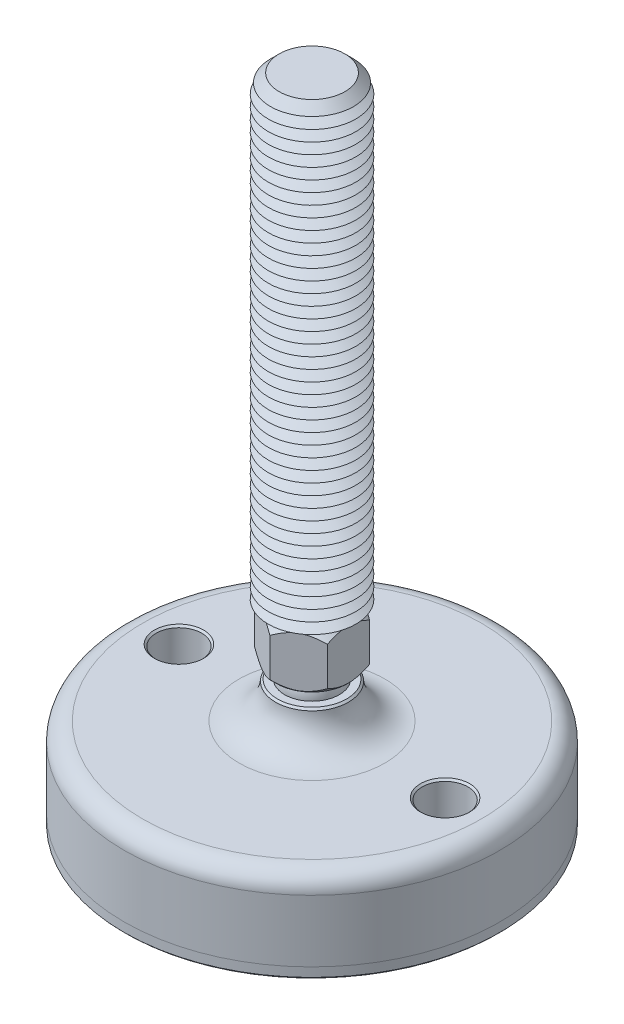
ISO-10303-21;
HEADER;
FILE_DESCRIPTION(('STEP AP214'),'2;1');
FILE_NAME('part.step','',(''),(''),'','','');
FILE_SCHEMA(('AUTOMOTIVE_DESIGN { 1 0 10303 214 1 1 1 1 }'));
ENDSEC;
DATA;
#1=APPLICATION_CONTEXT('core data for automotive mechanical design processes');
#2=APPLICATION_PROTOCOL_DEFINITION('international standard','automotive_design',2000,#1);
#3=PRODUCT_CONTEXT('',#1,'mechanical');
#4=PRODUCT('Part','Part','',(#3));
#5=PRODUCT_RELATED_PRODUCT_CATEGORY('part','',(#4));
#6=PRODUCT_DEFINITION_FORMATION('','',#4);
#7=PRODUCT_DEFINITION_CONTEXT('part definition',#1,'design');
#8=PRODUCT_DEFINITION('design','',#6,#7);
#9=PRODUCT_DEFINITION_SHAPE('','',#8);
#10=(LENGTH_UNIT() NAMED_UNIT(*) SI_UNIT(.MILLI.,.METRE.));
#11=(NAMED_UNIT(*) PLANE_ANGLE_UNIT() SI_UNIT($,.RADIAN.));
#12=(NAMED_UNIT(*) SI_UNIT($,.STERADIAN.) SOLID_ANGLE_UNIT());
#13=UNCERTAINTY_MEASURE_WITH_UNIT(LENGTH_MEASURE(1.E-05),#10,'distance_accuracy_value','');
#14=(GEOMETRIC_REPRESENTATION_CONTEXT(3) GLOBAL_UNCERTAINTY_ASSIGNED_CONTEXT((#13)) GLOBAL_UNIT_ASSIGNED_CONTEXT((#10,
#11,#12)) REPRESENTATION_CONTEXT('',''));
#15=CARTESIAN_POINT('',(0.,0.,0.));
#16=DIRECTION('',(0.,0.,1.));
#17=DIRECTION('',(1.,0.,0.));
#18=AXIS2_PLACEMENT_3D('',#15,#16,#17);
#19=CARTESIAN_POINT('',(0.,-32.,0.));
#20=DIRECTION('',(0.,1.,0.));
#21=DIRECTION('',(0.,0.,1.));
#22=AXIS2_PLACEMENT_3D('',#19,#20,#21);
#23=PLANE('',#22);
#24=CARTESIAN_POINT('',(-36.5,-32.,0.));
#25=DIRECTION('',(0.,1.,0.));
#26=DIRECTION('',(0.,0.,1.));
#27=AXIS2_PLACEMENT_3D('',#24,#25,#26);
#28=CIRCLE('',#27,6.25);
#29=CARTESIAN_POINT('',(-36.5,-32.,6.25));
#30=VERTEX_POINT('',#29);
#31=EDGE_CURVE('P0_E43',#30,#30,#28,.T.);
#32=ORIENTED_EDGE('',*,*,#31,.F.);
#33=EDGE_LOOP('',(#32));
#34=FACE_BOUND('',#33,.T.);
#35=CARTESIAN_POINT('',(36.5,-32.,0.));
#36=DIRECTION('',(0.,1.,0.));
#37=DIRECTION('',(0.,0.,1.));
#38=AXIS2_PLACEMENT_3D('',#35,#36,#37);
#39=CIRCLE('',#38,6.25);
#40=CARTESIAN_POINT('',(36.5,-32.,6.25));
#41=VERTEX_POINT('',#40);
#42=EDGE_CURVE('P0_E44',#41,#41,#39,.T.);
#43=ORIENTED_EDGE('',*,*,#42,.F.);
#44=EDGE_LOOP('',(#43));
#45=FACE_BOUND('',#44,.T.);
#46=CARTESIAN_POINT('',(0.,-32.,0.));
#47=DIRECTION('',(0.,1.,0.));
#48=DIRECTION('',(0.,0.,1.));
#49=AXIS2_PLACEMENT_3D('',#46,#47,#48);
#50=CIRCLE('',#49,51.5);
#51=CARTESIAN_POINT('',(0.,-32.,51.5));
#52=VERTEX_POINT('',#51);
#53=EDGE_CURVE('P0_E40',#52,#52,#50,.T.);
#54=ORIENTED_EDGE('',*,*,#53,.T.);
#55=EDGE_LOOP('',(#54));
#56=FACE_BOUND('',#55,.T.);
#57=ADVANCED_FACE('P0_F14',(#34,#45,#56),#23,.T.);
#58=CARTESIAN_POINT('',(0.,43.1654938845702,0.));
#59=DIRECTION('',(0.,1.,0.));
#60=DIRECTION('',(0.,0.,1.));
#61=AXIS2_PLACEMENT_3D('',#58,#59,#60);
#62=CYLINDRICAL_SURFACE('',#61,51.5);
#63=CARTESIAN_POINT('',(0.,-34.5,0.));
#64=DIRECTION('',(0.,-1.,0.));
#65=DIRECTION('',(0.,0.,-1.));
#66=AXIS2_PLACEMENT_3D('',#63,#64,#65);
#67=CIRCLE('',#66,51.5);
#68=CARTESIAN_POINT('',(0.,-34.5,-51.5));
#69=VERTEX_POINT('',#68);
#70=EDGE_CURVE('P0_E37',#69,#69,#67,.F.);
#71=ORIENTED_EDGE('',*,*,#70,.T.);
#72=EDGE_LOOP('',(#71));
#73=FACE_BOUND('',#72,.T.);
#74=ORIENTED_EDGE('',*,*,#53,.F.);
#75=EDGE_LOOP('',(#74));
#76=FACE_BOUND('',#75,.T.);
#77=ADVANCED_FACE('P0_F54',(#73,#76),#62,.T.);
#78=CARTESIAN_POINT('',(0.,-35.,51.5));
#79=DIRECTION('',(0.,-1.,0.));
#80=DIRECTION('',(0.,0.,-1.));
#81=AXIS2_PLACEMENT_3D('',#78,#79,#80);
#82=PLANE('',#81);
#83=CARTESIAN_POINT('',(36.5,-35.,0.));
#84=DIRECTION('',(0.,-1.,0.));
#85=DIRECTION('',(0.,0.,-1.));
#86=AXIS2_PLACEMENT_3D('',#83,#84,#85);
#87=CIRCLE('',#86,6.75000000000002);
#88=CARTESIAN_POINT('',(36.5,-35.,-6.75000000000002));
#89=VERTEX_POINT('',#88);
#90=EDGE_CURVE('P0_E25',#89,#89,#87,.F.);
#91=ORIENTED_EDGE('',*,*,#90,.T.);
#92=EDGE_LOOP('',(#91));
#93=FACE_BOUND('',#92,.T.);
#94=CARTESIAN_POINT('',(-36.5,-35.,0.));
#95=DIRECTION('',(0.,-1.,0.));
#96=DIRECTION('',(0.,0.,-1.));
#97=AXIS2_PLACEMENT_3D('',#94,#95,#96);
#98=CIRCLE('',#97,6.74999999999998);
#99=CARTESIAN_POINT('',(-36.5,-35.,-6.74999999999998));
#100=VERTEX_POINT('',#99);
#101=EDGE_CURVE('P0_E29',#100,#100,#98,.F.);
#102=ORIENTED_EDGE('',*,*,#101,.T.);
#103=EDGE_LOOP('',(#102));
#104=FACE_BOUND('',#103,.T.);
#105=CARTESIAN_POINT('',(0.,-35.,0.));
#106=DIRECTION('',(0.,-1.,0.));
#107=DIRECTION('',(0.,0.,-1.));
#108=AXIS2_PLACEMENT_3D('',#105,#106,#107);
#109=CIRCLE('',#108,51.);
#110=CARTESIAN_POINT('',(0.,-35.,-51.));
#111=VERTEX_POINT('',#110);
#112=EDGE_CURVE('P0_E34',#111,#111,#109,.T.);
#113=ORIENTED_EDGE('',*,*,#112,.T.);
#114=EDGE_LOOP('',(#113));
#115=FACE_BOUND('',#114,.T.);
#116=ADVANCED_FACE('P0_F61',(#93,#104,#115),#82,.T.);
#117=CARTESIAN_POINT('',(0.,-34.5,0.));
#118=DIRECTION('',(0.,1.,0.));
#119=DIRECTION('',(0.,0.,1.));
#120=AXIS2_PLACEMENT_3D('',#117,#118,#119);
#121=CONICAL_SURFACE('',#120,51.5,0.785398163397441);
#122=ORIENTED_EDGE('',*,*,#112,.F.);
#123=EDGE_LOOP('',(#122));
#124=FACE_BOUND('',#123,.T.);
#125=ORIENTED_EDGE('',*,*,#70,.F.);
#126=EDGE_LOOP('',(#125));
#127=FACE_BOUND('',#126,.T.);
#128=ADVANCED_FACE('P0_F68',(#124,#127),#121,.T.);
#129=CARTESIAN_POINT('',(36.5,-35.,0.));
#130=DIRECTION('',(0.,1.,0.));
#131=DIRECTION('',(0.,0.,1.));
#132=AXIS2_PLACEMENT_3D('',#129,#130,#131);
#133=CYLINDRICAL_SURFACE('',#132,6.25);
#134=CARTESIAN_POINT('',(36.5,-34.5,0.));
#135=DIRECTION('',(0.,-1.,0.));
#136=DIRECTION('',(0.,0.,-1.));
#137=AXIS2_PLACEMENT_3D('',#134,#135,#136);
#138=CIRCLE('',#137,6.25);
#139=CARTESIAN_POINT('',(36.5,-34.5,-6.25));
#140=VERTEX_POINT('',#139);
#141=EDGE_CURVE('P0_E21',#140,#140,#138,.T.);
#142=ORIENTED_EDGE('',*,*,#141,.T.);
#143=EDGE_LOOP('',(#142));
#144=FACE_BOUND('',#143,.T.);
#145=ORIENTED_EDGE('',*,*,#42,.T.);
#146=EDGE_LOOP('',(#145));
#147=FACE_BOUND('',#146,.T.);
#148=ADVANCED_FACE('P0_F74',(#144,#147),#133,.F.);
#149=CARTESIAN_POINT('',(-36.5,-35.,0.));
#150=DIRECTION('',(0.,1.,0.));
#151=DIRECTION('',(0.,0.,1.));
#152=AXIS2_PLACEMENT_3D('',#149,#150,#151);
#153=CYLINDRICAL_SURFACE('',#152,6.25);
#154=CARTESIAN_POINT('',(-36.5,-34.5,0.));
#155=DIRECTION('',(0.,-1.,0.));
#156=DIRECTION('',(0.,0.,-1.));
#157=AXIS2_PLACEMENT_3D('',#154,#155,#156);
#158=CIRCLE('',#157,6.25);
#159=CARTESIAN_POINT('',(-36.5,-34.5,-6.25));
#160=VERTEX_POINT('',#159);
#161=EDGE_CURVE('P0_E10',#160,#160,#158,.T.);
#162=ORIENTED_EDGE('',*,*,#161,.T.);
#163=EDGE_LOOP('',(#162));
#164=FACE_BOUND('',#163,.T.);
#165=ORIENTED_EDGE('',*,*,#31,.T.);
#166=EDGE_LOOP('',(#165));
#167=FACE_BOUND('',#166,.T.);
#168=ADVANCED_FACE('P0_F50',(#164,#167),#153,.F.);
#169=CARTESIAN_POINT('',(36.5,-35.,0.));
#170=DIRECTION('',(0.,-1.,0.));
#171=DIRECTION('',(0.,0.,-1.));
#172=AXIS2_PLACEMENT_3D('',#169,#170,#171);
#173=CONICAL_SURFACE('',#172,6.75000000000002,0.785398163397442);
#174=ORIENTED_EDGE('',*,*,#141,.F.);
#175=EDGE_LOOP('',(#174));
#176=FACE_BOUND('',#175,.T.);
#177=ORIENTED_EDGE('',*,*,#90,.F.);
#178=EDGE_LOOP('',(#177));
#179=FACE_BOUND('',#178,.T.);
#180=ADVANCED_FACE('P0_F76',(#176,#179),#173,.F.);
#181=CARTESIAN_POINT('',(-36.5,-35.,0.));
#182=DIRECTION('',(0.,-1.,0.));
#183=DIRECTION('',(0.,0.,-1.));
#184=AXIS2_PLACEMENT_3D('',#181,#182,#183);
#185=CONICAL_SURFACE('',#184,6.74999999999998,0.785398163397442);
#186=ORIENTED_EDGE('',*,*,#161,.F.);
#187=EDGE_LOOP('',(#186));
#188=FACE_BOUND('',#187,.T.);
#189=ORIENTED_EDGE('',*,*,#101,.F.);
#190=EDGE_LOOP('',(#189));
#191=FACE_BOUND('',#190,.T.);
#192=ADVANCED_FACE('P0_F16',(#188,#191),#185,.F.);
#193=CLOSED_SHELL('',(#57,#77,#116,#128,#148,#168,#180,#192));
#194=MANIFOLD_SOLID_BREP('P0_B1',#193);
#195=CARTESIAN_POINT('',(0.,3.75,0.));
#196=DIRECTION('',(0.,1.,0.));
#197=DIRECTION('',(0.,0.,1.));
#198=AXIS2_PLACEMENT_3D('',#195,#196,#197);
#199=PLANE('',#198);
#200=CARTESIAN_POINT('',(0.,3.75,0.));
#201=DIRECTION('',(0.,1.,0.));
#202=DIRECTION('',(0.,0.,1.));
#203=AXIS2_PLACEMENT_3D('',#200,#201,#202);
#204=CIRCLE('',#203,9.72829454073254);
#205=CARTESIAN_POINT('',(0.,3.75,9.72829454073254));
#206=VERTEX_POINT('',#205);
#207=EDGE_CURVE('P1_E213',#206,#206,#204,.T.);
#208=ORIENTED_EDGE('',*,*,#207,.F.);
#209=EDGE_LOOP('',(#208));
#210=FACE_BOUND('',#209,.T.);
#211=CARTESIAN_POINT('',(0.,3.75,0.));
#212=DIRECTION('',(0.,1.,0.));
#213=DIRECTION('',(0.,0.,1.));
#214=AXIS2_PLACEMENT_3D('',#211,#212,#213);
#215=CIRCLE('',#214,6.49519052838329);
#216=CARTESIAN_POINT('',(0.,3.75,6.49519052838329));
#217=VERTEX_POINT('',#216);
#218=EDGE_CURVE('P1_E25',#217,#217,#215,.F.);
#219=ORIENTED_EDGE('',*,*,#218,.F.);
#220=EDGE_LOOP('',(#219));
#221=FACE_BOUND('',#220,.T.);
#222=ADVANCED_FACE('P1_F16',(#210,#221),#199,.F.);
#223=CARTESIAN_POINT('',(0.,0.,0.));
#224=DIRECTION('',(0.,1.,0.));
#225=DIRECTION('',(0.,0.,-1.));
#226=AXIS2_PLACEMENT_3D('',#223,#224,#225);
#227=SPHERICAL_SURFACE('',#226,7.5);
#228=ORIENTED_EDGE('',*,*,#218,.T.);
#229=EDGE_LOOP('',(#228));
#230=FACE_BOUND('',#229,.T.);
#231=ADVANCED_FACE('P1_F203',(#230),#227,.T.);
#232=CARTESIAN_POINT('',(0.,3.75,0.));
#233=DIRECTION('',(0.,1.,0.));
#234=DIRECTION('',(0.,0.,1.));
#235=AXIS2_PLACEMENT_3D('',#232,#233,#234);
#236=CONICAL_SURFACE('',#235,9.72829454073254,0.785398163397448);
#237=ORIENTED_EDGE('',*,*,#207,.T.);
#238=EDGE_LOOP('',(#237));
#239=FACE_BOUND('',#238,.T.);
#240=CARTESIAN_POINT('',(-10.,9.59571642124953,-11.9394228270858));
#241=CARTESIAN_POINT('',(-10.,9.37430561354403,-11.6505452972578));
#242=CARTESIAN_POINT('',(-10.,9.15490936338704,-11.3600988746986));
#243=CARTESIAN_POINT('',(-10.,8.72106267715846,-10.7754314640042));
#244=CARTESIAN_POINT('',(-10.,8.50661343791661,-10.4812095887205));
#245=CARTESIAN_POINT('',(-10.,8.08205114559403,-9.88620330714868));
#246=CARTESIAN_POINT('',(-10.,7.87198437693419,-9.58538576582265));
#247=CARTESIAN_POINT('',(-10.,7.45926520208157,-8.97872312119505));
#248=CARTESIAN_POINT('',(-10.,7.25661228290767,-8.67287836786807));
#249=CARTESIAN_POINT('',(-10.,6.84809543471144,-8.03614350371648));
#250=CARTESIAN_POINT('',(-10.,6.64281401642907,-7.70487777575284));
#251=CARTESIAN_POINT('',(-10.,6.245142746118,-7.03457466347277));
#252=CARTESIAN_POINT('',(-10.,6.0527550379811,-6.69553599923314));
#253=CARTESIAN_POINT('',(-10.,5.68497951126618,-6.00961937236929));
#254=CARTESIAN_POINT('',(-10.,5.50954176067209,-5.66276839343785));
#255=CARTESIAN_POINT('',(-10.,5.17959635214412,-4.95932933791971));
#256=CARTESIAN_POINT('',(-10.,5.02507889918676,-4.60274591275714));
#257=CARTESIAN_POINT('',(-10.,4.75599518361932,-3.91353381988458));
#258=CARTESIAN_POINT('',(-10.,4.63902686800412,-3.58185263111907));
#259=CARTESIAN_POINT('',(-10.,4.43164927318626,-2.91013341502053));
#260=CARTESIAN_POINT('',(-10.,4.34124171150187,-2.57009484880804));
#261=CARTESIAN_POINT('',(-10.,4.19334931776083,-1.88955843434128));
#262=CARTESIAN_POINT('',(-10.,4.13527351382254,-1.54919119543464));
#263=CARTESIAN_POINT('',(-10.,4.05324021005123,-0.864347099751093));
#264=CARTESIAN_POINT('',(-10.,4.029275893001,-0.519871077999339));
#265=CARTESIAN_POINT('',(-10.,4.01745435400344,0.155191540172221));
#266=CARTESIAN_POINT('',(-10.,4.02812008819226,0.485752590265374));
#267=CARTESIAN_POINT('',(-10.,4.08160326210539,1.1442457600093));
#268=CARTESIAN_POINT('',(-10.,4.12442366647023,1.47217763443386));
#269=CARTESIAN_POINT('',(-10.,4.24054019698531,2.12859326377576));
#270=CARTESIAN_POINT('',(-10.,4.31437036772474,2.45698095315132));
#271=CARTESIAN_POINT('',(-10.,4.48844287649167,3.10654175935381));
#272=CARTESIAN_POINT('',(-10.,4.58868356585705,3.42771532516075));
#273=CARTESIAN_POINT('',(-10.,4.81839210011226,4.08271396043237));
#274=CARTESIAN_POINT('',(-10.,4.94932842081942,4.41601827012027));
#275=CARTESIAN_POINT('',(-10.,5.23140828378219,5.07403931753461));
#276=CARTESIAN_POINT('',(-10.,5.38256099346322,5.3987520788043));
#277=CARTESIAN_POINT('',(-10.,5.70148727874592,6.04113299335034));
#278=CARTESIAN_POINT('',(-10.,5.86931223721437,6.35877542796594));
#279=CARTESIAN_POINT('',(-10.,6.21788686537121,6.98677627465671));
#280=CARTESIAN_POINT('',(-10.,6.39863453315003,7.29713580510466));
#281=CARTESIAN_POINT('',(-10.,6.76133545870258,7.89633938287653));
#282=CARTESIAN_POINT('',(-10.,6.94278731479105,8.18548854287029));
#283=CARTESIAN_POINT('',(-10.,7.31339871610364,8.75881961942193));
#284=CARTESIAN_POINT('',(-10.,7.50255884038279,9.04300116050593));
#285=CARTESIAN_POINT('',(-10.,7.8856676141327,9.6047584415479));
#286=CARTESIAN_POINT('',(-10.,8.07956548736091,9.88236893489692));
#287=CARTESIAN_POINT('',(-10.,8.47254700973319,10.4337838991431));
#288=CARTESIAN_POINT('',(-10.,8.67162921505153,10.7075893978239));
#289=CARTESIAN_POINT('',(-10.,8.87283307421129,10.9797992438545));
#290=B_SPLINE_CURVE_WITH_KNOTS('',3,(#240,#241,#242,#243,#244,#245,#246,#247,#248,#249,#250,
#251,#252,#253,#254,#255,#256,#257,#258,#259,#260,#261,#262,#263,#264,#265,#266,#267,#268,#269,
#270,#271,#272,#273,#274,#275,#276,#277,#278,#279,#280,#281,#282,#283,#284,#285,#286,#287,#288,
#289),.UNSPECIFIED.,.F.,.F.,(4,2,2,2,2,2,2,2,2,2,2,2,2,2,2,2,2,2,2,2,2,2,2,2,4),(0.,
1.09192545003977,2.18411235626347,3.28473497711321,4.3852812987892,5.5541916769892,
6.72329593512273,7.88884387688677,9.05384420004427,10.1080362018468,11.1622963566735,
12.1965943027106,13.2306855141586,14.2212593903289,15.2119246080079,16.2203997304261,
17.2288119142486,18.3022883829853,19.3762532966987,20.4536373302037,21.5308548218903,
22.5548150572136,23.5788523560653,24.5946500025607,25.6101677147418),.UNSPECIFIED.);
#291=CARTESIAN_POINT('',(-10.,5.56871084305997,-5.77350269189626));
#292=VERTEX_POINT('',#291);
#293=CARTESIAN_POINT('',(-10.,5.56871084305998,5.77350269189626));
#294=VERTEX_POINT('',#293);
#295=EDGE_CURVE('P1_E187',#292,#294,#290,.T.);
#296=ORIENTED_EDGE('',*,*,#295,.F.);
#297=CARTESIAN_POINT('',(0.000199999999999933,5.56882631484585,-11.5471208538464));
#298=CARTESIAN_POINT('',(-0.171722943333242,5.4695807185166,-11.447861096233));
#299=CARTESIAN_POINT('',(-0.344992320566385,5.37336355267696,-11.3478239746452));
#300=CARTESIAN_POINT('',(-0.694433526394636,5.18794806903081,-11.1460740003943));
#301=CARTESIAN_POINT('',(-0.870606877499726,5.09875358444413,-11.0443602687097));
#302=CARTESIAN_POINT('',(-1.22689656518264,4.92796770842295,-10.8386563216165));
#303=CARTESIAN_POINT('',(-1.40702970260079,4.84642277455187,-10.7346564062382));
#304=CARTESIAN_POINT('',(-1.77025459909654,4.69270708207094,-10.52494841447));
#305=CARTESIAN_POINT('',(-1.95334590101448,4.62053489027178,-10.4192406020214));
#306=CARTESIAN_POINT('',(-2.31954331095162,4.4878482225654,-10.2078164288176));
#307=CARTESIAN_POINT('',(-2.50260441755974,4.42716910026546,-10.1021260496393));
#308=CARTESIAN_POINT('',(-2.87129282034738,4.31731511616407,-9.88926370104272));
#309=CARTESIAN_POINT('',(-3.05691983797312,4.26813901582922,-9.78209189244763));
#310=CARTESIAN_POINT('',(-3.42994608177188,4.1825291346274,-9.56672509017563));
#311=CARTESIAN_POINT('',(-3.61734032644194,4.14606667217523,-9.45853297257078));
#312=CARTESIAN_POINT('',(-3.99370204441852,4.08668528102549,-9.24124043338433));
#313=CARTESIAN_POINT('',(-4.1826692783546,4.06376432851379,-9.13214015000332));
#314=CARTESIAN_POINT('',(-4.64316633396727,4.0253323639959,-8.86627205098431));
#315=CARTESIAN_POINT('',(-4.91519388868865,4.01726744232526,-8.70921686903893));
#316=CARTESIAN_POINT('',(-5.45875701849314,4.03080424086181,-8.39539054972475));
#317=CARTESIAN_POINT('',(-5.7302923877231,4.05241636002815,-8.23861953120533));
#318=CARTESIAN_POINT('',(-6.27080349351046,4.12403157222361,-7.92655529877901));
#319=CARTESIAN_POINT('',(-6.53977602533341,4.17406641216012,-7.77126393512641));
#320=CARTESIAN_POINT('',(-7.07309796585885,4.29980733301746,-7.46335036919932));
#321=CARTESIAN_POINT('',(-7.33744772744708,4.3755114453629,-7.31072796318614));
#322=CARTESIAN_POINT('',(-7.80670351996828,4.53125365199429,-7.03980300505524));
#323=CARTESIAN_POINT('',(-8.01264886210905,4.60719488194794,-6.92090040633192));
#324=CARTESIAN_POINT('',(-8.42084280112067,4.77131434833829,-6.68522952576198));
#325=CARTESIAN_POINT('',(-8.62309128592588,4.85949295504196,-6.5684613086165));
#326=CARTESIAN_POINT('',(-9.02325448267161,5.04611070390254,-6.33742697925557));
#327=CARTESIAN_POINT('',(-9.22118057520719,5.1445175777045,-6.2231542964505));
#328=CARTESIAN_POINT('',(-9.61336795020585,5.35030005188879,-5.99672480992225));
#329=CARTESIAN_POINT('',(-9.80763139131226,5.45767015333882,-5.88456675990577));
#330=CARTESIAN_POINT('',(-10.0002,5.56882631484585,-5.77338722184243));
#331=B_SPLINE_CURVE_WITH_KNOTS('',3,(#297,#298,#299,#300,#301,#302,#303,#304,#305,#306,#307,
#308,#309,#310,#311,#312,#313,#314,#315,#316,#317,#318,#319,#320,#321,#322,#323,#324,#325,#326,
#327,#328,#329,#330),.UNSPECIFIED.,.F.,.F.,(4,2,2,2,2,2,2,2,2,2,2,2,2,2,2,2,4),(0.,
0.665863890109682,1.33208874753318,2.00212824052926,2.67206515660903,3.33152613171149,
3.99091606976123,4.64880867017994,5.30660292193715,6.24777541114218,7.18927777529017,
8.13183382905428,9.07431761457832,9.82287578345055,10.5714566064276,11.3177436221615,
12.0635761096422),.UNSPECIFIED.);
#332=CARTESIAN_POINT('',(0.,5.56871084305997,-11.5470053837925));
#333=VERTEX_POINT('',#332);
#334=EDGE_CURVE('P1_E181',#333,#292,#331,.T.);
#335=ORIENTED_EDGE('',*,*,#334,.F.);
#336=CARTESIAN_POINT('',(10.0002,5.56882631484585,-5.77338722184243));
#337=CARTESIAN_POINT('',(9.82827705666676,5.4695807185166,-5.87264697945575));
#338=CARTESIAN_POINT('',(9.65500767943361,5.37336355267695,-5.97268410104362));
#339=CARTESIAN_POINT('',(9.30556647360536,5.18794806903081,-6.17443407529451));
#340=CARTESIAN_POINT('',(9.12939312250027,5.09875358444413,-6.27614780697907));
#341=CARTESIAN_POINT('',(8.77310343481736,4.92796770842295,-6.48185175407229));
#342=CARTESIAN_POINT('',(8.59297029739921,4.84642277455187,-6.58585166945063));
#343=CARTESIAN_POINT('',(8.22974540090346,4.69270708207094,-6.79555966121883));
#344=CARTESIAN_POINT('',(8.04665409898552,4.62053489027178,-6.90126747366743));
#345=CARTESIAN_POINT('',(7.68045668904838,4.4878482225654,-7.11269164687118));
#346=CARTESIAN_POINT('',(7.49739558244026,4.42716910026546,-7.21838202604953));
#347=CARTESIAN_POINT('',(7.12870717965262,4.31731511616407,-7.43124437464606));
#348=CARTESIAN_POINT('',(6.94308016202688,4.26813901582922,-7.53841618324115));
#349=CARTESIAN_POINT('',(6.57005391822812,4.1825291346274,-7.75378298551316));
#350=CARTESIAN_POINT('',(6.38265967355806,4.14606667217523,-7.861975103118));
#351=CARTESIAN_POINT('',(6.00629795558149,4.08668528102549,-8.07926764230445));
#352=CARTESIAN_POINT('',(5.81733072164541,4.06376432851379,-8.18836792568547));
#353=CARTESIAN_POINT('',(5.35683366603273,4.0253323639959,-8.45423602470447));
#354=CARTESIAN_POINT('',(5.08480611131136,4.01726744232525,-8.61129120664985));
#355=CARTESIAN_POINT('',(4.54124298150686,4.03080424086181,-8.92511752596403));
#356=CARTESIAN_POINT('',(4.2697076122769,4.05241636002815,-9.08188854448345));
#357=CARTESIAN_POINT('',(3.72919650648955,4.12403157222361,-9.39395277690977));
#358=CARTESIAN_POINT('',(3.46022397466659,4.17406641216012,-9.54924414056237));
#359=CARTESIAN_POINT('',(2.92690203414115,4.29980733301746,-9.85715770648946));
#360=CARTESIAN_POINT('',(2.66255227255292,4.37551144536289,-10.0097801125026));
#361=CARTESIAN_POINT('',(2.19329648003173,4.53125365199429,-10.2807050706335));
#362=CARTESIAN_POINT('',(1.98735113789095,4.60719488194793,-10.3996076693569));
#363=CARTESIAN_POINT('',(1.57915719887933,4.77131434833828,-10.6352785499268));
#364=CARTESIAN_POINT('',(1.37690871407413,4.85949295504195,-10.7520467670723));
#365=CARTESIAN_POINT('',(0.976745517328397,5.04611070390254,-10.9830810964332));
#366=CARTESIAN_POINT('',(0.77881942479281,5.1445175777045,-11.0973537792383));
#367=CARTESIAN_POINT('',(0.386632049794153,5.35030005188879,-11.3237832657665));
#368=CARTESIAN_POINT('',(0.192368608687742,5.45767015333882,-11.435941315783));
#369=CARTESIAN_POINT('',(-0.000199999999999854,5.56882631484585,-11.5471208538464));
#370=B_SPLINE_CURVE_WITH_KNOTS('',3,(#336,#337,#338,#339,#340,#341,#342,#343,#344,#345,#346,
#347,#348,#349,#350,#351,#352,#353,#354,#355,#356,#357,#358,#359,#360,#361,#362,#363,#364,#365,
#366,#367,#368,#369),.UNSPECIFIED.,.F.,.F.,(4,2,2,2,2,2,2,2,2,2,2,2,2,2,2,2,4),(0.,
0.665863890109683,1.33208874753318,2.00212824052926,2.67206515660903,3.33152613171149,
3.99091606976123,4.64880867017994,5.30660292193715,6.24777541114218,7.18927777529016,
8.13183382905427,9.07431761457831,9.82287578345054,10.5714566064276,11.3177436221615,
12.0635761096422),.UNSPECIFIED.);
#371=CARTESIAN_POINT('',(9.99999999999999,5.56871084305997,-5.77350269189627));
#372=VERTEX_POINT('',#371);
#373=EDGE_CURVE('P1_E169',#372,#333,#370,.T.);
#374=ORIENTED_EDGE('',*,*,#373,.F.);
#375=CARTESIAN_POINT('',(10.,9.59571642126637,-11.9394228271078));
#376=CARTESIAN_POINT('',(10.,9.37430561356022,-11.6505452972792));
#377=CARTESIAN_POINT('',(10.,9.15490936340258,-11.3600988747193));
#378=CARTESIAN_POINT('',(10.,8.7210626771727,-10.7754314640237));
#379=CARTESIAN_POINT('',(10.,8.5066134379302,-10.4812095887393));
#380=CARTESIAN_POINT('',(10.,8.08205114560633,-9.88620330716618));
#381=CARTESIAN_POINT('',(10.,7.87198437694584,-9.58538576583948));
#382=CARTESIAN_POINT('',(10.,7.45926520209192,-8.97872312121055));
#383=CARTESIAN_POINT('',(10.,7.25661228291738,-8.67287836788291));
#384=CARTESIAN_POINT('',(10.,6.84809543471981,-8.03614350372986));
#385=CARTESIAN_POINT('',(10.,6.64281401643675,-7.70487777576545));
#386=CARTESIAN_POINT('',(10.,6.24514274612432,-7.03457466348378));
#387=CARTESIAN_POINT('',(10.,6.05275503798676,-6.69553599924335));
#388=CARTESIAN_POINT('',(10.,5.68497951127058,-6.00961937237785));
#389=CARTESIAN_POINT('',(10.,5.50954176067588,-5.66276839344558));
#390=CARTESIAN_POINT('',(10.,5.17959635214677,-4.95932933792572));
#391=CARTESIAN_POINT('',(10.,5.02507889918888,-4.60274591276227));
#392=CARTESIAN_POINT('',(10.,4.75599518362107,-3.91353381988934));
#393=CARTESIAN_POINT('',(10.,4.63902686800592,-3.58185263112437));
#394=CARTESIAN_POINT('',(10.,4.43164927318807,-2.91013341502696));
#395=CARTESIAN_POINT('',(10.,4.34124171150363,-2.57009484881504));
#396=CARTESIAN_POINT('',(10.,4.19334931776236,-1.8895584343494));
#397=CARTESIAN_POINT('',(10.,4.13527351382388,-1.54919119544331));
#398=CARTESIAN_POINT('',(10.,4.05324021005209,-0.86434709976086));
#399=CARTESIAN_POINT('',(10.,4.02927589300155,-0.519871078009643));
#400=CARTESIAN_POINT('',(10.,4.01745435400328,0.155191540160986));
#401=CARTESIAN_POINT('',(10.,4.0281200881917,0.485752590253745));
#402=CARTESIAN_POINT('',(10.,4.08160326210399,1.14424575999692));
#403=CARTESIAN_POINT('',(10.,4.12442366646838,1.47217763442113));
#404=CARTESIAN_POINT('',(10.,4.24054019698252,2.12859326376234));
#405=CARTESIAN_POINT('',(10.,4.31437036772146,2.45698095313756));
#406=CARTESIAN_POINT('',(10.,4.48844287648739,3.1065417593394));
#407=CARTESIAN_POINT('',(10.,4.58868356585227,3.42771532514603));
#408=CARTESIAN_POINT('',(10.,4.81839210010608,4.08271396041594));
#409=CARTESIAN_POINT('',(10.,4.94932842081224,4.41601827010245));
#410=CARTESIAN_POINT('',(10.,5.23140828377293,5.0740393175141));
#411=CARTESIAN_POINT('',(10.,5.38256099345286,5.39875207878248));
#412=CARTESIAN_POINT('',(10.,5.70148727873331,6.04113299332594));
#413=CARTESIAN_POINT('',(10.,5.86931223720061,6.35877542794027));
#414=CARTESIAN_POINT('',(10.,6.21788686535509,6.98677627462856));
#415=CARTESIAN_POINT('',(10.,6.39863453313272,7.29713580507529));
#416=CARTESIAN_POINT('',(10.,6.761335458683,7.89633938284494));
#417=CARTESIAN_POINT('',(10.,6.9427873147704,8.18548854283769));
#418=CARTESIAN_POINT('',(10.,7.31339871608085,8.75881961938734));
#419=CARTESIAN_POINT('',(10.,7.50255884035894,9.04300116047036));
#420=CARTESIAN_POINT('',(10.,7.88566761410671,9.60475844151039));
#421=CARTESIAN_POINT('',(10.,8.07956548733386,9.88236893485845));
#422=CARTESIAN_POINT('',(10.,8.47254700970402,10.4337838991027));
#423=CARTESIAN_POINT('',(10.,8.6716292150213,10.7075893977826));
#424=CARTESIAN_POINT('',(10.,8.87283307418,10.9797992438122));
#425=B_SPLINE_CURVE_WITH_KNOTS('',3,(#375,#376,#377,#378,#379,#380,#381,#382,#383,#384,#385,
#386,#387,#388,#389,#390,#391,#392,#393,#394,#395,#396,#397,#398,#399,#400,#401,#402,#403,#404,
#405,#406,#407,#408,#409,#410,#411,#412,#413,#414,#415,#416,#417,#418,#419,#420,#421,#422,#423,
#424),.UNSPECIFIED.,.F.,.F.,(4,2,2,2,2,2,2,2,2,2,2,2,2,2,2,2,2,2,2,2,2,2,2,2,4),(0.,
1.09192545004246,2.18411235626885,3.28473497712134,4.38528129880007,5.55419167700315,
6.72329593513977,7.88884387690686,9.05384420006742,10.1080362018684,11.1622963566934,
12.196594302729,13.2306855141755,14.2212593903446,15.2119246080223,16.2203997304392,
17.2288119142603,18.3022883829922,19.3762532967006,20.4536373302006,21.5308548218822,
22.5548150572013,23.5788523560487,24.5946500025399,25.6101677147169),.UNSPECIFIED.);
#426=CARTESIAN_POINT('',(10.,5.56871084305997,5.77350269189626));
#427=VERTEX_POINT('',#426);
#428=EDGE_CURVE('P1_E71',#427,#372,#425,.F.);
#429=ORIENTED_EDGE('',*,*,#428,.F.);
#430=CARTESIAN_POINT('',(-0.000200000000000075,5.56882631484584,11.5471208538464));
#431=CARTESIAN_POINT('',(0.171722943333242,5.4695807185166,11.447861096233));
#432=CARTESIAN_POINT('',(0.344992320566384,5.37336355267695,11.3478239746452));
#433=CARTESIAN_POINT('',(0.694433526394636,5.18794806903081,11.1460740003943));
#434=CARTESIAN_POINT('',(0.870606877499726,5.09875358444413,11.0443602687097));
#435=CARTESIAN_POINT('',(1.22689656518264,4.92796770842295,10.8386563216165));
#436=CARTESIAN_POINT('',(1.40702970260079,4.84642277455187,10.7346564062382));
#437=CARTESIAN_POINT('',(1.77025459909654,4.69270708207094,10.52494841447));
#438=CARTESIAN_POINT('',(1.95334590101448,4.62053489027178,10.4192406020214));
#439=CARTESIAN_POINT('',(2.31954331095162,4.4878482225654,10.2078164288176));
#440=CARTESIAN_POINT('',(2.50260441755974,4.42716910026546,10.1021260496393));
#441=CARTESIAN_POINT('',(2.87129282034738,4.31731511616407,9.88926370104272));
#442=CARTESIAN_POINT('',(3.05691983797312,4.26813901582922,9.78209189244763));
#443=CARTESIAN_POINT('',(3.42994608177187,4.18252913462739,9.56672509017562));
#444=CARTESIAN_POINT('',(3.61734032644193,4.14606667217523,9.45853297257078));
#445=CARTESIAN_POINT('',(3.99370204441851,4.08668528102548,9.24124043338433));
#446=CARTESIAN_POINT('',(4.18266927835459,4.06376432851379,9.13214015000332));
#447=CARTESIAN_POINT('',(4.64316633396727,4.0253323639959,8.86627205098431));
#448=CARTESIAN_POINT('',(4.91519388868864,4.01726744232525,8.70921686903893));
#449=CARTESIAN_POINT('',(5.45875701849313,4.03080424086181,8.39539054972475));
#450=CARTESIAN_POINT('',(5.7302923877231,4.05241636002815,8.23861953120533));
#451=CARTESIAN_POINT('',(6.27080349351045,4.1240315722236,7.92655529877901));
#452=CARTESIAN_POINT('',(6.53977602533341,4.17406641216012,7.77126393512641));
#453=CARTESIAN_POINT('',(7.07309796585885,4.29980733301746,7.46335036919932));
#454=CARTESIAN_POINT('',(7.33744772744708,4.37551144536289,7.31072796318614));
#455=CARTESIAN_POINT('',(7.80670351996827,4.53125365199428,7.03980300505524));
#456=CARTESIAN_POINT('',(8.01264886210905,4.60719488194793,6.92090040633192));
#457=CARTESIAN_POINT('',(8.42084280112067,4.77131434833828,6.68522952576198));
#458=CARTESIAN_POINT('',(8.62309128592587,4.85949295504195,6.5684613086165));
#459=CARTESIAN_POINT('',(9.0232544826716,5.04611070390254,6.33742697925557));
#460=CARTESIAN_POINT('',(9.22118057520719,5.1445175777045,6.2231542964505));
#461=CARTESIAN_POINT('',(9.61336795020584,5.35030005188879,5.99672480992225));
#462=CARTESIAN_POINT('',(9.80763139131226,5.45767015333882,5.88456675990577));
#463=CARTESIAN_POINT('',(10.0002,5.56882631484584,5.77338722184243));
#464=B_SPLINE_CURVE_WITH_KNOTS('',3,(#430,#431,#432,#433,#434,#435,#436,#437,#438,#439,#440,
#441,#442,#443,#444,#445,#446,#447,#448,#449,#450,#451,#452,#453,#454,#455,#456,#457,#458,#459,
#460,#461,#462,#463),.UNSPECIFIED.,.F.,.F.,(4,2,2,2,2,2,2,2,2,2,2,2,2,2,2,2,4),(0.,
0.665863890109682,1.33208874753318,2.00212824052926,2.67206515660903,3.33152613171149,
3.99091606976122,4.64880867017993,5.30660292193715,6.24777541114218,7.18927777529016,
8.13183382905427,9.07431761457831,9.82287578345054,10.5714566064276,11.3177436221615,
12.0635761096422),.UNSPECIFIED.);
#465=CARTESIAN_POINT('',(0.,5.56871084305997,11.5470053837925));
#466=VERTEX_POINT('',#465);
#467=EDGE_CURVE('P1_E68',#466,#427,#464,.T.);
#468=ORIENTED_EDGE('',*,*,#467,.F.);
#469=CARTESIAN_POINT('',(-10.0002,5.56882631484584,5.77338722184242));
#470=CARTESIAN_POINT('',(-9.82827705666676,5.4695807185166,5.87264697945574));
#471=CARTESIAN_POINT('',(-9.65500767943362,5.37336355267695,5.97268410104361));
#472=CARTESIAN_POINT('',(-9.30556647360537,5.18794806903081,6.1744340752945));
#473=CARTESIAN_POINT('',(-9.12939312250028,5.09875358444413,6.27614780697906));
#474=CARTESIAN_POINT('',(-8.77310343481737,4.92796770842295,6.48185175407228));
#475=CARTESIAN_POINT('',(-8.59297029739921,4.84642277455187,6.58585166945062));
#476=CARTESIAN_POINT('',(-8.22974540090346,4.69270708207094,6.79555966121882));
#477=CARTESIAN_POINT('',(-8.04665409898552,4.62053489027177,6.90126747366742));
#478=CARTESIAN_POINT('',(-7.68045668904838,4.48784822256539,7.11269164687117));
#479=CARTESIAN_POINT('',(-7.49739558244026,4.42716910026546,7.21838202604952));
#480=CARTESIAN_POINT('',(-7.12870717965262,4.31731511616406,7.43124437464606));
#481=CARTESIAN_POINT('',(-6.94308016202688,4.26813901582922,7.53841618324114));
#482=CARTESIAN_POINT('',(-6.57005391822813,4.18252913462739,7.75378298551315));
#483=CARTESIAN_POINT('',(-6.38265967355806,4.14606667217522,7.861975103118));
#484=CARTESIAN_POINT('',(-6.00629795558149,4.08668528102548,8.07926764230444));
#485=CARTESIAN_POINT('',(-5.81733072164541,4.06376432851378,8.18836792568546));
#486=CARTESIAN_POINT('',(-5.35683366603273,4.0253323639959,8.45423602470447));
#487=CARTESIAN_POINT('',(-5.08480611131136,4.01726744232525,8.61129120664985));
#488=CARTESIAN_POINT('',(-4.54124298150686,4.0308042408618,8.92511752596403));
#489=CARTESIAN_POINT('',(-4.2697076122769,4.05241636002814,9.08188854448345));
#490=CARTESIAN_POINT('',(-3.72919650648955,4.1240315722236,9.39395277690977));
#491=CARTESIAN_POINT('',(-3.46022397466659,4.17406641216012,9.54924414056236));
#492=CARTESIAN_POINT('',(-2.92690203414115,4.29980733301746,9.85715770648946));
#493=CARTESIAN_POINT('',(-2.66255227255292,4.37551144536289,10.0097801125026));
#494=CARTESIAN_POINT('',(-2.19329648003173,4.53125365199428,10.2807050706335));
#495=CARTESIAN_POINT('',(-1.98735113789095,4.60719488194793,10.3996076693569));
#496=CARTESIAN_POINT('',(-1.57915719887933,4.77131434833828,10.6352785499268));
#497=CARTESIAN_POINT('',(-1.37690871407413,4.85949295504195,10.7520467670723));
#498=CARTESIAN_POINT('',(-0.976745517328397,5.04611070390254,10.9830810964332));
#499=CARTESIAN_POINT('',(-0.778819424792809,5.1445175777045,11.0973537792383));
#500=CARTESIAN_POINT('',(-0.386632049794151,5.35030005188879,11.3237832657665));
#501=CARTESIAN_POINT('',(-0.192368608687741,5.45767015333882,11.435941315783));
#502=CARTESIAN_POINT('',(0.000199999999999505,5.56882631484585,11.5471208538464));
#503=B_SPLINE_CURVE_WITH_KNOTS('',3,(#469,#470,#471,#472,#473,#474,#475,#476,#477,#478,#479,
#480,#481,#482,#483,#484,#485,#486,#487,#488,#489,#490,#491,#492,#493,#494,#495,#496,#497,#498,
#499,#500,#501,#502),.UNSPECIFIED.,.F.,.F.,(4,2,2,2,2,2,2,2,2,2,2,2,2,2,2,2,4),(0.,
0.665863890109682,1.33208874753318,2.00212824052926,2.67206515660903,3.33152613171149,
3.99091606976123,4.64880867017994,5.30660292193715,6.24777541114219,7.18927777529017,
8.13183382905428,9.07431761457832,9.82287578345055,10.5714566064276,11.3177436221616,
12.0635761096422),.UNSPECIFIED.);
#504=EDGE_CURVE('P1_E40',#294,#466,#503,.T.);
#505=ORIENTED_EDGE('',*,*,#504,.F.);
#506=EDGE_LOOP('',(#296,#335,#374,#429,#468,#505));
#507=FACE_BOUND('',#506,.T.);
#508=ADVANCED_FACE('P1_F69',(#239,#507),#236,.T.);
#509=CARTESIAN_POINT('',(-10.,19.,-5.77350269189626));
#510=DIRECTION('',(1.,0.,0.));
#511=DIRECTION('',(0.,0.,-1.));
#512=AXIS2_PLACEMENT_3D('',#509,#510,#511);
#513=PLANE('',#512);
#514=DIRECTION('',(0.,-1.,0.));
#515=VECTOR('',#514,1.);
#516=CARTESIAN_POINT('',(-10.,19.,5.77350269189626));
#517=LINE('',#516,#515);
#518=CARTESIAN_POINT('',(-10.,16.1132486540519,5.77350269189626));
#519=VERTEX_POINT('',#518);
#520=EDGE_CURVE('P1_E84',#519,#294,#517,.T.);
#521=ORIENTED_EDGE('',*,*,#520,.F.);
#522=CARTESIAN_POINT('',(-10.,12.4093918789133,-11.5147208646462));
#523=CARTESIAN_POINT('',(-10.,12.6210295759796,-11.2343500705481));
#524=CARTESIAN_POINT('',(-10.,12.8306215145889,-10.9524094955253));
#525=CARTESIAN_POINT('',(-10.,13.2447979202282,-10.3847695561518));
#526=CARTESIAN_POINT('',(-10.,13.4493811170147,-10.0990692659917));
#527=CARTESIAN_POINT('',(-10.,13.8540786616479,-9.52120077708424));
#528=CARTESIAN_POINT('',(-10.,14.0541461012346,-9.22899961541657));
#529=CARTESIAN_POINT('',(-10.,14.4468132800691,-8.63963749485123));
#530=CARTESIAN_POINT('',(-10.,14.6394135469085,-8.34247688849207));
#531=CARTESIAN_POINT('',(-10.,15.0262335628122,-7.72525702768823));
#532=CARTESIAN_POINT('',(-10.,15.2199166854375,-7.40485974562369));
#533=CARTESIAN_POINT('',(-10.,15.5945399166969,-6.75658646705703));
#534=CARTESIAN_POINT('',(-10.,15.7754780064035,-6.4287092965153));
#535=CARTESIAN_POINT('',(-10.,16.1207071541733,-5.76550673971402));
#536=CARTESIAN_POINT('',(-10.,16.285047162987,-5.43020703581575));
#537=CARTESIAN_POINT('',(-10.,16.5934011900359,-4.75046311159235));
#538=CARTESIAN_POINT('',(-10.,16.7374244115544,-4.40602311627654));
#539=CARTESIAN_POINT('',(-10.,16.9894496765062,-3.73558113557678));
#540=CARTESIAN_POINT('',(-10.,17.0994177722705,-3.41032595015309));
#541=CARTESIAN_POINT('',(-10.,17.2932601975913,-2.75198473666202));
#542=CARTESIAN_POINT('',(-10.,17.377132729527,-2.4188981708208));
#543=CARTESIAN_POINT('',(-10.,17.5130086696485,-1.7524231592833));
#544=CARTESIAN_POINT('',(-10.,17.565558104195,-1.41914787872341));
#545=CARTESIAN_POINT('',(-10.,17.6377678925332,-0.749034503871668));
#546=CARTESIAN_POINT('',(-10.,17.6574338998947,-0.412197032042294));
#547=CARTESIAN_POINT('',(-10.,17.6624162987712,0.249527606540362));
#548=CARTESIAN_POINT('',(-10.,17.6489502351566,0.574406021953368));
#549=CARTESIAN_POINT('',(-10.,17.5910984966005,1.22138001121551));
#550=CARTESIAN_POINT('',(-10.,17.5467098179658,1.54347531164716));
#551=CARTESIAN_POINT('',(-10.,17.4286795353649,2.18799750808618));
#552=CARTESIAN_POINT('',(-10.,17.3545401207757,2.51033177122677));
#553=CARTESIAN_POINT('',(-10.,17.180962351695,3.14797698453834));
#554=CARTESIAN_POINT('',(-10.,17.0815261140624,3.46328851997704));
#555=CARTESIAN_POINT('',(-10.,16.8512186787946,4.11544298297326));
#556=CARTESIAN_POINT('',(-10.,16.7182795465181,4.45154819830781));
#557=CARTESIAN_POINT('',(-10.,16.431992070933,5.115028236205));
#558=CARTESIAN_POINT('',(-10.,16.2786342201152,5.4423989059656));
#559=CARTESIAN_POINT('',(-10.,15.9551580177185,6.09000973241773));
#560=CARTESIAN_POINT('',(-10.,15.7849870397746,6.41022338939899));
#561=CARTESIAN_POINT('',(-10.,15.4316458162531,7.04328175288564));
#562=CARTESIAN_POINT('',(-10.,15.2484776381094,7.35612762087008));
#563=CARTESIAN_POINT('',(-10.,14.8810750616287,7.96002022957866));
#564=CARTESIAN_POINT('',(-10.,14.6973474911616,8.25137695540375));
#565=CARTESIAN_POINT('',(-10.,14.3221662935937,8.82908851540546));
#566=CARTESIAN_POINT('',(-10.,14.1307120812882,9.1154429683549));
#567=CARTESIAN_POINT('',(-10.,13.7430400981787,9.68148259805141));
#568=CARTESIAN_POINT('',(-10.,13.5468736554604,9.96120305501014));
#569=CARTESIAN_POINT('',(-10.,13.149353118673,10.5168212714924));
#570=CARTESIAN_POINT('',(-10.,12.9480004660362,10.7927200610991));
#571=CARTESIAN_POINT('',(-10.,12.7445274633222,11.0670185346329));
#572=B_SPLINE_CURVE_WITH_KNOTS('',3,(#522,#523,#524,#525,#526,#527,#528,#529,#530,#531,#532,
#533,#534,#535,#536,#537,#538,#539,#540,#541,#542,#543,#544,#545,#546,#547,#548,#549,#550,#551,
#552,#553,#554,#555,#556,#557,#558,#559,#560,#561,#562,#563,#564,#565,#566,#567,#568,#569,#570,
#571),.UNSPECIFIED.,.F.,.F.,(4,2,2,2,2,2,2,2,2,2,2,2,2,2,2,2,2,2,2,2,2,2,2,2,4),(0.,
1.05386365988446,2.10799187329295,3.17028777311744,4.23250847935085,5.35544154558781,
6.47855209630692,7.5982472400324,8.71743353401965,9.74655549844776,10.7757483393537,
11.7864315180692,12.7969409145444,13.7708741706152,14.7449020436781,15.7359570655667,
16.7269291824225,17.8104078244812,18.8943927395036,19.981885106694,21.0692048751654,
22.1024062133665,23.1356859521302,24.1605722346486,25.1851766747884),.UNSPECIFIED.);
#573=CARTESIAN_POINT('',(-10.,16.1132486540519,-5.77350269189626));
#574=VERTEX_POINT('',#573);
#575=EDGE_CURVE('P1_E85',#519,#574,#572,.F.);
#576=ORIENTED_EDGE('',*,*,#575,.T.);
#577=DIRECTION('',(0.,-1.,0.));
#578=VECTOR('',#577,1.);
#579=CARTESIAN_POINT('',(-10.,19.,-5.77350269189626));
#580=LINE('',#579,#578);
#581=EDGE_CURVE('P1_E102',#574,#292,#580,.T.);
#582=ORIENTED_EDGE('',*,*,#581,.T.);
#583=ORIENTED_EDGE('',*,*,#295,.T.);
#584=EDGE_LOOP('',(#521,#576,#582,#583));
#585=FACE_BOUND('',#584,.T.);
#586=ADVANCED_FACE('P1_F195',(#585),#513,.F.);
#587=CARTESIAN_POINT('',(0.,19.,-11.5470053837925));
#588=DIRECTION('',(0.5,0.,0.866025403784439));
#589=DIRECTION('',(0.866025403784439,0.,-0.5));
#590=AXIS2_PLACEMENT_3D('',#587,#588,#589);
#591=PLANE('',#590);
#592=ORIENTED_EDGE('',*,*,#581,.F.);
#593=CARTESIAN_POINT('',(-10.0002,16.113133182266,-5.77338722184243));
#594=CARTESIAN_POINT('',(-9.82827705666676,16.2123787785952,-5.87264697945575));
#595=CARTESIAN_POINT('',(-9.65500767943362,16.3085959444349,-5.97268410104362));
#596=CARTESIAN_POINT('',(-9.30556647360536,16.494011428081,-6.17443407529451));
#597=CARTESIAN_POINT('',(-9.12939312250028,16.5832059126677,-6.27614780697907));
#598=CARTESIAN_POINT('',(-8.77310343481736,16.7539917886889,-6.48185175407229));
#599=CARTESIAN_POINT('',(-8.59297029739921,16.83553672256,-6.58585166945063));
#600=CARTESIAN_POINT('',(-8.22974540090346,16.9892524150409,-6.79555966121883));
#601=CARTESIAN_POINT('',(-8.04665409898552,17.0614246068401,-6.90126747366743));
#602=CARTESIAN_POINT('',(-7.68045668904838,17.1941112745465,-7.11269164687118));
#603=CARTESIAN_POINT('',(-7.49739558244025,17.2547903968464,-7.21838202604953));
#604=CARTESIAN_POINT('',(-7.12870717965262,17.3646443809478,-7.43124437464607));
#605=CARTESIAN_POINT('',(-6.94308016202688,17.4138204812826,-7.53841618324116));
#606=CARTESIAN_POINT('',(-6.57005391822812,17.4994303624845,-7.75378298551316));
#607=CARTESIAN_POINT('',(-6.38265967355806,17.5358928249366,-7.86197510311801));
#608=CARTESIAN_POINT('',(-6.00629795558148,17.5952742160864,-8.07926764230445));
#609=CARTESIAN_POINT('',(-5.8173307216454,17.6181951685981,-8.18836792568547));
#610=CARTESIAN_POINT('',(-5.35683366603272,17.6566271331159,-8.45423602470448));
#611=CARTESIAN_POINT('',(-5.08480611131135,17.6646920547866,-8.61129120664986));
#612=CARTESIAN_POINT('',(-4.54124298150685,17.65115525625,-8.92511752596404));
#613=CARTESIAN_POINT('',(-4.26970761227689,17.6295431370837,-9.08188854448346));
#614=CARTESIAN_POINT('',(-3.72919650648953,17.5579279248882,-9.39395277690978));
#615=CARTESIAN_POINT('',(-3.46022397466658,17.5078930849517,-9.54924414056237));
#616=CARTESIAN_POINT('',(-2.92690203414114,17.3821521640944,-9.85715770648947));
#617=CARTESIAN_POINT('',(-2.66255227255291,17.3064480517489,-10.0097801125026));
#618=CARTESIAN_POINT('',(-2.19329648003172,17.1507058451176,-10.2807050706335));
#619=CARTESIAN_POINT('',(-1.98735113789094,17.0747646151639,-10.3996076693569));
#620=CARTESIAN_POINT('',(-1.57915719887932,16.9106451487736,-10.6352785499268));
#621=CARTESIAN_POINT('',(-1.37690871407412,16.8224665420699,-10.7520467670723));
#622=CARTESIAN_POINT('',(-0.976745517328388,16.6358487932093,-10.9830810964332));
#623=CARTESIAN_POINT('',(-0.778819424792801,16.5374419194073,-11.0973537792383));
#624=CARTESIAN_POINT('',(-0.386632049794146,16.3316594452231,-11.3237832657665));
#625=CARTESIAN_POINT('',(-0.192368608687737,16.224289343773,-11.435941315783));
#626=CARTESIAN_POINT('',(0.000200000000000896,16.113133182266,-11.5471208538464));
#627=B_SPLINE_CURVE_WITH_KNOTS('',3,(#593,#594,#595,#596,#597,#598,#599,#600,#601,#602,#603,
#604,#605,#606,#607,#608,#609,#610,#611,#612,#613,#614,#615,#616,#617,#618,#619,#620,#621,#622,
#623,#624,#625,#626),.UNSPECIFIED.,.F.,.F.,(4,2,2,2,2,2,2,2,2,2,2,2,2,2,2,2,4),(0.,
0.665863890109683,1.33208874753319,2.00212824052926,2.67206515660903,3.3315261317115,
3.99091606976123,4.64880867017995,5.30660292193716,6.24777541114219,7.18927777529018,
8.13183382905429,9.07431761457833,9.82287578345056,10.5714566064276,11.3177436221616,
12.0635761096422),.UNSPECIFIED.);
#628=CARTESIAN_POINT('',(0.,16.1132486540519,-11.5470053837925));
#629=VERTEX_POINT('',#628);
#630=EDGE_CURVE('P1_E32',#574,#629,#627,.T.);
#631=ORIENTED_EDGE('',*,*,#630,.T.);
#632=DIRECTION('',(0.,-1.,0.));
#633=VECTOR('',#632,1.);
#634=CARTESIAN_POINT('',(0.,19.,-11.5470053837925));
#635=LINE('',#634,#633);
#636=EDGE_CURVE('P1_E99',#629,#333,#635,.T.);
#637=ORIENTED_EDGE('',*,*,#636,.T.);
#638=ORIENTED_EDGE('',*,*,#334,.T.);
#639=EDGE_LOOP('',(#592,#631,#637,#638));
#640=FACE_BOUND('',#639,.T.);
#641=ADVANCED_FACE('P1_F192',(#640),#591,.F.);
#642=CARTESIAN_POINT('',(10.,19.,-5.77350269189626));
#643=DIRECTION('',(-0.5,0.,0.866025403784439));
#644=DIRECTION('',(0.866025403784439,0.,0.5));
#645=AXIS2_PLACEMENT_3D('',#642,#643,#644);
#646=PLANE('',#645);
#647=ORIENTED_EDGE('',*,*,#636,.F.);
#648=CARTESIAN_POINT('',(-0.000199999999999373,16.113133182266,-11.5471208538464));
#649=CARTESIAN_POINT('',(0.171722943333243,16.2123787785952,-11.447861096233));
#650=CARTESIAN_POINT('',(0.344992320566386,16.3085959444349,-11.3478239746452));
#651=CARTESIAN_POINT('',(0.694433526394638,16.494011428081,-11.1460740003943));
#652=CARTESIAN_POINT('',(0.870606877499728,16.5832059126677,-11.0443602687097));
#653=CARTESIAN_POINT('',(1.22689656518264,16.7539917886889,-10.8386563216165));
#654=CARTESIAN_POINT('',(1.4070297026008,16.83553672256,-10.7346564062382));
#655=CARTESIAN_POINT('',(1.77025459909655,16.9892524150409,-10.52494841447));
#656=CARTESIAN_POINT('',(1.95334590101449,17.0614246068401,-10.4192406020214));
#657=CARTESIAN_POINT('',(2.31954331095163,17.1941112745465,-10.2078164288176));
#658=CARTESIAN_POINT('',(2.50260441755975,17.2547903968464,-10.1021260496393));
#659=CARTESIAN_POINT('',(2.87129282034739,17.3646443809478,-9.88926370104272));
#660=CARTESIAN_POINT('',(3.05691983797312,17.4138204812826,-9.78209189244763));
#661=CARTESIAN_POINT('',(3.42994608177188,17.4994303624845,-9.56672509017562));
#662=CARTESIAN_POINT('',(3.61734032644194,17.5358928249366,-9.45853297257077));
#663=CARTESIAN_POINT('',(3.99370204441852,17.5952742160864,-9.24124043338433));
#664=CARTESIAN_POINT('',(4.1826692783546,17.6181951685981,-9.13214015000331));
#665=CARTESIAN_POINT('',(4.64316633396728,17.6566271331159,-8.86627205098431));
#666=CARTESIAN_POINT('',(4.91519388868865,17.6646920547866,-8.70921686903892));
#667=CARTESIAN_POINT('',(5.45875701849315,17.65115525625,-8.39539054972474));
#668=CARTESIAN_POINT('',(5.73029238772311,17.6295431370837,-8.23861953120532));
#669=CARTESIAN_POINT('',(6.27080349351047,17.5579279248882,-7.92655529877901));
#670=CARTESIAN_POINT('',(6.53977602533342,17.5078930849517,-7.77126393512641));
#671=CARTESIAN_POINT('',(7.07309796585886,17.3821521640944,-7.46335036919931));
#672=CARTESIAN_POINT('',(7.33744772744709,17.3064480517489,-7.31072796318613));
#673=CARTESIAN_POINT('',(7.80670351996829,17.1507058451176,-7.03980300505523));
#674=CARTESIAN_POINT('',(8.01264886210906,17.0747646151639,-6.92090040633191));
#675=CARTESIAN_POINT('',(8.42084280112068,16.9106451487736,-6.68522952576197));
#676=CARTESIAN_POINT('',(8.62309128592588,16.8224665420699,-6.5684613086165));
#677=CARTESIAN_POINT('',(9.02325448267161,16.6358487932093,-6.33742697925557));
#678=CARTESIAN_POINT('',(9.2211805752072,16.5374419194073,-6.2231542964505));
#679=CARTESIAN_POINT('',(9.61336795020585,16.3316594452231,-5.99672480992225));
#680=CARTESIAN_POINT('',(9.80763139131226,16.224289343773,-5.88456675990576));
#681=CARTESIAN_POINT('',(10.0002,16.113133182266,-5.77338722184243));
#682=B_SPLINE_CURVE_WITH_KNOTS('',3,(#648,#649,#650,#651,#652,#653,#654,#655,#656,#657,#658,
#659,#660,#661,#662,#663,#664,#665,#666,#667,#668,#669,#670,#671,#672,#673,#674,#675,#676,#677,
#678,#679,#680,#681),.UNSPECIFIED.,.F.,.F.,(4,2,2,2,2,2,2,2,2,2,2,2,2,2,2,2,4),(0.,
0.665863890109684,1.33208874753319,2.00212824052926,2.67206515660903,3.3315261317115,
3.99091606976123,4.64880867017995,5.30660292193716,6.24777541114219,7.18927777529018,
8.13183382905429,9.07431761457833,9.82287578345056,10.5714566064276,11.3177436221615,
12.0635761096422),.UNSPECIFIED.);
#683=CARTESIAN_POINT('',(10.,16.1132486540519,-5.77350269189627));
#684=VERTEX_POINT('',#683);
#685=EDGE_CURVE('P1_E145',#629,#684,#682,.T.);
#686=ORIENTED_EDGE('',*,*,#685,.T.);
#687=DIRECTION('',(0.,-1.,0.));
#688=VECTOR('',#687,1.);
#689=CARTESIAN_POINT('',(10.,19.,-5.77350269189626));
#690=LINE('',#689,#688);
#691=EDGE_CURVE('P1_E94',#684,#372,#690,.T.);
#692=ORIENTED_EDGE('',*,*,#691,.T.);
#693=ORIENTED_EDGE('',*,*,#373,.T.);
#694=EDGE_LOOP('',(#647,#686,#692,#693));
#695=FACE_BOUND('',#694,.T.);
#696=ADVANCED_FACE('P1_F159',(#695),#646,.F.);
#697=CARTESIAN_POINT('',(10.,19.,5.77350269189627));
#698=DIRECTION('',(-1.,0.,0.));
#699=DIRECTION('',(0.,0.,1.));
#700=AXIS2_PLACEMENT_3D('',#697,#698,#699);
#701=PLANE('',#700);
#702=ORIENTED_EDGE('',*,*,#691,.F.);
#703=CARTESIAN_POINT('',(10.,12.4093918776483,-11.5147208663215));
#704=CARTESIAN_POINT('',(10.,12.6210295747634,-11.2343500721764));
#705=CARTESIAN_POINT('',(10.,12.8306215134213,-10.9524094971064));
#706=CARTESIAN_POINT('',(10.,13.2447979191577,-10.3847695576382));
#707=CARTESIAN_POINT('',(10.,13.4493811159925,-10.0990692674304));
#708=CARTESIAN_POINT('',(10.,13.8540786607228,-9.52120077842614));
#709=CARTESIAN_POINT('',(10.,14.0541461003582,-9.22899961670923));
#710=CARTESIAN_POINT('',(10.,14.4468132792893,-8.6396374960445));
#711=CARTESIAN_POINT('',(10.,14.6394135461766,-8.34247688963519));
#712=CARTESIAN_POINT('',(10.,15.02623356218,-7.72525702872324));
#713=CARTESIAN_POINT('',(10.,15.2199166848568,-7.40485974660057));
#714=CARTESIAN_POINT('',(10.,15.5945399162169,-6.75658646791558));
#715=CARTESIAN_POINT('',(10.,15.7754780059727,-6.42870929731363));
#716=CARTESIAN_POINT('',(10.,16.1207071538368,-5.76550674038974));
#717=CARTESIAN_POINT('',(10.,16.2850471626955,-5.4302070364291));
#718=CARTESIAN_POINT('',(10.,16.593401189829,-4.75046311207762));
#719=CARTESIAN_POINT('',(10.,16.7374244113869,-4.40602311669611));
#720=CARTESIAN_POINT('',(10.,16.9894496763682,-3.73558113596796));
#721=CARTESIAN_POINT('',(10.,17.09941777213,-3.41032595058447));
#722=CARTESIAN_POINT('',(10.,17.2932601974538,-2.75198473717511));
#723=CARTESIAN_POINT('',(10.,17.3771327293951,-2.4188981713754));
#724=CARTESIAN_POINT('',(10.,17.5130086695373,-1.75242315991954));
#725=CARTESIAN_POINT('',(10.,17.5655581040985,-1.41914787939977));
#726=CARTESIAN_POINT('',(10.,17.6377678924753,-0.749034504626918));
#727=CARTESIAN_POINT('',(10.,17.6574338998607,-0.41219703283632));
#728=CARTESIAN_POINT('',(10.,17.6624162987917,0.249527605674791));
#729=CARTESIAN_POINT('',(10.,17.6489502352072,0.574406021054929));
#730=CARTESIAN_POINT('',(10.,17.5910984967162,1.22138001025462));
#731=CARTESIAN_POINT('',(10.,17.5467098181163,1.5434753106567));
#732=CARTESIAN_POINT('',(10.,17.4286795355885,2.18799750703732));
#733=CARTESIAN_POINT('',(10.,17.3545401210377,2.51033177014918));
#734=CARTESIAN_POINT('',(10.,17.1809623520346,3.14797698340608));
#735=CARTESIAN_POINT('',(10.,17.0815261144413,3.46328851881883));
#736=CARTESIAN_POINT('',(10.,16.8512186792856,4.11544298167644));
#737=CARTESIAN_POINT('',(10.,16.7182795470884,4.45154819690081));
#738=CARTESIAN_POINT('',(10.,16.4319920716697,5.11502823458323));
#739=CARTESIAN_POINT('',(10.,16.2786342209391,5.44239890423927));
#740=CARTESIAN_POINT('',(10.,15.9551580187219,6.09000973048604));
#741=CARTESIAN_POINT('',(10.,15.7849870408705,6.41022338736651));
#742=CARTESIAN_POINT('',(10.,15.4316458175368,7.04328175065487));
#743=CARTESIAN_POINT('',(10.,15.2484776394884,7.35612761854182));
#744=CARTESIAN_POINT('',(10.,14.8810750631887,7.96002022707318));
#745=CARTESIAN_POINT('',(10.,14.6973474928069,8.25137695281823));
#746=CARTESIAN_POINT('',(10.,14.3221662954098,8.82908851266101));
#747=CARTESIAN_POINT('',(10.,14.13071208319,9.11544296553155));
#748=CARTESIAN_POINT('',(10.,13.7430401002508,9.68148259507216));
#749=CARTESIAN_POINT('',(10.,13.5468736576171,9.96120305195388));
#750=CARTESIAN_POINT('',(10.,13.149353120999,10.5168212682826));
#751=CARTESIAN_POINT('',(10.,12.9480004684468,10.7927200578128));
#752=CARTESIAN_POINT('',(10.,12.7445274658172,11.0670185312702));
#753=B_SPLINE_CURVE_WITH_KNOTS('',3,(#703,#704,#705,#706,#707,#708,#709,#710,#711,#712,#713,
#714,#715,#716,#717,#718,#719,#720,#721,#722,#723,#724,#725,#726,#727,#728,#729,#730,#731,#732,
#733,#734,#735,#736,#737,#738,#739,#740,#741,#742,#743,#744,#745,#746,#747,#748,#749,#750,#751,
#752),.UNSPECIFIED.,.F.,.F.,(4,2,2,2,2,2,2,2,2,2,2,2,2,2,2,2,2,2,2,2,2,2,2,2,4),(0.,
1.05386366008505,2.10799187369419,3.17028777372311,4.23250848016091,5.35544154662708,
6.47855209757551,7.59824724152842,8.71743353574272,9.74655550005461,10.7757483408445,
11.7864315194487,12.7969409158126,13.7708741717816,14.7449020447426,15.7359570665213,
16.7269291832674,17.8104078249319,18.8943927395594,19.9818851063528,21.0692048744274,
22.1024062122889,23.135685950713,24.1605722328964,25.1851766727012),.UNSPECIFIED.);
#754=CARTESIAN_POINT('',(10.,16.1132486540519,5.77350269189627));
#755=VERTEX_POINT('',#754);
#756=EDGE_CURVE('P1_E150',#684,#755,#753,.T.);
#757=ORIENTED_EDGE('',*,*,#756,.T.);
#758=DIRECTION('',(0.,-1.,0.));
#759=VECTOR('',#758,1.);
#760=CARTESIAN_POINT('',(10.,19.,5.77350269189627));
#761=LINE('',#760,#759);
#762=EDGE_CURVE('P1_E90',#755,#427,#761,.T.);
#763=ORIENTED_EDGE('',*,*,#762,.T.);
#764=ORIENTED_EDGE('',*,*,#428,.T.);
#765=EDGE_LOOP('',(#702,#757,#763,#764));
#766=FACE_BOUND('',#765,.T.);
#767=ADVANCED_FACE('P1_F156',(#766),#701,.F.);
#768=CARTESIAN_POINT('',(0.,19.,11.5470053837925));
#769=DIRECTION('',(-0.5,0.,-0.866025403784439));
#770=DIRECTION('',(-0.866025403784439,0.,0.5));
#771=AXIS2_PLACEMENT_3D('',#768,#769,#770);
#772=PLANE('',#771);
#773=ORIENTED_EDGE('',*,*,#762,.F.);
#774=CARTESIAN_POINT('',(10.0002,16.113133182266,5.77338722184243));
#775=CARTESIAN_POINT('',(9.82827705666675,16.2123787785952,5.87264697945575));
#776=CARTESIAN_POINT('',(9.65500767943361,16.3085959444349,5.97268410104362));
#777=CARTESIAN_POINT('',(9.30556647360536,16.494011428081,6.17443407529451));
#778=CARTESIAN_POINT('',(9.12939312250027,16.5832059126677,6.27614780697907));
#779=CARTESIAN_POINT('',(8.77310343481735,16.7539917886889,6.48185175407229));
#780=CARTESIAN_POINT('',(8.5929702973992,16.83553672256,6.58585166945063));
#781=CARTESIAN_POINT('',(8.22974540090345,16.9892524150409,6.79555966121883));
#782=CARTESIAN_POINT('',(8.04665409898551,17.0614246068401,6.90126747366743));
#783=CARTESIAN_POINT('',(7.68045668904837,17.1941112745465,7.11269164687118));
#784=CARTESIAN_POINT('',(7.49739558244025,17.2547903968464,7.21838202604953));
#785=CARTESIAN_POINT('',(7.12870717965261,17.3646443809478,7.43124437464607));
#786=CARTESIAN_POINT('',(6.94308016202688,17.4138204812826,7.53841618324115));
#787=CARTESIAN_POINT('',(6.57005391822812,17.4994303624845,7.75378298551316));
#788=CARTESIAN_POINT('',(6.38265967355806,17.5358928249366,7.86197510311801));
#789=CARTESIAN_POINT('',(6.00629795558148,17.5952742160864,8.07926764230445));
#790=CARTESIAN_POINT('',(5.8173307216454,17.6181951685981,8.18836792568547));
#791=CARTESIAN_POINT('',(5.35683366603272,17.6566271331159,8.45423602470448));
#792=CARTESIAN_POINT('',(5.08480611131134,17.6646920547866,8.61129120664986));
#793=CARTESIAN_POINT('',(4.54124298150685,17.65115525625,8.92511752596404));
#794=CARTESIAN_POINT('',(4.26970761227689,17.6295431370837,9.08188854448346));
#795=CARTESIAN_POINT('',(3.72919650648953,17.5579279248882,9.39395277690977));
#796=CARTESIAN_POINT('',(3.46022397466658,17.5078930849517,9.54924414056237));
#797=CARTESIAN_POINT('',(2.92690203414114,17.3821521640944,9.85715770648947));
#798=CARTESIAN_POINT('',(2.66255227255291,17.3064480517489,10.0097801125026));
#799=CARTESIAN_POINT('',(2.19329648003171,17.1507058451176,10.2807050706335));
#800=CARTESIAN_POINT('',(1.98735113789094,17.0747646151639,10.3996076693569));
#801=CARTESIAN_POINT('',(1.57915719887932,16.9106451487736,10.6352785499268));
#802=CARTESIAN_POINT('',(1.37690871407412,16.8224665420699,10.7520467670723));
#803=CARTESIAN_POINT('',(0.976745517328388,16.6358487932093,10.9830810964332));
#804=CARTESIAN_POINT('',(0.778819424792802,16.5374419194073,11.0973537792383));
#805=CARTESIAN_POINT('',(0.386632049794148,16.3316594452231,11.3237832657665));
#806=CARTESIAN_POINT('',(0.192368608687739,16.224289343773,11.435941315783));
#807=CARTESIAN_POINT('',(-0.000200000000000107,16.113133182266,11.5471208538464));
#808=B_SPLINE_CURVE_WITH_KNOTS('',3,(#774,#775,#776,#777,#778,#779,#780,#781,#782,#783,#784,
#785,#786,#787,#788,#789,#790,#791,#792,#793,#794,#795,#796,#797,#798,#799,#800,#801,#802,#803,
#804,#805,#806,#807),.UNSPECIFIED.,.F.,.F.,(4,2,2,2,2,2,2,2,2,2,2,2,2,2,2,2,4),(0.,
0.665863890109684,1.33208874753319,2.00212824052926,2.67206515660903,3.33152613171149,
3.99091606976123,4.64880867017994,5.30660292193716,6.24777541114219,7.18927777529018,
8.13183382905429,9.07431761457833,9.82287578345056,10.5714566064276,11.3177436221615,
12.0635761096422),.UNSPECIFIED.);
#809=CARTESIAN_POINT('',(0.,16.1132486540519,11.5470053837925));
#810=VERTEX_POINT('',#809);
#811=EDGE_CURVE('P1_E89',#755,#810,#808,.T.);
#812=ORIENTED_EDGE('',*,*,#811,.T.);
#813=DIRECTION('',(0.,-1.,0.));
#814=VECTOR('',#813,1.);
#815=CARTESIAN_POINT('',(0.,19.,11.5470053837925));
#816=LINE('',#815,#814);
#817=EDGE_CURVE('P1_E82',#810,#466,#816,.T.);
#818=ORIENTED_EDGE('',*,*,#817,.T.);
#819=ORIENTED_EDGE('',*,*,#467,.T.);
#820=EDGE_LOOP('',(#773,#812,#818,#819));
#821=FACE_BOUND('',#820,.T.);
#822=ADVANCED_FACE('P1_F88',(#821),#772,.F.);
#823=CARTESIAN_POINT('',(-10.,19.,5.77350269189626));
#824=DIRECTION('',(0.5,0.,-0.866025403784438));
#825=DIRECTION('',(-0.866025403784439,0.,-0.5));
#826=AXIS2_PLACEMENT_3D('',#823,#824,#825);
#827=PLANE('',#826);
#828=ORIENTED_EDGE('',*,*,#817,.F.);
#829=CARTESIAN_POINT('',(0.000200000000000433,16.113133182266,11.5471208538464));
#830=CARTESIAN_POINT('',(-0.171722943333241,16.2123787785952,11.447861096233));
#831=CARTESIAN_POINT('',(-0.344992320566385,16.3085959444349,11.3478239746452));
#832=CARTESIAN_POINT('',(-0.694433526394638,16.494011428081,11.1460740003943));
#833=CARTESIAN_POINT('',(-0.870606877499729,16.5832059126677,11.0443602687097));
#834=CARTESIAN_POINT('',(-1.22689656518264,16.7539917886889,10.8386563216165));
#835=CARTESIAN_POINT('',(-1.4070297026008,16.83553672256,10.7346564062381));
#836=CARTESIAN_POINT('',(-1.77025459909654,16.9892524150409,10.52494841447));
#837=CARTESIAN_POINT('',(-1.95334590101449,17.0614246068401,10.4192406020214));
#838=CARTESIAN_POINT('',(-2.31954331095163,17.1941112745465,10.2078164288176));
#839=CARTESIAN_POINT('',(-2.50260441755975,17.2547903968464,10.1021260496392));
#840=CARTESIAN_POINT('',(-2.87129282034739,17.3646443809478,9.88926370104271));
#841=CARTESIAN_POINT('',(-3.05691983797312,17.4138204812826,9.78209189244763));
#842=CARTESIAN_POINT('',(-3.42994608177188,17.4994303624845,9.56672509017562));
#843=CARTESIAN_POINT('',(-3.61734032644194,17.5358928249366,9.45853297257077));
#844=CARTESIAN_POINT('',(-3.99370204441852,17.5952742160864,9.24124043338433));
#845=CARTESIAN_POINT('',(-4.1826692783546,17.6181951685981,9.13214015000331));
#846=CARTESIAN_POINT('',(-4.64316633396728,17.6566271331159,8.8662720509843));
#847=CARTESIAN_POINT('',(-4.91519388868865,17.6646920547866,8.70921686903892));
#848=CARTESIAN_POINT('',(-5.45875701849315,17.65115525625,8.39539054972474));
#849=CARTESIAN_POINT('',(-5.73029238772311,17.6295431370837,8.23861953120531));
#850=CARTESIAN_POINT('',(-6.27080349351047,17.5579279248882,7.926555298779));
#851=CARTESIAN_POINT('',(-6.53977602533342,17.5078930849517,7.7712639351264));
#852=CARTESIAN_POINT('',(-7.07309796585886,17.3821521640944,7.46335036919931));
#853=CARTESIAN_POINT('',(-7.33744772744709,17.306448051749,7.31072796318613));
#854=CARTESIAN_POINT('',(-7.80670351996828,17.1507058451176,7.03980300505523));
#855=CARTESIAN_POINT('',(-8.01264886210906,17.0747646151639,6.9209004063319));
#856=CARTESIAN_POINT('',(-8.42084280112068,16.9106451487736,6.68522952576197));
#857=CARTESIAN_POINT('',(-8.62309128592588,16.8224665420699,6.56846130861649));
#858=CARTESIAN_POINT('',(-9.02325448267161,16.6358487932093,6.33742697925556));
#859=CARTESIAN_POINT('',(-9.2211805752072,16.5374419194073,6.22315429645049));
#860=CARTESIAN_POINT('',(-9.61336795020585,16.3316594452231,5.99672480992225));
#861=CARTESIAN_POINT('',(-9.80763139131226,16.224289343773,5.88456675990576));
#862=CARTESIAN_POINT('',(-10.0002,16.113133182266,5.77338722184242));
#863=B_SPLINE_CURVE_WITH_KNOTS('',3,(#829,#830,#831,#832,#833,#834,#835,#836,#837,#838,#839,
#840,#841,#842,#843,#844,#845,#846,#847,#848,#849,#850,#851,#852,#853,#854,#855,#856,#857,#858,
#859,#860,#861,#862),.UNSPECIFIED.,.F.,.F.,(4,2,2,2,2,2,2,2,2,2,2,2,2,2,2,2,4),(0.,
0.665863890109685,1.33208874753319,2.00212824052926,2.67206515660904,3.3315261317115,
3.99091606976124,4.64880867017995,5.30660292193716,6.24777541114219,7.18927777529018,
8.13183382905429,9.07431761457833,9.82287578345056,10.5714566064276,11.3177436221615,
12.0635761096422),.UNSPECIFIED.);
#864=EDGE_CURVE('P1_E106',#810,#519,#863,.T.);
#865=ORIENTED_EDGE('',*,*,#864,.T.);
#866=ORIENTED_EDGE('',*,*,#520,.T.);
#867=ORIENTED_EDGE('',*,*,#504,.T.);
#868=EDGE_LOOP('',(#828,#865,#866,#867));
#869=FACE_BOUND('',#868,.T.);
#870=ADVANCED_FACE('P1_F80',(#869),#827,.F.);
#871=CARTESIAN_POINT('',(0.,16.1132486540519,0.));
#872=DIRECTION('',(0.,-1.,0.));
#873=DIRECTION('',(0.,0.,-1.));
#874=AXIS2_PLACEMENT_3D('',#871,#872,#873);
#875=CONICAL_SURFACE('',#874,11.5470053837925,0.785398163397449);
#876=CARTESIAN_POINT('',(0.,19.,0.));
#877=DIRECTION('',(0.,1.,0.));
#878=DIRECTION('',(0.,0.,1.));
#879=AXIS2_PLACEMENT_3D('',#876,#877,#878);
#880=CIRCLE('',#879,8.66025403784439);
#881=CARTESIAN_POINT('',(0.,19.,8.66025403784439));
#882=VERTEX_POINT('',#881);
#883=EDGE_CURVE('P1_E216',#882,#882,#880,.T.);
#884=ORIENTED_EDGE('',*,*,#883,.F.);
#885=EDGE_LOOP('',(#884));
#886=FACE_BOUND('',#885,.T.);
#887=ORIENTED_EDGE('',*,*,#811,.F.);
#888=ORIENTED_EDGE('',*,*,#756,.F.);
#889=ORIENTED_EDGE('',*,*,#685,.F.);
#890=ORIENTED_EDGE('',*,*,#630,.F.);
#891=ORIENTED_EDGE('',*,*,#575,.F.);
#892=ORIENTED_EDGE('',*,*,#864,.F.);
#893=EDGE_LOOP('',(#887,#888,#889,#890,#891,#892));
#894=FACE_BOUND('',#893,.T.);
#895=ADVANCED_FACE('P1_F119',(#886,#894),#875,.T.);
#896=CARTESIAN_POINT('',(0.,19.,0.));
#897=DIRECTION('',(0.,1.,0.));
#898=DIRECTION('',(0.,0.,1.));
#899=AXIS2_PLACEMENT_3D('',#896,#897,#898);
#900=PLANE('',#899);
#901=ORIENTED_EDGE('',*,*,#883,.T.);
#902=EDGE_LOOP('',(#901));
#903=FACE_BOUND('',#902,.T.);
#904=CARTESIAN_POINT('',(0.,19.,0.));
#905=DIRECTION('',(0.,1.,0.));
#906=DIRECTION('',(0.,0.,1.));
#907=AXIS2_PLACEMENT_3D('',#904,#905,#906);
#908=CIRCLE('',#907,12.);
#909=CARTESIAN_POINT('',(0.,19.,12.));
#910=VERTEX_POINT('',#909);
#911=EDGE_CURVE('P1_E217',#910,#910,#908,.T.);
#912=ORIENTED_EDGE('',*,*,#911,.F.);
#913=EDGE_LOOP('',(#912));
#914=FACE_BOUND('',#913,.T.);
#915=ADVANCED_FACE('P1_F124',(#903,#914),#900,.F.);
#916=CARTESIAN_POINT('',(0.,19.,0.));
#917=DIRECTION('',(0.,-1.,0.));
#918=DIRECTION('',(0.,0.,-1.));
#919=AXIS2_PLACEMENT_3D('',#916,#917,#918);
#920=CONICAL_SURFACE('',#919,12.,1.0471975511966);
#921=CARTESIAN_POINT('',(0.,20.5,0.));
#922=DIRECTION('',(0.,1.,0.));
#923=DIRECTION('',(0.,0.,1.));
#924=AXIS2_PLACEMENT_3D('',#921,#922,#923);
#925=CIRCLE('',#924,9.40192378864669);
#926=CARTESIAN_POINT('',(0.,20.5,9.40192378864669));
#927=VERTEX_POINT('',#926);
#928=EDGE_CURVE('P1_E221',#927,#927,#925,.T.);
#929=ORIENTED_EDGE('',*,*,#928,.F.);
#930=EDGE_LOOP('',(#929));
#931=FACE_BOUND('',#930,.T.);
#932=ORIENTED_EDGE('',*,*,#911,.T.);
#933=EDGE_LOOP('',(#932));
#934=FACE_BOUND('',#933,.T.);
#935=ADVANCED_FACE('P1_F946',(#931,#934),#920,.T.);
#936=CARTESIAN_POINT('',(0.,20.5,0.));
#937=DIRECTION('',(0.,1.,0.));
#938=DIRECTION('',(0.,0.,1.));
#939=AXIS2_PLACEMENT_3D('',#936,#937,#938);
#940=CONICAL_SURFACE('',#939,9.40192378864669,1.0471975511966);
#941=CARTESIAN_POINT('',(0.,22.,0.));
#942=DIRECTION('',(0.,1.,0.));
#943=DIRECTION('',(0.,0.,1.));
#944=AXIS2_PLACEMENT_3D('',#941,#942,#943);
#945=CIRCLE('',#944,12.);
#946=CARTESIAN_POINT('',(0.,22.,12.));
#947=VERTEX_POINT('',#946);
#948=EDGE_CURVE('P1_E226',#947,#947,#945,.T.);
#949=ORIENTED_EDGE('',*,*,#948,.F.);
#950=EDGE_LOOP('',(#949));
#951=FACE_BOUND('',#950,.T.);
#952=ORIENTED_EDGE('',*,*,#928,.T.);
#953=EDGE_LOOP('',(#952));
#954=FACE_BOUND('',#953,.T.);
#955=ADVANCED_FACE('P1_F940',(#951,#954),#940,.T.);
#956=CARTESIAN_POINT('',(0.,22.,0.));
#957=DIRECTION('',(0.,-1.,0.));
#958=DIRECTION('',(0.,0.,-1.));
#959=AXIS2_PLACEMENT_3D('',#956,#957,#958);
#960=CONICAL_SURFACE('',#959,12.,1.0471975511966);
#961=CARTESIAN_POINT('',(0.,23.5,0.));
#962=DIRECTION('',(0.,1.,0.));
#963=DIRECTION('',(0.,0.,1.));
#964=AXIS2_PLACEMENT_3D('',#961,#962,#963);
#965=CIRCLE('',#964,9.40192378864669);
#966=CARTESIAN_POINT('',(0.,23.5,9.40192378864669));
#967=VERTEX_POINT('',#966);
#968=EDGE_CURVE('P1_E229',#967,#967,#965,.T.);
#969=ORIENTED_EDGE('',*,*,#968,.F.);
#970=EDGE_LOOP('',(#969));
#971=FACE_BOUND('',#970,.T.);
#972=ORIENTED_EDGE('',*,*,#948,.T.);
#973=EDGE_LOOP('',(#972));
#974=FACE_BOUND('',#973,.T.);
#975=ADVANCED_FACE('P1_F934',(#971,#974),#960,.T.);
#976=CARTESIAN_POINT('',(0.,23.5,0.));
#977=DIRECTION('',(0.,1.,0.));
#978=DIRECTION('',(0.,0.,1.));
#979=AXIS2_PLACEMENT_3D('',#976,#977,#978);
#980=CONICAL_SURFACE('',#979,9.40192378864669,1.0471975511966);
#981=CARTESIAN_POINT('',(0.,25.,0.));
#982=DIRECTION('',(0.,1.,0.));
#983=DIRECTION('',(0.,0.,1.));
#984=AXIS2_PLACEMENT_3D('',#981,#982,#983);
#985=CIRCLE('',#984,12.);
#986=CARTESIAN_POINT('',(0.,25.,12.));
#987=VERTEX_POINT('',#986);
#988=EDGE_CURVE('P1_E232',#987,#987,#985,.T.);
#989=ORIENTED_EDGE('',*,*,#988,.F.);
#990=EDGE_LOOP('',(#989));
#991=FACE_BOUND('',#990,.T.);
#992=ORIENTED_EDGE('',*,*,#968,.T.);
#993=EDGE_LOOP('',(#992));
#994=FACE_BOUND('',#993,.T.);
#995=ADVANCED_FACE('P1_F928',(#991,#994),#980,.T.);
#996=CARTESIAN_POINT('',(0.,25.,0.));
#997=DIRECTION('',(0.,-1.,0.));
#998=DIRECTION('',(0.,0.,-1.));
#999=AXIS2_PLACEMENT_3D('',#996,#997,#998);
#1000=CONICAL_SURFACE('',#999,12.,1.0471975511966);
#1001=CARTESIAN_POINT('',(0.,26.5,0.));
#1002=DIRECTION('',(0.,1.,0.));
#1003=DIRECTION('',(0.,0.,1.));
#1004=AXIS2_PLACEMENT_3D('',#1001,#1002,#1003);
#1005=CIRCLE('',#1004,9.40192378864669);
#1006=CARTESIAN_POINT('',(0.,26.5,9.40192378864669));
#1007=VERTEX_POINT('',#1006);
#1008=EDGE_CURVE('P1_E235',#1007,#1007,#1005,.T.);
#1009=ORIENTED_EDGE('',*,*,#1008,.F.);
#1010=EDGE_LOOP('',(#1009));
#1011=FACE_BOUND('',#1010,.T.);
#1012=ORIENTED_EDGE('',*,*,#988,.T.);
#1013=EDGE_LOOP('',(#1012));
#1014=FACE_BOUND('',#1013,.T.);
#1015=ADVANCED_FACE('P1_F922',(#1011,#1014),#1000,.T.);
#1016=CARTESIAN_POINT('',(0.,26.5,0.));
#1017=DIRECTION('',(0.,1.,0.));
#1018=DIRECTION('',(0.,0.,1.));
#1019=AXIS2_PLACEMENT_3D('',#1016,#1017,#1018);
#1020=CONICAL_SURFACE('',#1019,9.40192378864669,1.0471975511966);
#1021=CARTESIAN_POINT('',(0.,28.,0.));
#1022=DIRECTION('',(0.,1.,0.));
#1023=DIRECTION('',(0.,0.,1.));
#1024=AXIS2_PLACEMENT_3D('',#1021,#1022,#1023);
#1025=CIRCLE('',#1024,12.);
#1026=CARTESIAN_POINT('',(0.,28.,12.));
#1027=VERTEX_POINT('',#1026);
#1028=EDGE_CURVE('P1_E238',#1027,#1027,#1025,.T.);
#1029=ORIENTED_EDGE('',*,*,#1028,.F.);
#1030=EDGE_LOOP('',(#1029));
#1031=FACE_BOUND('',#1030,.T.);
#1032=ORIENTED_EDGE('',*,*,#1008,.T.);
#1033=EDGE_LOOP('',(#1032));
#1034=FACE_BOUND('',#1033,.T.);
#1035=ADVANCED_FACE('P1_F916',(#1031,#1034),#1020,.T.);
#1036=CARTESIAN_POINT('',(0.,28.,0.));
#1037=DIRECTION('',(0.,-1.,0.));
#1038=DIRECTION('',(0.,0.,-1.));
#1039=AXIS2_PLACEMENT_3D('',#1036,#1037,#1038);
#1040=CONICAL_SURFACE('',#1039,12.,1.0471975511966);
#1041=CARTESIAN_POINT('',(0.,29.5,0.));
#1042=DIRECTION('',(0.,1.,0.));
#1043=DIRECTION('',(0.,0.,1.));
#1044=AXIS2_PLACEMENT_3D('',#1041,#1042,#1043);
#1045=CIRCLE('',#1044,9.40192378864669);
#1046=CARTESIAN_POINT('',(0.,29.5,9.40192378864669));
#1047=VERTEX_POINT('',#1046);
#1048=EDGE_CURVE('P1_E241',#1047,#1047,#1045,.T.);
#1049=ORIENTED_EDGE('',*,*,#1048,.F.);
#1050=EDGE_LOOP('',(#1049));
#1051=FACE_BOUND('',#1050,.T.);
#1052=ORIENTED_EDGE('',*,*,#1028,.T.);
#1053=EDGE_LOOP('',(#1052));
#1054=FACE_BOUND('',#1053,.T.);
#1055=ADVANCED_FACE('P1_F910',(#1051,#1054),#1040,.T.);
#1056=CARTESIAN_POINT('',(0.,29.5,0.));
#1057=DIRECTION('',(0.,1.,0.));
#1058=DIRECTION('',(0.,0.,1.));
#1059=AXIS2_PLACEMENT_3D('',#1056,#1057,#1058);
#1060=CONICAL_SURFACE('',#1059,9.40192378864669,1.0471975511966);
#1061=CARTESIAN_POINT('',(0.,31.,0.));
#1062=DIRECTION('',(0.,1.,0.));
#1063=DIRECTION('',(0.,0.,1.));
#1064=AXIS2_PLACEMENT_3D('',#1061,#1062,#1063);
#1065=CIRCLE('',#1064,12.);
#1066=CARTESIAN_POINT('',(0.,31.,12.));
#1067=VERTEX_POINT('',#1066);
#1068=EDGE_CURVE('P1_E244',#1067,#1067,#1065,.T.);
#1069=ORIENTED_EDGE('',*,*,#1068,.F.);
#1070=EDGE_LOOP('',(#1069));
#1071=FACE_BOUND('',#1070,.T.);
#1072=ORIENTED_EDGE('',*,*,#1048,.T.);
#1073=EDGE_LOOP('',(#1072));
#1074=FACE_BOUND('',#1073,.T.);
#1075=ADVANCED_FACE('P1_F904',(#1071,#1074),#1060,.T.);
#1076=CARTESIAN_POINT('',(0.,31.,0.));
#1077=DIRECTION('',(0.,-1.,0.));
#1078=DIRECTION('',(0.,0.,-1.));
#1079=AXIS2_PLACEMENT_3D('',#1076,#1077,#1078);
#1080=CONICAL_SURFACE('',#1079,12.,1.0471975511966);
#1081=CARTESIAN_POINT('',(0.,32.5,0.));
#1082=DIRECTION('',(0.,1.,0.));
#1083=DIRECTION('',(0.,0.,1.));
#1084=AXIS2_PLACEMENT_3D('',#1081,#1082,#1083);
#1085=CIRCLE('',#1084,9.40192378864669);
#1086=CARTESIAN_POINT('',(0.,32.5,9.40192378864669));
#1087=VERTEX_POINT('',#1086);
#1088=EDGE_CURVE('P1_E247',#1087,#1087,#1085,.T.);
#1089=ORIENTED_EDGE('',*,*,#1088,.F.);
#1090=EDGE_LOOP('',(#1089));
#1091=FACE_BOUND('',#1090,.T.);
#1092=ORIENTED_EDGE('',*,*,#1068,.T.);
#1093=EDGE_LOOP('',(#1092));
#1094=FACE_BOUND('',#1093,.T.);
#1095=ADVANCED_FACE('P1_F898',(#1091,#1094),#1080,.T.);
#1096=CARTESIAN_POINT('',(0.,32.5,0.));
#1097=DIRECTION('',(0.,1.,0.));
#1098=DIRECTION('',(0.,0.,1.));
#1099=AXIS2_PLACEMENT_3D('',#1096,#1097,#1098);
#1100=CONICAL_SURFACE('',#1099,9.40192378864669,1.0471975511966);
#1101=CARTESIAN_POINT('',(0.,34.,0.));
#1102=DIRECTION('',(0.,1.,0.));
#1103=DIRECTION('',(0.,0.,1.));
#1104=AXIS2_PLACEMENT_3D('',#1101,#1102,#1103);
#1105=CIRCLE('',#1104,12.);
#1106=CARTESIAN_POINT('',(0.,34.,12.));
#1107=VERTEX_POINT('',#1106);
#1108=EDGE_CURVE('P1_E250',#1107,#1107,#1105,.T.);
#1109=ORIENTED_EDGE('',*,*,#1108,.F.);
#1110=EDGE_LOOP('',(#1109));
#1111=FACE_BOUND('',#1110,.T.);
#1112=ORIENTED_EDGE('',*,*,#1088,.T.);
#1113=EDGE_LOOP('',(#1112));
#1114=FACE_BOUND('',#1113,.T.);
#1115=ADVANCED_FACE('P1_F892',(#1111,#1114),#1100,.T.);
#1116=CARTESIAN_POINT('',(0.,34.,0.));
#1117=DIRECTION('',(0.,-1.,0.));
#1118=DIRECTION('',(0.,0.,-1.));
#1119=AXIS2_PLACEMENT_3D('',#1116,#1117,#1118);
#1120=CONICAL_SURFACE('',#1119,12.,1.0471975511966);
#1121=CARTESIAN_POINT('',(0.,35.5,0.));
#1122=DIRECTION('',(0.,1.,0.));
#1123=DIRECTION('',(0.,0.,1.));
#1124=AXIS2_PLACEMENT_3D('',#1121,#1122,#1123);
#1125=CIRCLE('',#1124,9.40192378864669);
#1126=CARTESIAN_POINT('',(0.,35.5,9.40192378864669));
#1127=VERTEX_POINT('',#1126);
#1128=EDGE_CURVE('P1_E253',#1127,#1127,#1125,.T.);
#1129=ORIENTED_EDGE('',*,*,#1128,.F.);
#1130=EDGE_LOOP('',(#1129));
#1131=FACE_BOUND('',#1130,.T.);
#1132=ORIENTED_EDGE('',*,*,#1108,.T.);
#1133=EDGE_LOOP('',(#1132));
#1134=FACE_BOUND('',#1133,.T.);
#1135=ADVANCED_FACE('P1_F886',(#1131,#1134),#1120,.T.);
#1136=CARTESIAN_POINT('',(0.,35.5,0.));
#1137=DIRECTION('',(0.,1.,0.));
#1138=DIRECTION('',(0.,0.,1.));
#1139=AXIS2_PLACEMENT_3D('',#1136,#1137,#1138);
#1140=CONICAL_SURFACE('',#1139,9.40192378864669,1.0471975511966);
#1141=CARTESIAN_POINT('',(0.,37.,0.));
#1142=DIRECTION('',(0.,1.,0.));
#1143=DIRECTION('',(0.,0.,1.));
#1144=AXIS2_PLACEMENT_3D('',#1141,#1142,#1143);
#1145=CIRCLE('',#1144,12.);
#1146=CARTESIAN_POINT('',(0.,37.,12.));
#1147=VERTEX_POINT('',#1146);
#1148=EDGE_CURVE('P1_E256',#1147,#1147,#1145,.T.);
#1149=ORIENTED_EDGE('',*,*,#1148,.F.);
#1150=EDGE_LOOP('',(#1149));
#1151=FACE_BOUND('',#1150,.T.);
#1152=ORIENTED_EDGE('',*,*,#1128,.T.);
#1153=EDGE_LOOP('',(#1152));
#1154=FACE_BOUND('',#1153,.T.);
#1155=ADVANCED_FACE('P1_F880',(#1151,#1154),#1140,.T.);
#1156=CARTESIAN_POINT('',(0.,37.,0.));
#1157=DIRECTION('',(0.,-1.,0.));
#1158=DIRECTION('',(0.,0.,-1.));
#1159=AXIS2_PLACEMENT_3D('',#1156,#1157,#1158);
#1160=CONICAL_SURFACE('',#1159,12.,1.0471975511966);
#1161=CARTESIAN_POINT('',(0.,38.5,0.));
#1162=DIRECTION('',(0.,1.,0.));
#1163=DIRECTION('',(0.,0.,1.));
#1164=AXIS2_PLACEMENT_3D('',#1161,#1162,#1163);
#1165=CIRCLE('',#1164,9.40192378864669);
#1166=CARTESIAN_POINT('',(0.,38.5,9.40192378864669));
#1167=VERTEX_POINT('',#1166);
#1168=EDGE_CURVE('P1_E259',#1167,#1167,#1165,.T.);
#1169=ORIENTED_EDGE('',*,*,#1168,.F.);
#1170=EDGE_LOOP('',(#1169));
#1171=FACE_BOUND('',#1170,.T.);
#1172=ORIENTED_EDGE('',*,*,#1148,.T.);
#1173=EDGE_LOOP('',(#1172));
#1174=FACE_BOUND('',#1173,.T.);
#1175=ADVANCED_FACE('P1_F874',(#1171,#1174),#1160,.T.);
#1176=CARTESIAN_POINT('',(0.,38.5,0.));
#1177=DIRECTION('',(0.,1.,0.));
#1178=DIRECTION('',(0.,0.,1.));
#1179=AXIS2_PLACEMENT_3D('',#1176,#1177,#1178);
#1180=CONICAL_SURFACE('',#1179,9.40192378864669,1.0471975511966);
#1181=CARTESIAN_POINT('',(0.,40.,0.));
#1182=DIRECTION('',(0.,1.,0.));
#1183=DIRECTION('',(0.,0.,1.));
#1184=AXIS2_PLACEMENT_3D('',#1181,#1182,#1183);
#1185=CIRCLE('',#1184,12.);
#1186=CARTESIAN_POINT('',(0.,40.,12.));
#1187=VERTEX_POINT('',#1186);
#1188=EDGE_CURVE('P1_E262',#1187,#1187,#1185,.T.);
#1189=ORIENTED_EDGE('',*,*,#1188,.F.);
#1190=EDGE_LOOP('',(#1189));
#1191=FACE_BOUND('',#1190,.T.);
#1192=ORIENTED_EDGE('',*,*,#1168,.T.);
#1193=EDGE_LOOP('',(#1192));
#1194=FACE_BOUND('',#1193,.T.);
#1195=ADVANCED_FACE('P1_F868',(#1191,#1194),#1180,.T.);
#1196=CARTESIAN_POINT('',(0.,40.,0.));
#1197=DIRECTION('',(0.,-1.,0.));
#1198=DIRECTION('',(0.,0.,-1.));
#1199=AXIS2_PLACEMENT_3D('',#1196,#1197,#1198);
#1200=CONICAL_SURFACE('',#1199,12.,1.0471975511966);
#1201=CARTESIAN_POINT('',(0.,41.5,0.));
#1202=DIRECTION('',(0.,1.,0.));
#1203=DIRECTION('',(0.,0.,1.));
#1204=AXIS2_PLACEMENT_3D('',#1201,#1202,#1203);
#1205=CIRCLE('',#1204,9.40192378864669);
#1206=CARTESIAN_POINT('',(0.,41.5,9.40192378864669));
#1207=VERTEX_POINT('',#1206);
#1208=EDGE_CURVE('P1_E265',#1207,#1207,#1205,.T.);
#1209=ORIENTED_EDGE('',*,*,#1208,.F.);
#1210=EDGE_LOOP('',(#1209));
#1211=FACE_BOUND('',#1210,.T.);
#1212=ORIENTED_EDGE('',*,*,#1188,.T.);
#1213=EDGE_LOOP('',(#1212));
#1214=FACE_BOUND('',#1213,.T.);
#1215=ADVANCED_FACE('P1_F862',(#1211,#1214),#1200,.T.);
#1216=CARTESIAN_POINT('',(0.,41.5,0.));
#1217=DIRECTION('',(0.,1.,0.));
#1218=DIRECTION('',(0.,0.,1.));
#1219=AXIS2_PLACEMENT_3D('',#1216,#1217,#1218);
#1220=CONICAL_SURFACE('',#1219,9.40192378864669,1.0471975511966);
#1221=CARTESIAN_POINT('',(0.,43.,0.));
#1222=DIRECTION('',(0.,1.,0.));
#1223=DIRECTION('',(0.,0.,1.));
#1224=AXIS2_PLACEMENT_3D('',#1221,#1222,#1223);
#1225=CIRCLE('',#1224,12.);
#1226=CARTESIAN_POINT('',(0.,43.,12.));
#1227=VERTEX_POINT('',#1226);
#1228=EDGE_CURVE('P1_E268',#1227,#1227,#1225,.T.);
#1229=ORIENTED_EDGE('',*,*,#1228,.F.);
#1230=EDGE_LOOP('',(#1229));
#1231=FACE_BOUND('',#1230,.T.);
#1232=ORIENTED_EDGE('',*,*,#1208,.T.);
#1233=EDGE_LOOP('',(#1232));
#1234=FACE_BOUND('',#1233,.T.);
#1235=ADVANCED_FACE('P1_F856',(#1231,#1234),#1220,.T.);
#1236=CARTESIAN_POINT('',(0.,43.,0.));
#1237=DIRECTION('',(0.,-1.,0.));
#1238=DIRECTION('',(0.,0.,-1.));
#1239=AXIS2_PLACEMENT_3D('',#1236,#1237,#1238);
#1240=CONICAL_SURFACE('',#1239,12.,1.0471975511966);
#1241=CARTESIAN_POINT('',(0.,44.5,0.));
#1242=DIRECTION('',(0.,1.,0.));
#1243=DIRECTION('',(0.,0.,1.));
#1244=AXIS2_PLACEMENT_3D('',#1241,#1242,#1243);
#1245=CIRCLE('',#1244,9.40192378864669);
#1246=CARTESIAN_POINT('',(0.,44.5,9.40192378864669));
#1247=VERTEX_POINT('',#1246);
#1248=EDGE_CURVE('P1_E271',#1247,#1247,#1245,.T.);
#1249=ORIENTED_EDGE('',*,*,#1248,.F.);
#1250=EDGE_LOOP('',(#1249));
#1251=FACE_BOUND('',#1250,.T.);
#1252=ORIENTED_EDGE('',*,*,#1228,.T.);
#1253=EDGE_LOOP('',(#1252));
#1254=FACE_BOUND('',#1253,.T.);
#1255=ADVANCED_FACE('P1_F850',(#1251,#1254),#1240,.T.);
#1256=CARTESIAN_POINT('',(0.,44.5,0.));
#1257=DIRECTION('',(0.,1.,0.));
#1258=DIRECTION('',(0.,0.,1.));
#1259=AXIS2_PLACEMENT_3D('',#1256,#1257,#1258);
#1260=CONICAL_SURFACE('',#1259,9.40192378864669,1.0471975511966);
#1261=CARTESIAN_POINT('',(0.,46.,0.));
#1262=DIRECTION('',(0.,1.,0.));
#1263=DIRECTION('',(0.,0.,1.));
#1264=AXIS2_PLACEMENT_3D('',#1261,#1262,#1263);
#1265=CIRCLE('',#1264,12.);
#1266=CARTESIAN_POINT('',(0.,46.,12.));
#1267=VERTEX_POINT('',#1266);
#1268=EDGE_CURVE('P1_E274',#1267,#1267,#1265,.T.);
#1269=ORIENTED_EDGE('',*,*,#1268,.F.);
#1270=EDGE_LOOP('',(#1269));
#1271=FACE_BOUND('',#1270,.T.);
#1272=ORIENTED_EDGE('',*,*,#1248,.T.);
#1273=EDGE_LOOP('',(#1272));
#1274=FACE_BOUND('',#1273,.T.);
#1275=ADVANCED_FACE('P1_F844',(#1271,#1274),#1260,.T.);
#1276=CARTESIAN_POINT('',(0.,46.,0.));
#1277=DIRECTION('',(0.,-1.,0.));
#1278=DIRECTION('',(0.,0.,-1.));
#1279=AXIS2_PLACEMENT_3D('',#1276,#1277,#1278);
#1280=CONICAL_SURFACE('',#1279,12.,1.0471975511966);
#1281=CARTESIAN_POINT('',(0.,47.5,0.));
#1282=DIRECTION('',(0.,1.,0.));
#1283=DIRECTION('',(0.,0.,1.));
#1284=AXIS2_PLACEMENT_3D('',#1281,#1282,#1283);
#1285=CIRCLE('',#1284,9.40192378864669);
#1286=CARTESIAN_POINT('',(0.,47.5,9.40192378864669));
#1287=VERTEX_POINT('',#1286);
#1288=EDGE_CURVE('P1_E277',#1287,#1287,#1285,.T.);
#1289=ORIENTED_EDGE('',*,*,#1288,.F.);
#1290=EDGE_LOOP('',(#1289));
#1291=FACE_BOUND('',#1290,.T.);
#1292=ORIENTED_EDGE('',*,*,#1268,.T.);
#1293=EDGE_LOOP('',(#1292));
#1294=FACE_BOUND('',#1293,.T.);
#1295=ADVANCED_FACE('P1_F838',(#1291,#1294),#1280,.T.);
#1296=CARTESIAN_POINT('',(0.,47.5,0.));
#1297=DIRECTION('',(0.,1.,0.));
#1298=DIRECTION('',(0.,0.,1.));
#1299=AXIS2_PLACEMENT_3D('',#1296,#1297,#1298);
#1300=CONICAL_SURFACE('',#1299,9.40192378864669,1.0471975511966);
#1301=CARTESIAN_POINT('',(0.,49.,0.));
#1302=DIRECTION('',(0.,1.,0.));
#1303=DIRECTION('',(0.,0.,1.));
#1304=AXIS2_PLACEMENT_3D('',#1301,#1302,#1303);
#1305=CIRCLE('',#1304,12.);
#1306=CARTESIAN_POINT('',(0.,49.,12.));
#1307=VERTEX_POINT('',#1306);
#1308=EDGE_CURVE('P1_E280',#1307,#1307,#1305,.T.);
#1309=ORIENTED_EDGE('',*,*,#1308,.F.);
#1310=EDGE_LOOP('',(#1309));
#1311=FACE_BOUND('',#1310,.T.);
#1312=ORIENTED_EDGE('',*,*,#1288,.T.);
#1313=EDGE_LOOP('',(#1312));
#1314=FACE_BOUND('',#1313,.T.);
#1315=ADVANCED_FACE('P1_F832',(#1311,#1314),#1300,.T.);
#1316=CARTESIAN_POINT('',(0.,49.,0.));
#1317=DIRECTION('',(0.,-1.,0.));
#1318=DIRECTION('',(0.,0.,-1.));
#1319=AXIS2_PLACEMENT_3D('',#1316,#1317,#1318);
#1320=CONICAL_SURFACE('',#1319,12.,1.0471975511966);
#1321=CARTESIAN_POINT('',(0.,50.5,0.));
#1322=DIRECTION('',(0.,1.,0.));
#1323=DIRECTION('',(0.,0.,1.));
#1324=AXIS2_PLACEMENT_3D('',#1321,#1322,#1323);
#1325=CIRCLE('',#1324,9.40192378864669);
#1326=CARTESIAN_POINT('',(0.,50.5,9.40192378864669));
#1327=VERTEX_POINT('',#1326);
#1328=EDGE_CURVE('P1_E283',#1327,#1327,#1325,.T.);
#1329=ORIENTED_EDGE('',*,*,#1328,.F.);
#1330=EDGE_LOOP('',(#1329));
#1331=FACE_BOUND('',#1330,.T.);
#1332=ORIENTED_EDGE('',*,*,#1308,.T.);
#1333=EDGE_LOOP('',(#1332));
#1334=FACE_BOUND('',#1333,.T.);
#1335=ADVANCED_FACE('P1_F826',(#1331,#1334),#1320,.T.);
#1336=CARTESIAN_POINT('',(0.,50.5,0.));
#1337=DIRECTION('',(0.,1.,0.));
#1338=DIRECTION('',(0.,0.,1.));
#1339=AXIS2_PLACEMENT_3D('',#1336,#1337,#1338);
#1340=CONICAL_SURFACE('',#1339,9.40192378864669,1.0471975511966);
#1341=CARTESIAN_POINT('',(0.,52.,0.));
#1342=DIRECTION('',(0.,1.,0.));
#1343=DIRECTION('',(0.,0.,1.));
#1344=AXIS2_PLACEMENT_3D('',#1341,#1342,#1343);
#1345=CIRCLE('',#1344,12.);
#1346=CARTESIAN_POINT('',(0.,52.,12.));
#1347=VERTEX_POINT('',#1346);
#1348=EDGE_CURVE('P1_E286',#1347,#1347,#1345,.T.);
#1349=ORIENTED_EDGE('',*,*,#1348,.F.);
#1350=EDGE_LOOP('',(#1349));
#1351=FACE_BOUND('',#1350,.T.);
#1352=ORIENTED_EDGE('',*,*,#1328,.T.);
#1353=EDGE_LOOP('',(#1352));
#1354=FACE_BOUND('',#1353,.T.);
#1355=ADVANCED_FACE('P1_F820',(#1351,#1354),#1340,.T.);
#1356=CARTESIAN_POINT('',(0.,52.,0.));
#1357=DIRECTION('',(0.,-1.,0.));
#1358=DIRECTION('',(0.,0.,-1.));
#1359=AXIS2_PLACEMENT_3D('',#1356,#1357,#1358);
#1360=CONICAL_SURFACE('',#1359,12.,1.0471975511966);
#1361=CARTESIAN_POINT('',(0.,53.5,0.));
#1362=DIRECTION('',(0.,1.,0.));
#1363=DIRECTION('',(0.,0.,1.));
#1364=AXIS2_PLACEMENT_3D('',#1361,#1362,#1363);
#1365=CIRCLE('',#1364,9.40192378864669);
#1366=CARTESIAN_POINT('',(0.,53.5,9.40192378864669));
#1367=VERTEX_POINT('',#1366);
#1368=EDGE_CURVE('P1_E289',#1367,#1367,#1365,.T.);
#1369=ORIENTED_EDGE('',*,*,#1368,.F.);
#1370=EDGE_LOOP('',(#1369));
#1371=FACE_BOUND('',#1370,.T.);
#1372=ORIENTED_EDGE('',*,*,#1348,.T.);
#1373=EDGE_LOOP('',(#1372));
#1374=FACE_BOUND('',#1373,.T.);
#1375=ADVANCED_FACE('P1_F814',(#1371,#1374),#1360,.T.);
#1376=CARTESIAN_POINT('',(0.,53.5,0.));
#1377=DIRECTION('',(0.,1.,0.));
#1378=DIRECTION('',(0.,0.,1.));
#1379=AXIS2_PLACEMENT_3D('',#1376,#1377,#1378);
#1380=CONICAL_SURFACE('',#1379,9.40192378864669,1.0471975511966);
#1381=CARTESIAN_POINT('',(0.,55.,0.));
#1382=DIRECTION('',(0.,1.,0.));
#1383=DIRECTION('',(0.,0.,1.));
#1384=AXIS2_PLACEMENT_3D('',#1381,#1382,#1383);
#1385=CIRCLE('',#1384,12.);
#1386=CARTESIAN_POINT('',(0.,55.,12.));
#1387=VERTEX_POINT('',#1386);
#1388=EDGE_CURVE('P1_E292',#1387,#1387,#1385,.T.);
#1389=ORIENTED_EDGE('',*,*,#1388,.F.);
#1390=EDGE_LOOP('',(#1389));
#1391=FACE_BOUND('',#1390,.T.);
#1392=ORIENTED_EDGE('',*,*,#1368,.T.);
#1393=EDGE_LOOP('',(#1392));
#1394=FACE_BOUND('',#1393,.T.);
#1395=ADVANCED_FACE('P1_F808',(#1391,#1394),#1380,.T.);
#1396=CARTESIAN_POINT('',(0.,55.,0.));
#1397=DIRECTION('',(0.,-1.,0.));
#1398=DIRECTION('',(0.,0.,-1.));
#1399=AXIS2_PLACEMENT_3D('',#1396,#1397,#1398);
#1400=CONICAL_SURFACE('',#1399,12.,1.0471975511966);
#1401=CARTESIAN_POINT('',(0.,56.5,0.));
#1402=DIRECTION('',(0.,1.,0.));
#1403=DIRECTION('',(0.,0.,1.));
#1404=AXIS2_PLACEMENT_3D('',#1401,#1402,#1403);
#1405=CIRCLE('',#1404,9.40192378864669);
#1406=CARTESIAN_POINT('',(0.,56.5,9.40192378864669));
#1407=VERTEX_POINT('',#1406);
#1408=EDGE_CURVE('P1_E295',#1407,#1407,#1405,.T.);
#1409=ORIENTED_EDGE('',*,*,#1408,.F.);
#1410=EDGE_LOOP('',(#1409));
#1411=FACE_BOUND('',#1410,.T.);
#1412=ORIENTED_EDGE('',*,*,#1388,.T.);
#1413=EDGE_LOOP('',(#1412));
#1414=FACE_BOUND('',#1413,.T.);
#1415=ADVANCED_FACE('P1_F802',(#1411,#1414),#1400,.T.);
#1416=CARTESIAN_POINT('',(0.,56.5,0.));
#1417=DIRECTION('',(0.,1.,0.));
#1418=DIRECTION('',(0.,0.,1.));
#1419=AXIS2_PLACEMENT_3D('',#1416,#1417,#1418);
#1420=CONICAL_SURFACE('',#1419,9.40192378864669,1.0471975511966);
#1421=CARTESIAN_POINT('',(0.,58.,0.));
#1422=DIRECTION('',(0.,1.,0.));
#1423=DIRECTION('',(0.,0.,1.));
#1424=AXIS2_PLACEMENT_3D('',#1421,#1422,#1423);
#1425=CIRCLE('',#1424,12.);
#1426=CARTESIAN_POINT('',(0.,58.,12.));
#1427=VERTEX_POINT('',#1426);
#1428=EDGE_CURVE('P1_E298',#1427,#1427,#1425,.T.);
#1429=ORIENTED_EDGE('',*,*,#1428,.F.);
#1430=EDGE_LOOP('',(#1429));
#1431=FACE_BOUND('',#1430,.T.);
#1432=ORIENTED_EDGE('',*,*,#1408,.T.);
#1433=EDGE_LOOP('',(#1432));
#1434=FACE_BOUND('',#1433,.T.);
#1435=ADVANCED_FACE('P1_F796',(#1431,#1434),#1420,.T.);
#1436=CARTESIAN_POINT('',(0.,58.,0.));
#1437=DIRECTION('',(0.,-1.,0.));
#1438=DIRECTION('',(0.,0.,-1.));
#1439=AXIS2_PLACEMENT_3D('',#1436,#1437,#1438);
#1440=CONICAL_SURFACE('',#1439,12.,1.0471975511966);
#1441=CARTESIAN_POINT('',(0.,59.5,0.));
#1442=DIRECTION('',(0.,1.,0.));
#1443=DIRECTION('',(0.,0.,1.));
#1444=AXIS2_PLACEMENT_3D('',#1441,#1442,#1443);
#1445=CIRCLE('',#1444,9.40192378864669);
#1446=CARTESIAN_POINT('',(0.,59.5,9.40192378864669));
#1447=VERTEX_POINT('',#1446);
#1448=EDGE_CURVE('P1_E301',#1447,#1447,#1445,.T.);
#1449=ORIENTED_EDGE('',*,*,#1448,.F.);
#1450=EDGE_LOOP('',(#1449));
#1451=FACE_BOUND('',#1450,.T.);
#1452=ORIENTED_EDGE('',*,*,#1428,.T.);
#1453=EDGE_LOOP('',(#1452));
#1454=FACE_BOUND('',#1453,.T.);
#1455=ADVANCED_FACE('P1_F790',(#1451,#1454),#1440,.T.);
#1456=CARTESIAN_POINT('',(0.,59.5,0.));
#1457=DIRECTION('',(0.,1.,0.));
#1458=DIRECTION('',(0.,0.,1.));
#1459=AXIS2_PLACEMENT_3D('',#1456,#1457,#1458);
#1460=CONICAL_SURFACE('',#1459,9.40192378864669,1.0471975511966);
#1461=CARTESIAN_POINT('',(0.,61.,0.));
#1462=DIRECTION('',(0.,1.,0.));
#1463=DIRECTION('',(0.,0.,1.));
#1464=AXIS2_PLACEMENT_3D('',#1461,#1462,#1463);
#1465=CIRCLE('',#1464,12.);
#1466=CARTESIAN_POINT('',(0.,61.,12.));
#1467=VERTEX_POINT('',#1466);
#1468=EDGE_CURVE('P1_E304',#1467,#1467,#1465,.T.);
#1469=ORIENTED_EDGE('',*,*,#1468,.F.);
#1470=EDGE_LOOP('',(#1469));
#1471=FACE_BOUND('',#1470,.T.);
#1472=ORIENTED_EDGE('',*,*,#1448,.T.);
#1473=EDGE_LOOP('',(#1472));
#1474=FACE_BOUND('',#1473,.T.);
#1475=ADVANCED_FACE('P1_F784',(#1471,#1474),#1460,.T.);
#1476=CARTESIAN_POINT('',(0.,61.,0.));
#1477=DIRECTION('',(0.,-1.,0.));
#1478=DIRECTION('',(0.,0.,-1.));
#1479=AXIS2_PLACEMENT_3D('',#1476,#1477,#1478);
#1480=CONICAL_SURFACE('',#1479,12.,1.0471975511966);
#1481=CARTESIAN_POINT('',(0.,62.5,0.));
#1482=DIRECTION('',(0.,1.,0.));
#1483=DIRECTION('',(0.,0.,1.));
#1484=AXIS2_PLACEMENT_3D('',#1481,#1482,#1483);
#1485=CIRCLE('',#1484,9.40192378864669);
#1486=CARTESIAN_POINT('',(0.,62.5,9.40192378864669));
#1487=VERTEX_POINT('',#1486);
#1488=EDGE_CURVE('P1_E307',#1487,#1487,#1485,.T.);
#1489=ORIENTED_EDGE('',*,*,#1488,.F.);
#1490=EDGE_LOOP('',(#1489));
#1491=FACE_BOUND('',#1490,.T.);
#1492=ORIENTED_EDGE('',*,*,#1468,.T.);
#1493=EDGE_LOOP('',(#1492));
#1494=FACE_BOUND('',#1493,.T.);
#1495=ADVANCED_FACE('P1_F778',(#1491,#1494),#1480,.T.);
#1496=CARTESIAN_POINT('',(0.,62.5,0.));
#1497=DIRECTION('',(0.,1.,0.));
#1498=DIRECTION('',(0.,0.,1.));
#1499=AXIS2_PLACEMENT_3D('',#1496,#1497,#1498);
#1500=CONICAL_SURFACE('',#1499,9.40192378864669,1.0471975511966);
#1501=CARTESIAN_POINT('',(0.,64.,0.));
#1502=DIRECTION('',(0.,1.,0.));
#1503=DIRECTION('',(0.,0.,1.));
#1504=AXIS2_PLACEMENT_3D('',#1501,#1502,#1503);
#1505=CIRCLE('',#1504,12.);
#1506=CARTESIAN_POINT('',(0.,64.,12.));
#1507=VERTEX_POINT('',#1506);
#1508=EDGE_CURVE('P1_E310',#1507,#1507,#1505,.T.);
#1509=ORIENTED_EDGE('',*,*,#1508,.F.);
#1510=EDGE_LOOP('',(#1509));
#1511=FACE_BOUND('',#1510,.T.);
#1512=ORIENTED_EDGE('',*,*,#1488,.T.);
#1513=EDGE_LOOP('',(#1512));
#1514=FACE_BOUND('',#1513,.T.);
#1515=ADVANCED_FACE('P1_F772',(#1511,#1514),#1500,.T.);
#1516=CARTESIAN_POINT('',(0.,64.,0.));
#1517=DIRECTION('',(0.,-1.,0.));
#1518=DIRECTION('',(0.,0.,-1.));
#1519=AXIS2_PLACEMENT_3D('',#1516,#1517,#1518);
#1520=CONICAL_SURFACE('',#1519,12.,1.0471975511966);
#1521=CARTESIAN_POINT('',(0.,65.5,0.));
#1522=DIRECTION('',(0.,1.,0.));
#1523=DIRECTION('',(0.,0.,1.));
#1524=AXIS2_PLACEMENT_3D('',#1521,#1522,#1523);
#1525=CIRCLE('',#1524,9.40192378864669);
#1526=CARTESIAN_POINT('',(0.,65.5,9.40192378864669));
#1527=VERTEX_POINT('',#1526);
#1528=EDGE_CURVE('P1_E313',#1527,#1527,#1525,.T.);
#1529=ORIENTED_EDGE('',*,*,#1528,.F.);
#1530=EDGE_LOOP('',(#1529));
#1531=FACE_BOUND('',#1530,.T.);
#1532=ORIENTED_EDGE('',*,*,#1508,.T.);
#1533=EDGE_LOOP('',(#1532));
#1534=FACE_BOUND('',#1533,.T.);
#1535=ADVANCED_FACE('P1_F766',(#1531,#1534),#1520,.T.);
#1536=CARTESIAN_POINT('',(0.,65.5,0.));
#1537=DIRECTION('',(0.,1.,0.));
#1538=DIRECTION('',(0.,0.,1.));
#1539=AXIS2_PLACEMENT_3D('',#1536,#1537,#1538);
#1540=CONICAL_SURFACE('',#1539,9.40192378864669,1.0471975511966);
#1541=CARTESIAN_POINT('',(0.,67.,0.));
#1542=DIRECTION('',(0.,1.,0.));
#1543=DIRECTION('',(0.,0.,1.));
#1544=AXIS2_PLACEMENT_3D('',#1541,#1542,#1543);
#1545=CIRCLE('',#1544,12.);
#1546=CARTESIAN_POINT('',(0.,67.,12.));
#1547=VERTEX_POINT('',#1546);
#1548=EDGE_CURVE('P1_E316',#1547,#1547,#1545,.T.);
#1549=ORIENTED_EDGE('',*,*,#1548,.F.);
#1550=EDGE_LOOP('',(#1549));
#1551=FACE_BOUND('',#1550,.T.);
#1552=ORIENTED_EDGE('',*,*,#1528,.T.);
#1553=EDGE_LOOP('',(#1552));
#1554=FACE_BOUND('',#1553,.T.);
#1555=ADVANCED_FACE('P1_F760',(#1551,#1554),#1540,.T.);
#1556=CARTESIAN_POINT('',(0.,67.,0.));
#1557=DIRECTION('',(0.,-1.,0.));
#1558=DIRECTION('',(0.,0.,-1.));
#1559=AXIS2_PLACEMENT_3D('',#1556,#1557,#1558);
#1560=CONICAL_SURFACE('',#1559,12.,1.0471975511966);
#1561=CARTESIAN_POINT('',(0.,68.5,0.));
#1562=DIRECTION('',(0.,1.,0.));
#1563=DIRECTION('',(0.,0.,1.));
#1564=AXIS2_PLACEMENT_3D('',#1561,#1562,#1563);
#1565=CIRCLE('',#1564,9.40192378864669);
#1566=CARTESIAN_POINT('',(0.,68.5,9.40192378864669));
#1567=VERTEX_POINT('',#1566);
#1568=EDGE_CURVE('P1_E319',#1567,#1567,#1565,.T.);
#1569=ORIENTED_EDGE('',*,*,#1568,.F.);
#1570=EDGE_LOOP('',(#1569));
#1571=FACE_BOUND('',#1570,.T.);
#1572=ORIENTED_EDGE('',*,*,#1548,.T.);
#1573=EDGE_LOOP('',(#1572));
#1574=FACE_BOUND('',#1573,.T.);
#1575=ADVANCED_FACE('P1_F754',(#1571,#1574),#1560,.T.);
#1576=CARTESIAN_POINT('',(0.,68.5,0.));
#1577=DIRECTION('',(0.,1.,0.));
#1578=DIRECTION('',(0.,0.,1.));
#1579=AXIS2_PLACEMENT_3D('',#1576,#1577,#1578);
#1580=CONICAL_SURFACE('',#1579,9.40192378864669,1.0471975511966);
#1581=CARTESIAN_POINT('',(0.,70.,0.));
#1582=DIRECTION('',(0.,1.,0.));
#1583=DIRECTION('',(0.,0.,1.));
#1584=AXIS2_PLACEMENT_3D('',#1581,#1582,#1583);
#1585=CIRCLE('',#1584,12.);
#1586=CARTESIAN_POINT('',(0.,70.,12.));
#1587=VERTEX_POINT('',#1586);
#1588=EDGE_CURVE('P1_E322',#1587,#1587,#1585,.T.);
#1589=ORIENTED_EDGE('',*,*,#1588,.F.);
#1590=EDGE_LOOP('',(#1589));
#1591=FACE_BOUND('',#1590,.T.);
#1592=ORIENTED_EDGE('',*,*,#1568,.T.);
#1593=EDGE_LOOP('',(#1592));
#1594=FACE_BOUND('',#1593,.T.);
#1595=ADVANCED_FACE('P1_F748',(#1591,#1594),#1580,.T.);
#1596=CARTESIAN_POINT('',(0.,70.,0.));
#1597=DIRECTION('',(0.,-1.,0.));
#1598=DIRECTION('',(0.,0.,-1.));
#1599=AXIS2_PLACEMENT_3D('',#1596,#1597,#1598);
#1600=CONICAL_SURFACE('',#1599,12.,1.0471975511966);
#1601=CARTESIAN_POINT('',(0.,71.5,0.));
#1602=DIRECTION('',(0.,1.,0.));
#1603=DIRECTION('',(0.,0.,1.));
#1604=AXIS2_PLACEMENT_3D('',#1601,#1602,#1603);
#1605=CIRCLE('',#1604,9.40192378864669);
#1606=CARTESIAN_POINT('',(0.,71.5,9.40192378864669));
#1607=VERTEX_POINT('',#1606);
#1608=EDGE_CURVE('P1_E325',#1607,#1607,#1605,.T.);
#1609=ORIENTED_EDGE('',*,*,#1608,.F.);
#1610=EDGE_LOOP('',(#1609));
#1611=FACE_BOUND('',#1610,.T.);
#1612=ORIENTED_EDGE('',*,*,#1588,.T.);
#1613=EDGE_LOOP('',(#1612));
#1614=FACE_BOUND('',#1613,.T.);
#1615=ADVANCED_FACE('P1_F742',(#1611,#1614),#1600,.T.);
#1616=CARTESIAN_POINT('',(0.,71.5,0.));
#1617=DIRECTION('',(0.,1.,0.));
#1618=DIRECTION('',(0.,0.,1.));
#1619=AXIS2_PLACEMENT_3D('',#1616,#1617,#1618);
#1620=CONICAL_SURFACE('',#1619,9.40192378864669,1.0471975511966);
#1621=CARTESIAN_POINT('',(0.,73.,0.));
#1622=DIRECTION('',(0.,1.,0.));
#1623=DIRECTION('',(0.,0.,1.));
#1624=AXIS2_PLACEMENT_3D('',#1621,#1622,#1623);
#1625=CIRCLE('',#1624,12.);
#1626=CARTESIAN_POINT('',(0.,73.,12.));
#1627=VERTEX_POINT('',#1626);
#1628=EDGE_CURVE('P1_E328',#1627,#1627,#1625,.T.);
#1629=ORIENTED_EDGE('',*,*,#1628,.F.);
#1630=EDGE_LOOP('',(#1629));
#1631=FACE_BOUND('',#1630,.T.);
#1632=ORIENTED_EDGE('',*,*,#1608,.T.);
#1633=EDGE_LOOP('',(#1632));
#1634=FACE_BOUND('',#1633,.T.);
#1635=ADVANCED_FACE('P1_F736',(#1631,#1634),#1620,.T.);
#1636=CARTESIAN_POINT('',(0.,73.,0.));
#1637=DIRECTION('',(0.,-1.,0.));
#1638=DIRECTION('',(0.,0.,-1.));
#1639=AXIS2_PLACEMENT_3D('',#1636,#1637,#1638);
#1640=CONICAL_SURFACE('',#1639,12.,1.0471975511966);
#1641=CARTESIAN_POINT('',(0.,74.5,0.));
#1642=DIRECTION('',(0.,1.,0.));
#1643=DIRECTION('',(0.,0.,1.));
#1644=AXIS2_PLACEMENT_3D('',#1641,#1642,#1643);
#1645=CIRCLE('',#1644,9.40192378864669);
#1646=CARTESIAN_POINT('',(0.,74.5,9.40192378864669));
#1647=VERTEX_POINT('',#1646);
#1648=EDGE_CURVE('P1_E331',#1647,#1647,#1645,.T.);
#1649=ORIENTED_EDGE('',*,*,#1648,.F.);
#1650=EDGE_LOOP('',(#1649));
#1651=FACE_BOUND('',#1650,.T.);
#1652=ORIENTED_EDGE('',*,*,#1628,.T.);
#1653=EDGE_LOOP('',(#1652));
#1654=FACE_BOUND('',#1653,.T.);
#1655=ADVANCED_FACE('P1_F730',(#1651,#1654),#1640,.T.);
#1656=CARTESIAN_POINT('',(0.,74.5,0.));
#1657=DIRECTION('',(0.,1.,0.));
#1658=DIRECTION('',(0.,0.,1.));
#1659=AXIS2_PLACEMENT_3D('',#1656,#1657,#1658);
#1660=CONICAL_SURFACE('',#1659,9.40192378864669,1.0471975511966);
#1661=CARTESIAN_POINT('',(0.,76.,0.));
#1662=DIRECTION('',(0.,1.,0.));
#1663=DIRECTION('',(0.,0.,1.));
#1664=AXIS2_PLACEMENT_3D('',#1661,#1662,#1663);
#1665=CIRCLE('',#1664,12.);
#1666=CARTESIAN_POINT('',(0.,76.,12.));
#1667=VERTEX_POINT('',#1666);
#1668=EDGE_CURVE('P1_E334',#1667,#1667,#1665,.T.);
#1669=ORIENTED_EDGE('',*,*,#1668,.F.);
#1670=EDGE_LOOP('',(#1669));
#1671=FACE_BOUND('',#1670,.T.);
#1672=ORIENTED_EDGE('',*,*,#1648,.T.);
#1673=EDGE_LOOP('',(#1672));
#1674=FACE_BOUND('',#1673,.T.);
#1675=ADVANCED_FACE('P1_F724',(#1671,#1674),#1660,.T.);
#1676=CARTESIAN_POINT('',(0.,76.,0.));
#1677=DIRECTION('',(0.,-1.,0.));
#1678=DIRECTION('',(0.,0.,-1.));
#1679=AXIS2_PLACEMENT_3D('',#1676,#1677,#1678);
#1680=CONICAL_SURFACE('',#1679,12.,1.0471975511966);
#1681=CARTESIAN_POINT('',(0.,77.5,0.));
#1682=DIRECTION('',(0.,1.,0.));
#1683=DIRECTION('',(0.,0.,1.));
#1684=AXIS2_PLACEMENT_3D('',#1681,#1682,#1683);
#1685=CIRCLE('',#1684,9.40192378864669);
#1686=CARTESIAN_POINT('',(0.,77.5,9.40192378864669));
#1687=VERTEX_POINT('',#1686);
#1688=EDGE_CURVE('P1_E337',#1687,#1687,#1685,.T.);
#1689=ORIENTED_EDGE('',*,*,#1688,.F.);
#1690=EDGE_LOOP('',(#1689));
#1691=FACE_BOUND('',#1690,.T.);
#1692=ORIENTED_EDGE('',*,*,#1668,.T.);
#1693=EDGE_LOOP('',(#1692));
#1694=FACE_BOUND('',#1693,.T.);
#1695=ADVANCED_FACE('P1_F718',(#1691,#1694),#1680,.T.);
#1696=CARTESIAN_POINT('',(0.,77.5,0.));
#1697=DIRECTION('',(0.,1.,0.));
#1698=DIRECTION('',(0.,0.,1.));
#1699=AXIS2_PLACEMENT_3D('',#1696,#1697,#1698);
#1700=CONICAL_SURFACE('',#1699,9.40192378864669,1.0471975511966);
#1701=CARTESIAN_POINT('',(0.,79.,0.));
#1702=DIRECTION('',(0.,1.,0.));
#1703=DIRECTION('',(0.,0.,1.));
#1704=AXIS2_PLACEMENT_3D('',#1701,#1702,#1703);
#1705=CIRCLE('',#1704,12.);
#1706=CARTESIAN_POINT('',(0.,79.,12.));
#1707=VERTEX_POINT('',#1706);
#1708=EDGE_CURVE('P1_E340',#1707,#1707,#1705,.T.);
#1709=ORIENTED_EDGE('',*,*,#1708,.F.);
#1710=EDGE_LOOP('',(#1709));
#1711=FACE_BOUND('',#1710,.T.);
#1712=ORIENTED_EDGE('',*,*,#1688,.T.);
#1713=EDGE_LOOP('',(#1712));
#1714=FACE_BOUND('',#1713,.T.);
#1715=ADVANCED_FACE('P1_F712',(#1711,#1714),#1700,.T.);
#1716=CARTESIAN_POINT('',(0.,79.,0.));
#1717=DIRECTION('',(0.,-1.,0.));
#1718=DIRECTION('',(0.,0.,-1.));
#1719=AXIS2_PLACEMENT_3D('',#1716,#1717,#1718);
#1720=CONICAL_SURFACE('',#1719,12.,1.0471975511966);
#1721=CARTESIAN_POINT('',(0.,80.5,0.));
#1722=DIRECTION('',(0.,1.,0.));
#1723=DIRECTION('',(0.,0.,1.));
#1724=AXIS2_PLACEMENT_3D('',#1721,#1722,#1723);
#1725=CIRCLE('',#1724,9.40192378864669);
#1726=CARTESIAN_POINT('',(0.,80.5,9.40192378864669));
#1727=VERTEX_POINT('',#1726);
#1728=EDGE_CURVE('P1_E343',#1727,#1727,#1725,.T.);
#1729=ORIENTED_EDGE('',*,*,#1728,.F.);
#1730=EDGE_LOOP('',(#1729));
#1731=FACE_BOUND('',#1730,.T.);
#1732=ORIENTED_EDGE('',*,*,#1708,.T.);
#1733=EDGE_LOOP('',(#1732));
#1734=FACE_BOUND('',#1733,.T.);
#1735=ADVANCED_FACE('P1_F706',(#1731,#1734),#1720,.T.);
#1736=CARTESIAN_POINT('',(0.,80.5,0.));
#1737=DIRECTION('',(0.,1.,0.));
#1738=DIRECTION('',(0.,0.,1.));
#1739=AXIS2_PLACEMENT_3D('',#1736,#1737,#1738);
#1740=CONICAL_SURFACE('',#1739,9.40192378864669,1.0471975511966);
#1741=CARTESIAN_POINT('',(0.,82.,0.));
#1742=DIRECTION('',(0.,1.,0.));
#1743=DIRECTION('',(0.,0.,1.));
#1744=AXIS2_PLACEMENT_3D('',#1741,#1742,#1743);
#1745=CIRCLE('',#1744,12.);
#1746=CARTESIAN_POINT('',(0.,82.,12.));
#1747=VERTEX_POINT('',#1746);
#1748=EDGE_CURVE('P1_E346',#1747,#1747,#1745,.T.);
#1749=ORIENTED_EDGE('',*,*,#1748,.F.);
#1750=EDGE_LOOP('',(#1749));
#1751=FACE_BOUND('',#1750,.T.);
#1752=ORIENTED_EDGE('',*,*,#1728,.T.);
#1753=EDGE_LOOP('',(#1752));
#1754=FACE_BOUND('',#1753,.T.);
#1755=ADVANCED_FACE('P1_F700',(#1751,#1754),#1740,.T.);
#1756=CARTESIAN_POINT('',(0.,82.,0.));
#1757=DIRECTION('',(0.,-1.,0.));
#1758=DIRECTION('',(0.,0.,-1.));
#1759=AXIS2_PLACEMENT_3D('',#1756,#1757,#1758);
#1760=CONICAL_SURFACE('',#1759,12.,1.0471975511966);
#1761=CARTESIAN_POINT('',(0.,83.5,0.));
#1762=DIRECTION('',(0.,1.,0.));
#1763=DIRECTION('',(0.,0.,1.));
#1764=AXIS2_PLACEMENT_3D('',#1761,#1762,#1763);
#1765=CIRCLE('',#1764,9.40192378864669);
#1766=CARTESIAN_POINT('',(0.,83.5,9.40192378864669));
#1767=VERTEX_POINT('',#1766);
#1768=EDGE_CURVE('P1_E349',#1767,#1767,#1765,.T.);
#1769=ORIENTED_EDGE('',*,*,#1768,.F.);
#1770=EDGE_LOOP('',(#1769));
#1771=FACE_BOUND('',#1770,.T.);
#1772=ORIENTED_EDGE('',*,*,#1748,.T.);
#1773=EDGE_LOOP('',(#1772));
#1774=FACE_BOUND('',#1773,.T.);
#1775=ADVANCED_FACE('P1_F694',(#1771,#1774),#1760,.T.);
#1776=CARTESIAN_POINT('',(0.,83.5,0.));
#1777=DIRECTION('',(0.,1.,0.));
#1778=DIRECTION('',(0.,0.,1.));
#1779=AXIS2_PLACEMENT_3D('',#1776,#1777,#1778);
#1780=CONICAL_SURFACE('',#1779,9.40192378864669,1.0471975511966);
#1781=CARTESIAN_POINT('',(0.,85.,0.));
#1782=DIRECTION('',(0.,1.,0.));
#1783=DIRECTION('',(0.,0.,1.));
#1784=AXIS2_PLACEMENT_3D('',#1781,#1782,#1783);
#1785=CIRCLE('',#1784,12.);
#1786=CARTESIAN_POINT('',(0.,85.,12.));
#1787=VERTEX_POINT('',#1786);
#1788=EDGE_CURVE('P1_E352',#1787,#1787,#1785,.T.);
#1789=ORIENTED_EDGE('',*,*,#1788,.F.);
#1790=EDGE_LOOP('',(#1789));
#1791=FACE_BOUND('',#1790,.T.);
#1792=ORIENTED_EDGE('',*,*,#1768,.T.);
#1793=EDGE_LOOP('',(#1792));
#1794=FACE_BOUND('',#1793,.T.);
#1795=ADVANCED_FACE('P1_F688',(#1791,#1794),#1780,.T.);
#1796=CARTESIAN_POINT('',(0.,85.,0.));
#1797=DIRECTION('',(0.,-1.,0.));
#1798=DIRECTION('',(0.,0.,-1.));
#1799=AXIS2_PLACEMENT_3D('',#1796,#1797,#1798);
#1800=CONICAL_SURFACE('',#1799,12.,1.0471975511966);
#1801=CARTESIAN_POINT('',(0.,86.5,0.));
#1802=DIRECTION('',(0.,1.,0.));
#1803=DIRECTION('',(0.,0.,1.));
#1804=AXIS2_PLACEMENT_3D('',#1801,#1802,#1803);
#1805=CIRCLE('',#1804,9.40192378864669);
#1806=CARTESIAN_POINT('',(0.,86.5,9.40192378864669));
#1807=VERTEX_POINT('',#1806);
#1808=EDGE_CURVE('P1_E355',#1807,#1807,#1805,.T.);
#1809=ORIENTED_EDGE('',*,*,#1808,.F.);
#1810=EDGE_LOOP('',(#1809));
#1811=FACE_BOUND('',#1810,.T.);
#1812=ORIENTED_EDGE('',*,*,#1788,.T.);
#1813=EDGE_LOOP('',(#1812));
#1814=FACE_BOUND('',#1813,.T.);
#1815=ADVANCED_FACE('P1_F682',(#1811,#1814),#1800,.T.);
#1816=CARTESIAN_POINT('',(0.,86.5,0.));
#1817=DIRECTION('',(0.,1.,0.));
#1818=DIRECTION('',(0.,0.,1.));
#1819=AXIS2_PLACEMENT_3D('',#1816,#1817,#1818);
#1820=CONICAL_SURFACE('',#1819,9.40192378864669,1.0471975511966);
#1821=CARTESIAN_POINT('',(0.,88.,0.));
#1822=DIRECTION('',(0.,1.,0.));
#1823=DIRECTION('',(0.,0.,1.));
#1824=AXIS2_PLACEMENT_3D('',#1821,#1822,#1823);
#1825=CIRCLE('',#1824,12.);
#1826=CARTESIAN_POINT('',(0.,88.,12.));
#1827=VERTEX_POINT('',#1826);
#1828=EDGE_CURVE('P1_E358',#1827,#1827,#1825,.T.);
#1829=ORIENTED_EDGE('',*,*,#1828,.F.);
#1830=EDGE_LOOP('',(#1829));
#1831=FACE_BOUND('',#1830,.T.);
#1832=ORIENTED_EDGE('',*,*,#1808,.T.);
#1833=EDGE_LOOP('',(#1832));
#1834=FACE_BOUND('',#1833,.T.);
#1835=ADVANCED_FACE('P1_F676',(#1831,#1834),#1820,.T.);
#1836=CARTESIAN_POINT('',(0.,88.,0.));
#1837=DIRECTION('',(0.,-1.,0.));
#1838=DIRECTION('',(0.,0.,-1.));
#1839=AXIS2_PLACEMENT_3D('',#1836,#1837,#1838);
#1840=CONICAL_SURFACE('',#1839,12.,1.0471975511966);
#1841=CARTESIAN_POINT('',(0.,89.5,0.));
#1842=DIRECTION('',(0.,1.,0.));
#1843=DIRECTION('',(0.,0.,1.));
#1844=AXIS2_PLACEMENT_3D('',#1841,#1842,#1843);
#1845=CIRCLE('',#1844,9.40192378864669);
#1846=CARTESIAN_POINT('',(0.,89.5,9.40192378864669));
#1847=VERTEX_POINT('',#1846);
#1848=EDGE_CURVE('P1_E361',#1847,#1847,#1845,.T.);
#1849=ORIENTED_EDGE('',*,*,#1848,.F.);
#1850=EDGE_LOOP('',(#1849));
#1851=FACE_BOUND('',#1850,.T.);
#1852=ORIENTED_EDGE('',*,*,#1828,.T.);
#1853=EDGE_LOOP('',(#1852));
#1854=FACE_BOUND('',#1853,.T.);
#1855=ADVANCED_FACE('P1_F670',(#1851,#1854),#1840,.T.);
#1856=CARTESIAN_POINT('',(0.,89.5,0.));
#1857=DIRECTION('',(0.,1.,0.));
#1858=DIRECTION('',(0.,0.,1.));
#1859=AXIS2_PLACEMENT_3D('',#1856,#1857,#1858);
#1860=CONICAL_SURFACE('',#1859,9.40192378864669,1.0471975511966);
#1861=CARTESIAN_POINT('',(0.,91.,0.));
#1862=DIRECTION('',(0.,1.,0.));
#1863=DIRECTION('',(0.,0.,1.));
#1864=AXIS2_PLACEMENT_3D('',#1861,#1862,#1863);
#1865=CIRCLE('',#1864,12.);
#1866=CARTESIAN_POINT('',(0.,91.,12.));
#1867=VERTEX_POINT('',#1866);
#1868=EDGE_CURVE('P1_E364',#1867,#1867,#1865,.T.);
#1869=ORIENTED_EDGE('',*,*,#1868,.F.);
#1870=EDGE_LOOP('',(#1869));
#1871=FACE_BOUND('',#1870,.T.);
#1872=ORIENTED_EDGE('',*,*,#1848,.T.);
#1873=EDGE_LOOP('',(#1872));
#1874=FACE_BOUND('',#1873,.T.);
#1875=ADVANCED_FACE('P1_F664',(#1871,#1874),#1860,.T.);
#1876=CARTESIAN_POINT('',(0.,91.,0.));
#1877=DIRECTION('',(0.,-1.,0.));
#1878=DIRECTION('',(0.,0.,-1.));
#1879=AXIS2_PLACEMENT_3D('',#1876,#1877,#1878);
#1880=CONICAL_SURFACE('',#1879,12.,1.0471975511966);
#1881=CARTESIAN_POINT('',(0.,92.5,0.));
#1882=DIRECTION('',(0.,1.,0.));
#1883=DIRECTION('',(0.,0.,1.));
#1884=AXIS2_PLACEMENT_3D('',#1881,#1882,#1883);
#1885=CIRCLE('',#1884,9.40192378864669);
#1886=CARTESIAN_POINT('',(0.,92.5,9.40192378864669));
#1887=VERTEX_POINT('',#1886);
#1888=EDGE_CURVE('P1_E367',#1887,#1887,#1885,.T.);
#1889=ORIENTED_EDGE('',*,*,#1888,.F.);
#1890=EDGE_LOOP('',(#1889));
#1891=FACE_BOUND('',#1890,.T.);
#1892=ORIENTED_EDGE('',*,*,#1868,.T.);
#1893=EDGE_LOOP('',(#1892));
#1894=FACE_BOUND('',#1893,.T.);
#1895=ADVANCED_FACE('P1_F658',(#1891,#1894),#1880,.T.);
#1896=CARTESIAN_POINT('',(0.,92.5,0.));
#1897=DIRECTION('',(0.,1.,0.));
#1898=DIRECTION('',(0.,0.,1.));
#1899=AXIS2_PLACEMENT_3D('',#1896,#1897,#1898);
#1900=CONICAL_SURFACE('',#1899,9.40192378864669,1.0471975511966);
#1901=CARTESIAN_POINT('',(0.,94.,0.));
#1902=DIRECTION('',(0.,1.,0.));
#1903=DIRECTION('',(0.,0.,1.));
#1904=AXIS2_PLACEMENT_3D('',#1901,#1902,#1903);
#1905=CIRCLE('',#1904,12.);
#1906=CARTESIAN_POINT('',(0.,94.,12.));
#1907=VERTEX_POINT('',#1906);
#1908=EDGE_CURVE('P1_E370',#1907,#1907,#1905,.T.);
#1909=ORIENTED_EDGE('',*,*,#1908,.F.);
#1910=EDGE_LOOP('',(#1909));
#1911=FACE_BOUND('',#1910,.T.);
#1912=ORIENTED_EDGE('',*,*,#1888,.T.);
#1913=EDGE_LOOP('',(#1912));
#1914=FACE_BOUND('',#1913,.T.);
#1915=ADVANCED_FACE('P1_F652',(#1911,#1914),#1900,.T.);
#1916=CARTESIAN_POINT('',(0.,94.,0.));
#1917=DIRECTION('',(0.,-1.,0.));
#1918=DIRECTION('',(0.,0.,-1.));
#1919=AXIS2_PLACEMENT_3D('',#1916,#1917,#1918);
#1920=CONICAL_SURFACE('',#1919,12.,1.0471975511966);
#1921=CARTESIAN_POINT('',(0.,95.5,0.));
#1922=DIRECTION('',(0.,1.,0.));
#1923=DIRECTION('',(0.,0.,1.));
#1924=AXIS2_PLACEMENT_3D('',#1921,#1922,#1923);
#1925=CIRCLE('',#1924,9.40192378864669);
#1926=CARTESIAN_POINT('',(0.,95.5,9.40192378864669));
#1927=VERTEX_POINT('',#1926);
#1928=EDGE_CURVE('P1_E373',#1927,#1927,#1925,.T.);
#1929=ORIENTED_EDGE('',*,*,#1928,.F.);
#1930=EDGE_LOOP('',(#1929));
#1931=FACE_BOUND('',#1930,.T.);
#1932=ORIENTED_EDGE('',*,*,#1908,.T.);
#1933=EDGE_LOOP('',(#1932));
#1934=FACE_BOUND('',#1933,.T.);
#1935=ADVANCED_FACE('P1_F646',(#1931,#1934),#1920,.T.);
#1936=CARTESIAN_POINT('',(0.,95.5,0.));
#1937=DIRECTION('',(0.,1.,0.));
#1938=DIRECTION('',(0.,0.,1.));
#1939=AXIS2_PLACEMENT_3D('',#1936,#1937,#1938);
#1940=CONICAL_SURFACE('',#1939,9.40192378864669,1.0471975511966);
#1941=CARTESIAN_POINT('',(0.,97.,0.));
#1942=DIRECTION('',(0.,1.,0.));
#1943=DIRECTION('',(0.,0.,1.));
#1944=AXIS2_PLACEMENT_3D('',#1941,#1942,#1943);
#1945=CIRCLE('',#1944,12.);
#1946=CARTESIAN_POINT('',(0.,97.,12.));
#1947=VERTEX_POINT('',#1946);
#1948=EDGE_CURVE('P1_E376',#1947,#1947,#1945,.T.);
#1949=ORIENTED_EDGE('',*,*,#1948,.F.);
#1950=EDGE_LOOP('',(#1949));
#1951=FACE_BOUND('',#1950,.T.);
#1952=ORIENTED_EDGE('',*,*,#1928,.T.);
#1953=EDGE_LOOP('',(#1952));
#1954=FACE_BOUND('',#1953,.T.);
#1955=ADVANCED_FACE('P1_F640',(#1951,#1954),#1940,.T.);
#1956=CARTESIAN_POINT('',(0.,97.,0.));
#1957=DIRECTION('',(0.,-1.,0.));
#1958=DIRECTION('',(0.,0.,-1.));
#1959=AXIS2_PLACEMENT_3D('',#1956,#1957,#1958);
#1960=CONICAL_SURFACE('',#1959,12.,1.0471975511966);
#1961=CARTESIAN_POINT('',(0.,98.5,0.));
#1962=DIRECTION('',(0.,1.,0.));
#1963=DIRECTION('',(0.,0.,1.));
#1964=AXIS2_PLACEMENT_3D('',#1961,#1962,#1963);
#1965=CIRCLE('',#1964,9.40192378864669);
#1966=CARTESIAN_POINT('',(0.,98.5,9.40192378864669));
#1967=VERTEX_POINT('',#1966);
#1968=EDGE_CURVE('P1_E379',#1967,#1967,#1965,.T.);
#1969=ORIENTED_EDGE('',*,*,#1968,.F.);
#1970=EDGE_LOOP('',(#1969));
#1971=FACE_BOUND('',#1970,.T.);
#1972=ORIENTED_EDGE('',*,*,#1948,.T.);
#1973=EDGE_LOOP('',(#1972));
#1974=FACE_BOUND('',#1973,.T.);
#1975=ADVANCED_FACE('P1_F634',(#1971,#1974),#1960,.T.);
#1976=CARTESIAN_POINT('',(0.,98.5,0.));
#1977=DIRECTION('',(0.,1.,0.));
#1978=DIRECTION('',(0.,0.,1.));
#1979=AXIS2_PLACEMENT_3D('',#1976,#1977,#1978);
#1980=CONICAL_SURFACE('',#1979,9.40192378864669,1.0471975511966);
#1981=CARTESIAN_POINT('',(0.,100.,0.));
#1982=DIRECTION('',(0.,1.,0.));
#1983=DIRECTION('',(0.,0.,1.));
#1984=AXIS2_PLACEMENT_3D('',#1981,#1982,#1983);
#1985=CIRCLE('',#1984,12.);
#1986=CARTESIAN_POINT('',(0.,100.,12.));
#1987=VERTEX_POINT('',#1986);
#1988=EDGE_CURVE('P1_E382',#1987,#1987,#1985,.T.);
#1989=ORIENTED_EDGE('',*,*,#1988,.F.);
#1990=EDGE_LOOP('',(#1989));
#1991=FACE_BOUND('',#1990,.T.);
#1992=ORIENTED_EDGE('',*,*,#1968,.T.);
#1993=EDGE_LOOP('',(#1992));
#1994=FACE_BOUND('',#1993,.T.);
#1995=ADVANCED_FACE('P1_F628',(#1991,#1994),#1980,.T.);
#1996=CARTESIAN_POINT('',(0.,100.,0.));
#1997=DIRECTION('',(0.,-1.,0.));
#1998=DIRECTION('',(0.,0.,-1.));
#1999=AXIS2_PLACEMENT_3D('',#1996,#1997,#1998);
#2000=CONICAL_SURFACE('',#1999,12.,1.0471975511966);
#2001=CARTESIAN_POINT('',(0.,101.5,0.));
#2002=DIRECTION('',(0.,1.,0.));
#2003=DIRECTION('',(0.,0.,1.));
#2004=AXIS2_PLACEMENT_3D('',#2001,#2002,#2003);
#2005=CIRCLE('',#2004,9.40192378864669);
#2006=CARTESIAN_POINT('',(0.,101.5,9.40192378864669));
#2007=VERTEX_POINT('',#2006);
#2008=EDGE_CURVE('P1_E385',#2007,#2007,#2005,.T.);
#2009=ORIENTED_EDGE('',*,*,#2008,.F.);
#2010=EDGE_LOOP('',(#2009));
#2011=FACE_BOUND('',#2010,.T.);
#2012=ORIENTED_EDGE('',*,*,#1988,.T.);
#2013=EDGE_LOOP('',(#2012));
#2014=FACE_BOUND('',#2013,.T.);
#2015=ADVANCED_FACE('P1_F622',(#2011,#2014),#2000,.T.);
#2016=CARTESIAN_POINT('',(0.,101.5,0.));
#2017=DIRECTION('',(0.,1.,0.));
#2018=DIRECTION('',(0.,0.,1.));
#2019=AXIS2_PLACEMENT_3D('',#2016,#2017,#2018);
#2020=CONICAL_SURFACE('',#2019,9.40192378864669,1.0471975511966);
#2021=CARTESIAN_POINT('',(0.,103.,0.));
#2022=DIRECTION('',(0.,1.,0.));
#2023=DIRECTION('',(0.,0.,1.));
#2024=AXIS2_PLACEMENT_3D('',#2021,#2022,#2023);
#2025=CIRCLE('',#2024,12.);
#2026=CARTESIAN_POINT('',(0.,103.,12.));
#2027=VERTEX_POINT('',#2026);
#2028=EDGE_CURVE('P1_E388',#2027,#2027,#2025,.T.);
#2029=ORIENTED_EDGE('',*,*,#2028,.F.);
#2030=EDGE_LOOP('',(#2029));
#2031=FACE_BOUND('',#2030,.T.);
#2032=ORIENTED_EDGE('',*,*,#2008,.T.);
#2033=EDGE_LOOP('',(#2032));
#2034=FACE_BOUND('',#2033,.T.);
#2035=ADVANCED_FACE('P1_F616',(#2031,#2034),#2020,.T.);
#2036=CARTESIAN_POINT('',(0.,103.,0.));
#2037=DIRECTION('',(0.,-1.,0.));
#2038=DIRECTION('',(0.,0.,-1.));
#2039=AXIS2_PLACEMENT_3D('',#2036,#2037,#2038);
#2040=CONICAL_SURFACE('',#2039,12.,1.0471975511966);
#2041=CARTESIAN_POINT('',(0.,104.5,0.));
#2042=DIRECTION('',(0.,1.,0.));
#2043=DIRECTION('',(0.,0.,1.));
#2044=AXIS2_PLACEMENT_3D('',#2041,#2042,#2043);
#2045=CIRCLE('',#2044,9.40192378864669);
#2046=CARTESIAN_POINT('',(0.,104.5,9.40192378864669));
#2047=VERTEX_POINT('',#2046);
#2048=EDGE_CURVE('P1_E391',#2047,#2047,#2045,.T.);
#2049=ORIENTED_EDGE('',*,*,#2048,.F.);
#2050=EDGE_LOOP('',(#2049));
#2051=FACE_BOUND('',#2050,.T.);
#2052=ORIENTED_EDGE('',*,*,#2028,.T.);
#2053=EDGE_LOOP('',(#2052));
#2054=FACE_BOUND('',#2053,.T.);
#2055=ADVANCED_FACE('P1_F610',(#2051,#2054),#2040,.T.);
#2056=CARTESIAN_POINT('',(0.,104.5,0.));
#2057=DIRECTION('',(0.,1.,0.));
#2058=DIRECTION('',(0.,0.,1.));
#2059=AXIS2_PLACEMENT_3D('',#2056,#2057,#2058);
#2060=CONICAL_SURFACE('',#2059,9.40192378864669,1.0471975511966);
#2061=CARTESIAN_POINT('',(0.,106.,0.));
#2062=DIRECTION('',(0.,1.,0.));
#2063=DIRECTION('',(0.,0.,1.));
#2064=AXIS2_PLACEMENT_3D('',#2061,#2062,#2063);
#2065=CIRCLE('',#2064,12.);
#2066=CARTESIAN_POINT('',(0.,106.,12.));
#2067=VERTEX_POINT('',#2066);
#2068=EDGE_CURVE('P1_E394',#2067,#2067,#2065,.T.);
#2069=ORIENTED_EDGE('',*,*,#2068,.F.);
#2070=EDGE_LOOP('',(#2069));
#2071=FACE_BOUND('',#2070,.T.);
#2072=ORIENTED_EDGE('',*,*,#2048,.T.);
#2073=EDGE_LOOP('',(#2072));
#2074=FACE_BOUND('',#2073,.T.);
#2075=ADVANCED_FACE('P1_F604',(#2071,#2074),#2060,.T.);
#2076=CARTESIAN_POINT('',(0.,106.,0.));
#2077=DIRECTION('',(0.,-1.,0.));
#2078=DIRECTION('',(0.,0.,-1.));
#2079=AXIS2_PLACEMENT_3D('',#2076,#2077,#2078);
#2080=CONICAL_SURFACE('',#2079,12.,1.0471975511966);
#2081=CARTESIAN_POINT('',(0.,107.5,0.));
#2082=DIRECTION('',(0.,1.,0.));
#2083=DIRECTION('',(0.,0.,1.));
#2084=AXIS2_PLACEMENT_3D('',#2081,#2082,#2083);
#2085=CIRCLE('',#2084,9.40192378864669);
#2086=CARTESIAN_POINT('',(0.,107.5,9.40192378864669));
#2087=VERTEX_POINT('',#2086);
#2088=EDGE_CURVE('P1_E397',#2087,#2087,#2085,.T.);
#2089=ORIENTED_EDGE('',*,*,#2088,.F.);
#2090=EDGE_LOOP('',(#2089));
#2091=FACE_BOUND('',#2090,.T.);
#2092=ORIENTED_EDGE('',*,*,#2068,.T.);
#2093=EDGE_LOOP('',(#2092));
#2094=FACE_BOUND('',#2093,.T.);
#2095=ADVANCED_FACE('P1_F598',(#2091,#2094),#2080,.T.);
#2096=CARTESIAN_POINT('',(0.,107.5,0.));
#2097=DIRECTION('',(0.,1.,0.));
#2098=DIRECTION('',(0.,0.,1.));
#2099=AXIS2_PLACEMENT_3D('',#2096,#2097,#2098);
#2100=CONICAL_SURFACE('',#2099,9.40192378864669,1.0471975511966);
#2101=CARTESIAN_POINT('',(0.,109.,0.));
#2102=DIRECTION('',(0.,1.,0.));
#2103=DIRECTION('',(0.,0.,1.));
#2104=AXIS2_PLACEMENT_3D('',#2101,#2102,#2103);
#2105=CIRCLE('',#2104,12.);
#2106=CARTESIAN_POINT('',(0.,109.,12.));
#2107=VERTEX_POINT('',#2106);
#2108=EDGE_CURVE('P1_E400',#2107,#2107,#2105,.T.);
#2109=ORIENTED_EDGE('',*,*,#2108,.F.);
#2110=EDGE_LOOP('',(#2109));
#2111=FACE_BOUND('',#2110,.T.);
#2112=ORIENTED_EDGE('',*,*,#2088,.T.);
#2113=EDGE_LOOP('',(#2112));
#2114=FACE_BOUND('',#2113,.T.);
#2115=ADVANCED_FACE('P1_F592',(#2111,#2114),#2100,.T.);
#2116=CARTESIAN_POINT('',(0.,109.,0.));
#2117=DIRECTION('',(0.,-1.,0.));
#2118=DIRECTION('',(0.,0.,-1.));
#2119=AXIS2_PLACEMENT_3D('',#2116,#2117,#2118);
#2120=CONICAL_SURFACE('',#2119,12.,1.0471975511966);
#2121=CARTESIAN_POINT('',(0.,110.5,0.));
#2122=DIRECTION('',(0.,1.,0.));
#2123=DIRECTION('',(0.,0.,1.));
#2124=AXIS2_PLACEMENT_3D('',#2121,#2122,#2123);
#2125=CIRCLE('',#2124,9.40192378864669);
#2126=CARTESIAN_POINT('',(0.,110.5,9.40192378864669));
#2127=VERTEX_POINT('',#2126);
#2128=EDGE_CURVE('P1_E403',#2127,#2127,#2125,.T.);
#2129=ORIENTED_EDGE('',*,*,#2128,.F.);
#2130=EDGE_LOOP('',(#2129));
#2131=FACE_BOUND('',#2130,.T.);
#2132=ORIENTED_EDGE('',*,*,#2108,.T.);
#2133=EDGE_LOOP('',(#2132));
#2134=FACE_BOUND('',#2133,.T.);
#2135=ADVANCED_FACE('P1_F586',(#2131,#2134),#2120,.T.);
#2136=CARTESIAN_POINT('',(0.,110.5,0.));
#2137=DIRECTION('',(0.,1.,0.));
#2138=DIRECTION('',(0.,0.,1.));
#2139=AXIS2_PLACEMENT_3D('',#2136,#2137,#2138);
#2140=CONICAL_SURFACE('',#2139,9.40192378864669,1.0471975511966);
#2141=CARTESIAN_POINT('',(0.,112.,0.));
#2142=DIRECTION('',(0.,1.,0.));
#2143=DIRECTION('',(0.,0.,1.));
#2144=AXIS2_PLACEMENT_3D('',#2141,#2142,#2143);
#2145=CIRCLE('',#2144,12.);
#2146=CARTESIAN_POINT('',(0.,112.,12.));
#2147=VERTEX_POINT('',#2146);
#2148=EDGE_CURVE('P1_E406',#2147,#2147,#2145,.T.);
#2149=ORIENTED_EDGE('',*,*,#2148,.F.);
#2150=EDGE_LOOP('',(#2149));
#2151=FACE_BOUND('',#2150,.T.);
#2152=ORIENTED_EDGE('',*,*,#2128,.T.);
#2153=EDGE_LOOP('',(#2152));
#2154=FACE_BOUND('',#2153,.T.);
#2155=ADVANCED_FACE('P1_F580',(#2151,#2154),#2140,.T.);
#2156=CARTESIAN_POINT('',(0.,112.,0.));
#2157=DIRECTION('',(0.,-1.,0.));
#2158=DIRECTION('',(0.,0.,-1.));
#2159=AXIS2_PLACEMENT_3D('',#2156,#2157,#2158);
#2160=CONICAL_SURFACE('',#2159,12.,1.0471975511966);
#2161=CARTESIAN_POINT('',(0.,113.5,0.));
#2162=DIRECTION('',(0.,1.,0.));
#2163=DIRECTION('',(0.,0.,1.));
#2164=AXIS2_PLACEMENT_3D('',#2161,#2162,#2163);
#2165=CIRCLE('',#2164,9.40192378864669);
#2166=CARTESIAN_POINT('',(0.,113.5,9.40192378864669));
#2167=VERTEX_POINT('',#2166);
#2168=EDGE_CURVE('P1_E409',#2167,#2167,#2165,.T.);
#2169=ORIENTED_EDGE('',*,*,#2168,.F.);
#2170=EDGE_LOOP('',(#2169));
#2171=FACE_BOUND('',#2170,.T.);
#2172=ORIENTED_EDGE('',*,*,#2148,.T.);
#2173=EDGE_LOOP('',(#2172));
#2174=FACE_BOUND('',#2173,.T.);
#2175=ADVANCED_FACE('P1_F574',(#2171,#2174),#2160,.T.);
#2176=CARTESIAN_POINT('',(0.,113.5,0.));
#2177=DIRECTION('',(0.,1.,0.));
#2178=DIRECTION('',(0.,0.,1.));
#2179=AXIS2_PLACEMENT_3D('',#2176,#2177,#2178);
#2180=CONICAL_SURFACE('',#2179,9.40192378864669,1.0471975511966);
#2181=CARTESIAN_POINT('',(0.,115.,0.));
#2182=DIRECTION('',(0.,1.,0.));
#2183=DIRECTION('',(0.,0.,1.));
#2184=AXIS2_PLACEMENT_3D('',#2181,#2182,#2183);
#2185=CIRCLE('',#2184,12.);
#2186=CARTESIAN_POINT('',(0.,115.,12.));
#2187=VERTEX_POINT('',#2186);
#2188=EDGE_CURVE('P1_E412',#2187,#2187,#2185,.T.);
#2189=ORIENTED_EDGE('',*,*,#2188,.F.);
#2190=EDGE_LOOP('',(#2189));
#2191=FACE_BOUND('',#2190,.T.);
#2192=ORIENTED_EDGE('',*,*,#2168,.T.);
#2193=EDGE_LOOP('',(#2192));
#2194=FACE_BOUND('',#2193,.T.);
#2195=ADVANCED_FACE('P1_F568',(#2191,#2194),#2180,.T.);
#2196=CARTESIAN_POINT('',(0.,115.,0.));
#2197=DIRECTION('',(0.,-1.,0.));
#2198=DIRECTION('',(0.,0.,-1.));
#2199=AXIS2_PLACEMENT_3D('',#2196,#2197,#2198);
#2200=CONICAL_SURFACE('',#2199,12.,1.0471975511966);
#2201=CARTESIAN_POINT('',(0.,116.5,0.));
#2202=DIRECTION('',(0.,1.,0.));
#2203=DIRECTION('',(0.,0.,1.));
#2204=AXIS2_PLACEMENT_3D('',#2201,#2202,#2203);
#2205=CIRCLE('',#2204,9.40192378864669);
#2206=CARTESIAN_POINT('',(0.,116.5,9.40192378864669));
#2207=VERTEX_POINT('',#2206);
#2208=EDGE_CURVE('P1_E415',#2207,#2207,#2205,.T.);
#2209=ORIENTED_EDGE('',*,*,#2208,.F.);
#2210=EDGE_LOOP('',(#2209));
#2211=FACE_BOUND('',#2210,.T.);
#2212=ORIENTED_EDGE('',*,*,#2188,.T.);
#2213=EDGE_LOOP('',(#2212));
#2214=FACE_BOUND('',#2213,.T.);
#2215=ADVANCED_FACE('P1_F562',(#2211,#2214),#2200,.T.);
#2216=CARTESIAN_POINT('',(0.,116.5,0.));
#2217=DIRECTION('',(0.,1.,0.));
#2218=DIRECTION('',(0.,0.,1.));
#2219=AXIS2_PLACEMENT_3D('',#2216,#2217,#2218);
#2220=CONICAL_SURFACE('',#2219,9.40192378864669,1.0471975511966);
#2221=CARTESIAN_POINT('',(0.,118.,0.));
#2222=DIRECTION('',(0.,1.,0.));
#2223=DIRECTION('',(0.,0.,1.));
#2224=AXIS2_PLACEMENT_3D('',#2221,#2222,#2223);
#2225=CIRCLE('',#2224,12.);
#2226=CARTESIAN_POINT('',(0.,118.,12.));
#2227=VERTEX_POINT('',#2226);
#2228=EDGE_CURVE('P1_E418',#2227,#2227,#2225,.T.);
#2229=ORIENTED_EDGE('',*,*,#2228,.F.);
#2230=EDGE_LOOP('',(#2229));
#2231=FACE_BOUND('',#2230,.T.);
#2232=ORIENTED_EDGE('',*,*,#2208,.T.);
#2233=EDGE_LOOP('',(#2232));
#2234=FACE_BOUND('',#2233,.T.);
#2235=ADVANCED_FACE('P1_F556',(#2231,#2234),#2220,.T.);
#2236=CARTESIAN_POINT('',(0.,118.,0.));
#2237=DIRECTION('',(0.,-1.,0.));
#2238=DIRECTION('',(0.,0.,-1.));
#2239=AXIS2_PLACEMENT_3D('',#2236,#2237,#2238);
#2240=CONICAL_SURFACE('',#2239,12.,1.0471975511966);
#2241=CARTESIAN_POINT('',(0.,119.5,0.));
#2242=DIRECTION('',(0.,1.,0.));
#2243=DIRECTION('',(0.,0.,1.));
#2244=AXIS2_PLACEMENT_3D('',#2241,#2242,#2243);
#2245=CIRCLE('',#2244,9.40192378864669);
#2246=CARTESIAN_POINT('',(0.,119.5,9.40192378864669));
#2247=VERTEX_POINT('',#2246);
#2248=EDGE_CURVE('P1_E421',#2247,#2247,#2245,.T.);
#2249=ORIENTED_EDGE('',*,*,#2248,.F.);
#2250=EDGE_LOOP('',(#2249));
#2251=FACE_BOUND('',#2250,.T.);
#2252=ORIENTED_EDGE('',*,*,#2228,.T.);
#2253=EDGE_LOOP('',(#2252));
#2254=FACE_BOUND('',#2253,.T.);
#2255=ADVANCED_FACE('P1_F550',(#2251,#2254),#2240,.T.);
#2256=CARTESIAN_POINT('',(0.,119.5,0.));
#2257=DIRECTION('',(0.,1.,0.));
#2258=DIRECTION('',(0.,0.,1.));
#2259=AXIS2_PLACEMENT_3D('',#2256,#2257,#2258);
#2260=CONICAL_SURFACE('',#2259,9.40192378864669,1.0471975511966);
#2261=CARTESIAN_POINT('',(0.,121.,0.));
#2262=DIRECTION('',(0.,1.,0.));
#2263=DIRECTION('',(0.,0.,1.));
#2264=AXIS2_PLACEMENT_3D('',#2261,#2262,#2263);
#2265=CIRCLE('',#2264,12.);
#2266=CARTESIAN_POINT('',(0.,121.,12.));
#2267=VERTEX_POINT('',#2266);
#2268=EDGE_CURVE('P1_E424',#2267,#2267,#2265,.T.);
#2269=ORIENTED_EDGE('',*,*,#2268,.F.);
#2270=EDGE_LOOP('',(#2269));
#2271=FACE_BOUND('',#2270,.T.);
#2272=ORIENTED_EDGE('',*,*,#2248,.T.);
#2273=EDGE_LOOP('',(#2272));
#2274=FACE_BOUND('',#2273,.T.);
#2275=ADVANCED_FACE('P1_F544',(#2271,#2274),#2260,.T.);
#2276=CARTESIAN_POINT('',(0.,121.,0.));
#2277=DIRECTION('',(0.,-1.,0.));
#2278=DIRECTION('',(0.,0.,-1.));
#2279=AXIS2_PLACEMENT_3D('',#2276,#2277,#2278);
#2280=CONICAL_SURFACE('',#2279,12.,1.0471975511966);
#2281=CARTESIAN_POINT('',(0.,122.5,0.));
#2282=DIRECTION('',(0.,1.,0.));
#2283=DIRECTION('',(0.,0.,1.));
#2284=AXIS2_PLACEMENT_3D('',#2281,#2282,#2283);
#2285=CIRCLE('',#2284,9.40192378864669);
#2286=CARTESIAN_POINT('',(0.,122.5,9.40192378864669));
#2287=VERTEX_POINT('',#2286);
#2288=EDGE_CURVE('P1_E427',#2287,#2287,#2285,.T.);
#2289=ORIENTED_EDGE('',*,*,#2288,.F.);
#2290=EDGE_LOOP('',(#2289));
#2291=FACE_BOUND('',#2290,.T.);
#2292=ORIENTED_EDGE('',*,*,#2268,.T.);
#2293=EDGE_LOOP('',(#2292));
#2294=FACE_BOUND('',#2293,.T.);
#2295=ADVANCED_FACE('P1_F538',(#2291,#2294),#2280,.T.);
#2296=CARTESIAN_POINT('',(0.,122.5,0.));
#2297=DIRECTION('',(0.,1.,0.));
#2298=DIRECTION('',(0.,0.,1.));
#2299=AXIS2_PLACEMENT_3D('',#2296,#2297,#2298);
#2300=CONICAL_SURFACE('',#2299,9.40192378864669,1.0471975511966);
#2301=CARTESIAN_POINT('',(0.,124.,0.));
#2302=DIRECTION('',(0.,1.,0.));
#2303=DIRECTION('',(0.,0.,1.));
#2304=AXIS2_PLACEMENT_3D('',#2301,#2302,#2303);
#2305=CIRCLE('',#2304,12.);
#2306=CARTESIAN_POINT('',(0.,124.,12.));
#2307=VERTEX_POINT('',#2306);
#2308=EDGE_CURVE('P1_E430',#2307,#2307,#2305,.T.);
#2309=ORIENTED_EDGE('',*,*,#2308,.F.);
#2310=EDGE_LOOP('',(#2309));
#2311=FACE_BOUND('',#2310,.T.);
#2312=ORIENTED_EDGE('',*,*,#2288,.T.);
#2313=EDGE_LOOP('',(#2312));
#2314=FACE_BOUND('',#2313,.T.);
#2315=ADVANCED_FACE('P1_F532',(#2311,#2314),#2300,.T.);
#2316=CARTESIAN_POINT('',(0.,124.,0.));
#2317=DIRECTION('',(0.,-1.,0.));
#2318=DIRECTION('',(0.,0.,-1.));
#2319=AXIS2_PLACEMENT_3D('',#2316,#2317,#2318);
#2320=CONICAL_SURFACE('',#2319,12.,1.0471975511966);
#2321=CARTESIAN_POINT('',(0.,125.5,0.));
#2322=DIRECTION('',(0.,1.,0.));
#2323=DIRECTION('',(0.,0.,1.));
#2324=AXIS2_PLACEMENT_3D('',#2321,#2322,#2323);
#2325=CIRCLE('',#2324,9.40192378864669);
#2326=CARTESIAN_POINT('',(0.,125.5,9.40192378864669));
#2327=VERTEX_POINT('',#2326);
#2328=EDGE_CURVE('P1_E433',#2327,#2327,#2325,.T.);
#2329=ORIENTED_EDGE('',*,*,#2328,.F.);
#2330=EDGE_LOOP('',(#2329));
#2331=FACE_BOUND('',#2330,.T.);
#2332=ORIENTED_EDGE('',*,*,#2308,.T.);
#2333=EDGE_LOOP('',(#2332));
#2334=FACE_BOUND('',#2333,.T.);
#2335=ADVANCED_FACE('P1_F526',(#2331,#2334),#2320,.T.);
#2336=CARTESIAN_POINT('',(0.,125.5,0.));
#2337=DIRECTION('',(0.,1.,0.));
#2338=DIRECTION('',(0.,0.,1.));
#2339=AXIS2_PLACEMENT_3D('',#2336,#2337,#2338);
#2340=CONICAL_SURFACE('',#2339,9.40192378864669,1.0471975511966);
#2341=CARTESIAN_POINT('',(0.,127.,0.));
#2342=DIRECTION('',(0.,1.,0.));
#2343=DIRECTION('',(0.,0.,1.));
#2344=AXIS2_PLACEMENT_3D('',#2341,#2342,#2343);
#2345=CIRCLE('',#2344,12.);
#2346=CARTESIAN_POINT('',(0.,127.,12.));
#2347=VERTEX_POINT('',#2346);
#2348=EDGE_CURVE('P1_E436',#2347,#2347,#2345,.T.);
#2349=ORIENTED_EDGE('',*,*,#2348,.F.);
#2350=EDGE_LOOP('',(#2349));
#2351=FACE_BOUND('',#2350,.T.);
#2352=ORIENTED_EDGE('',*,*,#2328,.T.);
#2353=EDGE_LOOP('',(#2352));
#2354=FACE_BOUND('',#2353,.T.);
#2355=ADVANCED_FACE('P1_F520',(#2351,#2354),#2340,.T.);
#2356=CARTESIAN_POINT('',(0.,127.,0.));
#2357=DIRECTION('',(0.,-1.,0.));
#2358=DIRECTION('',(0.,0.,-1.));
#2359=AXIS2_PLACEMENT_3D('',#2356,#2357,#2358);
#2360=CONICAL_SURFACE('',#2359,12.,1.0471975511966);
#2361=CARTESIAN_POINT('',(0.,128.5,0.));
#2362=DIRECTION('',(0.,1.,0.));
#2363=DIRECTION('',(0.,0.,1.));
#2364=AXIS2_PLACEMENT_3D('',#2361,#2362,#2363);
#2365=CIRCLE('',#2364,9.40192378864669);
#2366=CARTESIAN_POINT('',(0.,128.5,9.40192378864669));
#2367=VERTEX_POINT('',#2366);
#2368=EDGE_CURVE('P1_E439',#2367,#2367,#2365,.T.);
#2369=ORIENTED_EDGE('',*,*,#2368,.F.);
#2370=EDGE_LOOP('',(#2369));
#2371=FACE_BOUND('',#2370,.T.);
#2372=ORIENTED_EDGE('',*,*,#2348,.T.);
#2373=EDGE_LOOP('',(#2372));
#2374=FACE_BOUND('',#2373,.T.);
#2375=ADVANCED_FACE('P1_F514',(#2371,#2374),#2360,.T.);
#2376=CARTESIAN_POINT('',(0.,128.5,0.));
#2377=DIRECTION('',(0.,1.,0.));
#2378=DIRECTION('',(0.,0.,1.));
#2379=AXIS2_PLACEMENT_3D('',#2376,#2377,#2378);
#2380=CONICAL_SURFACE('',#2379,9.40192378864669,1.0471975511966);
#2381=CARTESIAN_POINT('',(0.,130.,0.));
#2382=DIRECTION('',(0.,1.,0.));
#2383=DIRECTION('',(0.,0.,1.));
#2384=AXIS2_PLACEMENT_3D('',#2381,#2382,#2383);
#2385=CIRCLE('',#2384,12.);
#2386=CARTESIAN_POINT('',(0.,130.,12.));
#2387=VERTEX_POINT('',#2386);
#2388=EDGE_CURVE('P1_E442',#2387,#2387,#2385,.T.);
#2389=ORIENTED_EDGE('',*,*,#2388,.F.);
#2390=EDGE_LOOP('',(#2389));
#2391=FACE_BOUND('',#2390,.T.);
#2392=ORIENTED_EDGE('',*,*,#2368,.T.);
#2393=EDGE_LOOP('',(#2392));
#2394=FACE_BOUND('',#2393,.T.);
#2395=ADVANCED_FACE('P1_F508',(#2391,#2394),#2380,.T.);
#2396=CARTESIAN_POINT('',(0.,130.,0.));
#2397=DIRECTION('',(0.,-1.,0.));
#2398=DIRECTION('',(0.,0.,-1.));
#2399=AXIS2_PLACEMENT_3D('',#2396,#2397,#2398);
#2400=CONICAL_SURFACE('',#2399,12.,1.0471975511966);
#2401=CARTESIAN_POINT('',(0.,131.5,0.));
#2402=DIRECTION('',(0.,1.,0.));
#2403=DIRECTION('',(0.,0.,1.));
#2404=AXIS2_PLACEMENT_3D('',#2401,#2402,#2403);
#2405=CIRCLE('',#2404,9.40192378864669);
#2406=CARTESIAN_POINT('',(0.,131.5,9.40192378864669));
#2407=VERTEX_POINT('',#2406);
#2408=EDGE_CURVE('P1_E445',#2407,#2407,#2405,.T.);
#2409=ORIENTED_EDGE('',*,*,#2408,.F.);
#2410=EDGE_LOOP('',(#2409));
#2411=FACE_BOUND('',#2410,.T.);
#2412=ORIENTED_EDGE('',*,*,#2388,.T.);
#2413=EDGE_LOOP('',(#2412));
#2414=FACE_BOUND('',#2413,.T.);
#2415=ADVANCED_FACE('P1_F502',(#2411,#2414),#2400,.T.);
#2416=CARTESIAN_POINT('',(0.,131.5,0.));
#2417=DIRECTION('',(0.,1.,0.));
#2418=DIRECTION('',(0.,0.,1.));
#2419=AXIS2_PLACEMENT_3D('',#2416,#2417,#2418);
#2420=CONICAL_SURFACE('',#2419,9.40192378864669,1.0471975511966);
#2421=CARTESIAN_POINT('',(0.,133.,0.));
#2422=DIRECTION('',(0.,1.,0.));
#2423=DIRECTION('',(0.,0.,1.));
#2424=AXIS2_PLACEMENT_3D('',#2421,#2422,#2423);
#2425=CIRCLE('',#2424,12.);
#2426=CARTESIAN_POINT('',(0.,133.,12.));
#2427=VERTEX_POINT('',#2426);
#2428=EDGE_CURVE('P1_E448',#2427,#2427,#2425,.T.);
#2429=ORIENTED_EDGE('',*,*,#2428,.F.);
#2430=EDGE_LOOP('',(#2429));
#2431=FACE_BOUND('',#2430,.T.);
#2432=ORIENTED_EDGE('',*,*,#2408,.T.);
#2433=EDGE_LOOP('',(#2432));
#2434=FACE_BOUND('',#2433,.T.);
#2435=ADVANCED_FACE('P1_F496',(#2431,#2434),#2420,.T.);
#2436=CARTESIAN_POINT('',(0.,133.,0.));
#2437=DIRECTION('',(0.,-1.,0.));
#2438=DIRECTION('',(0.,0.,-1.));
#2439=AXIS2_PLACEMENT_3D('',#2436,#2437,#2438);
#2440=CONICAL_SURFACE('',#2439,12.,1.0471975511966);
#2441=CARTESIAN_POINT('',(0.,134.5,0.));
#2442=DIRECTION('',(0.,1.,0.));
#2443=DIRECTION('',(0.,0.,1.));
#2444=AXIS2_PLACEMENT_3D('',#2441,#2442,#2443);
#2445=CIRCLE('',#2444,9.40192378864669);
#2446=CARTESIAN_POINT('',(0.,134.5,9.40192378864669));
#2447=VERTEX_POINT('',#2446);
#2448=EDGE_CURVE('P1_E451',#2447,#2447,#2445,.T.);
#2449=ORIENTED_EDGE('',*,*,#2448,.F.);
#2450=EDGE_LOOP('',(#2449));
#2451=FACE_BOUND('',#2450,.T.);
#2452=ORIENTED_EDGE('',*,*,#2428,.T.);
#2453=EDGE_LOOP('',(#2452));
#2454=FACE_BOUND('',#2453,.T.);
#2455=ADVANCED_FACE('P1_F490',(#2451,#2454),#2440,.T.);
#2456=CARTESIAN_POINT('',(0.,134.5,0.));
#2457=DIRECTION('',(0.,1.,0.));
#2458=DIRECTION('',(0.,0.,1.));
#2459=AXIS2_PLACEMENT_3D('',#2456,#2457,#2458);
#2460=CONICAL_SURFACE('',#2459,9.40192378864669,1.0471975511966);
#2461=CARTESIAN_POINT('',(0.,136.,0.));
#2462=DIRECTION('',(0.,1.,0.));
#2463=DIRECTION('',(0.,0.,1.));
#2464=AXIS2_PLACEMENT_3D('',#2461,#2462,#2463);
#2465=CIRCLE('',#2464,12.);
#2466=CARTESIAN_POINT('',(0.,136.,12.));
#2467=VERTEX_POINT('',#2466);
#2468=EDGE_CURVE('P1_E454',#2467,#2467,#2465,.T.);
#2469=ORIENTED_EDGE('',*,*,#2468,.F.);
#2470=EDGE_LOOP('',(#2469));
#2471=FACE_BOUND('',#2470,.T.);
#2472=ORIENTED_EDGE('',*,*,#2448,.T.);
#2473=EDGE_LOOP('',(#2472));
#2474=FACE_BOUND('',#2473,.T.);
#2475=ADVANCED_FACE('P1_F484',(#2471,#2474),#2460,.T.);
#2476=CARTESIAN_POINT('',(0.,136.,0.));
#2477=DIRECTION('',(0.,-1.,0.));
#2478=DIRECTION('',(0.,0.,-1.));
#2479=AXIS2_PLACEMENT_3D('',#2476,#2477,#2478);
#2480=CONICAL_SURFACE('',#2479,12.,1.0471975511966);
#2481=CARTESIAN_POINT('',(0.,137.5,0.));
#2482=DIRECTION('',(0.,1.,0.));
#2483=DIRECTION('',(0.,0.,1.));
#2484=AXIS2_PLACEMENT_3D('',#2481,#2482,#2483);
#2485=CIRCLE('',#2484,9.40192378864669);
#2486=CARTESIAN_POINT('',(0.,137.5,9.40192378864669));
#2487=VERTEX_POINT('',#2486);
#2488=EDGE_CURVE('P1_E457',#2487,#2487,#2485,.T.);
#2489=ORIENTED_EDGE('',*,*,#2488,.F.);
#2490=EDGE_LOOP('',(#2489));
#2491=FACE_BOUND('',#2490,.T.);
#2492=ORIENTED_EDGE('',*,*,#2468,.T.);
#2493=EDGE_LOOP('',(#2492));
#2494=FACE_BOUND('',#2493,.T.);
#2495=ADVANCED_FACE('P1_F478',(#2491,#2494),#2480,.T.);
#2496=CARTESIAN_POINT('',(0.,137.5,0.));
#2497=DIRECTION('',(0.,1.,0.));
#2498=DIRECTION('',(0.,0.,1.));
#2499=AXIS2_PLACEMENT_3D('',#2496,#2497,#2498);
#2500=CONICAL_SURFACE('',#2499,9.40192378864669,1.0471975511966);
#2501=CARTESIAN_POINT('',(0.,139.,0.));
#2502=DIRECTION('',(0.,1.,0.));
#2503=DIRECTION('',(0.,0.,1.));
#2504=AXIS2_PLACEMENT_3D('',#2501,#2502,#2503);
#2505=CIRCLE('',#2504,12.);
#2506=CARTESIAN_POINT('',(0.,139.,12.));
#2507=VERTEX_POINT('',#2506);
#2508=EDGE_CURVE('P1_E460',#2507,#2507,#2505,.T.);
#2509=ORIENTED_EDGE('',*,*,#2508,.F.);
#2510=EDGE_LOOP('',(#2509));
#2511=FACE_BOUND('',#2510,.T.);
#2512=ORIENTED_EDGE('',*,*,#2488,.T.);
#2513=EDGE_LOOP('',(#2512));
#2514=FACE_BOUND('',#2513,.T.);
#2515=ADVANCED_FACE('P1_F472',(#2511,#2514),#2500,.T.);
#2516=CARTESIAN_POINT('',(0.,139.,0.));
#2517=DIRECTION('',(0.,-1.,0.));
#2518=DIRECTION('',(0.,0.,-1.));
#2519=AXIS2_PLACEMENT_3D('',#2516,#2517,#2518);
#2520=CONICAL_SURFACE('',#2519,12.,1.0471975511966);
#2521=CARTESIAN_POINT('',(0.,140.5,0.));
#2522=DIRECTION('',(0.,1.,0.));
#2523=DIRECTION('',(0.,0.,1.));
#2524=AXIS2_PLACEMENT_3D('',#2521,#2522,#2523);
#2525=CIRCLE('',#2524,9.40192378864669);
#2526=CARTESIAN_POINT('',(0.,140.5,9.40192378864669));
#2527=VERTEX_POINT('',#2526);
#2528=EDGE_CURVE('P1_E463',#2527,#2527,#2525,.T.);
#2529=ORIENTED_EDGE('',*,*,#2528,.F.);
#2530=EDGE_LOOP('',(#2529));
#2531=FACE_BOUND('',#2530,.T.);
#2532=ORIENTED_EDGE('',*,*,#2508,.T.);
#2533=EDGE_LOOP('',(#2532));
#2534=FACE_BOUND('',#2533,.T.);
#2535=ADVANCED_FACE('P1_F469',(#2531,#2534),#2520,.T.);
#2536=CARTESIAN_POINT('',(0.,140.5,0.));
#2537=DIRECTION('',(0.,1.,0.));
#2538=DIRECTION('',(0.,0.,1.));
#2539=AXIS2_PLACEMENT_3D('',#2536,#2537,#2538);
#2540=CONICAL_SURFACE('',#2539,9.40192378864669,1.0471975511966);
#2541=CARTESIAN_POINT('',(0.,141.633974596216,0.));
#2542=DIRECTION('',(0.,1.,0.));
#2543=DIRECTION('',(0.,0.,1.));
#2544=AXIS2_PLACEMENT_3D('',#2541,#2542,#2543);
#2545=CIRCLE('',#2544,11.3660254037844);
#2546=CARTESIAN_POINT('',(0.,141.633974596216,-11.3660254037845));
#2547=VERTEX_POINT('',#2546);
#2548=EDGE_CURVE('P1_E20',#2547,#2547,#2545,.F.);
#2549=ORIENTED_EDGE('',*,*,#2548,.T.);
#2550=EDGE_LOOP('',(#2549));
#2551=FACE_BOUND('',#2550,.T.);
#2552=ORIENTED_EDGE('',*,*,#2528,.T.);
#2553=EDGE_LOOP('',(#2552));
#2554=FACE_BOUND('',#2553,.T.);
#2555=ADVANCED_FACE('P1_F467',(#2551,#2554),#2540,.T.);
#2556=CARTESIAN_POINT('',(0.,144.,0.));
#2557=DIRECTION('',(0.,1.,0.));
#2558=DIRECTION('',(0.,0.,1.));
#2559=AXIS2_PLACEMENT_3D('',#2556,#2557,#2558);
#2560=PLANE('',#2559);
#2561=CARTESIAN_POINT('',(0.,144.,0.));
#2562=DIRECTION('',(0.,1.,0.));
#2563=DIRECTION('',(0.,0.,1.));
#2564=AXIS2_PLACEMENT_3D('',#2561,#2562,#2563);
#2565=CIRCLE('',#2564,9.00000000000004);
#2566=CARTESIAN_POINT('',(0.,144.,-9.00000000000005));
#2567=VERTEX_POINT('',#2566);
#2568=EDGE_CURVE('P1_E11',#2567,#2567,#2565,.T.);
#2569=ORIENTED_EDGE('',*,*,#2568,.T.);
#2570=EDGE_LOOP('',(#2569));
#2571=FACE_BOUND('',#2570,.T.);
#2572=ADVANCED_FACE('P1_F1499',(#2571),#2560,.T.);
#2573=CARTESIAN_POINT('',(0.,144.,0.));
#2574=DIRECTION('',(0.,-1.,0.));
#2575=DIRECTION('',(0.,0.,-1.));
#2576=AXIS2_PLACEMENT_3D('',#2573,#2574,#2575);
#2577=CONICAL_SURFACE('',#2576,9.00000000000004,0.785398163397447);
#2578=CARTESIAN_POINT('',(0.,141.633974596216,-11.3660254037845));
#2579=CARTESIAN_POINT('',(0.,141.658620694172,-11.3413793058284));
#2580=CARTESIAN_POINT('',(0.,141.683266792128,-11.3167332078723));
#2581=CARTESIAN_POINT('',(0.,141.73255898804,-11.2674410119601));
#2582=CARTESIAN_POINT('',(0.,141.757205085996,-11.242794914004));
#2583=CARTESIAN_POINT('',(0.,141.806497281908,-11.1935027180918));
#2584=CARTESIAN_POINT('',(0.,141.831143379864,-11.1688566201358));
#2585=CARTESIAN_POINT('',(0.,141.880435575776,-11.1195644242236));
#2586=CARTESIAN_POINT('',(0.,141.905081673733,-11.0949183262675));
#2587=CARTESIAN_POINT('',(0.,141.954373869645,-11.0456261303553));
#2588=CARTESIAN_POINT('',(0.,141.979019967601,-11.0209800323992));
#2589=CARTESIAN_POINT('',(0.,142.028312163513,-10.9716878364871));
#2590=CARTESIAN_POINT('',(0.,142.052958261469,-10.947041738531));
#2591=CARTESIAN_POINT('',(0.,142.102250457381,-10.8977495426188));
#2592=CARTESIAN_POINT('',(0.,142.126896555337,-10.8731034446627));
#2593=CARTESIAN_POINT('',(0.,142.176188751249,-10.8238112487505));
#2594=CARTESIAN_POINT('',(0.,142.200834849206,-10.7991651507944));
#2595=CARTESIAN_POINT('',(0.,142.250127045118,-10.7498729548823));
#2596=CARTESIAN_POINT('',(0.,142.274773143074,-10.7252268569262));
#2597=CARTESIAN_POINT('',(0.,142.324065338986,-10.675934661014));
#2598=CARTESIAN_POINT('',(0.,142.348711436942,-10.6512885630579));
#2599=CARTESIAN_POINT('',(0.,142.398003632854,-10.6019963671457));
#2600=CARTESIAN_POINT('',(0.,142.42264973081,-10.5773502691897));
#2601=CARTESIAN_POINT('',(0.,142.471941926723,-10.5280580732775));
#2602=CARTESIAN_POINT('',(0.,142.496588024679,-10.5034119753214));
#2603=CARTESIAN_POINT('',(0.,142.545880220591,-10.4541197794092));
#2604=CARTESIAN_POINT('',(0.,142.570526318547,-10.4294736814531));
#2605=CARTESIAN_POINT('',(0.,142.619818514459,-10.380181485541));
#2606=CARTESIAN_POINT('',(0.,142.644464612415,-10.3555353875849));
#2607=CARTESIAN_POINT('',(0.,142.693756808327,-10.3062431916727));
#2608=CARTESIAN_POINT('',(0.,142.718402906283,-10.2815970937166));
#2609=CARTESIAN_POINT('',(0.,142.767695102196,-10.2323048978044));
#2610=CARTESIAN_POINT('',(0.,142.792341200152,-10.2076587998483));
#2611=CARTESIAN_POINT('',(0.,142.841633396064,-10.1583666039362));
#2612=CARTESIAN_POINT('',(0.,142.86627949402,-10.1337205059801));
#2613=CARTESIAN_POINT('',(0.,142.915571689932,-10.0844283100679));
#2614=CARTESIAN_POINT('',(0.,142.940217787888,-10.0597822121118));
#2615=CARTESIAN_POINT('',(0.,142.9895099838,-10.0104900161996));
#2616=CARTESIAN_POINT('',(0.,143.014156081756,-9.98584391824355));
#2617=CARTESIAN_POINT('',(0.,143.063448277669,-9.93655172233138));
#2618=CARTESIAN_POINT('',(0.,143.088094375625,-9.91190562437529));
#2619=CARTESIAN_POINT('',(0.,143.137386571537,-9.86261342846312));
#2620=CARTESIAN_POINT('',(0.,143.162032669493,-9.83796733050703));
#2621=CARTESIAN_POINT('',(0.,143.211324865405,-9.78867513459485));
#2622=CARTESIAN_POINT('',(0.,143.235970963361,-9.76402903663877));
#2623=CARTESIAN_POINT('',(0.,143.285263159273,-9.71473684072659));
#2624=CARTESIAN_POINT('',(0.,143.30990925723,-9.6900907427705));
#2625=CARTESIAN_POINT('',(0.,143.359201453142,-9.64079854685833));
#2626=CARTESIAN_POINT('',(0.,143.383847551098,-9.61615244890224));
#2627=CARTESIAN_POINT('',(0.,143.43313974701,-9.56686025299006));
#2628=CARTESIAN_POINT('',(0.,143.457785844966,-9.54221415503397));
#2629=CARTESIAN_POINT('',(0.,143.507078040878,-9.4929219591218));
#2630=CARTESIAN_POINT('',(0.,143.531724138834,-9.46827586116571));
#2631=CARTESIAN_POINT('',(0.,143.581016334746,-9.41898366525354));
#2632=CARTESIAN_POINT('',(0.,143.605662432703,-9.39433756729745));
#2633=CARTESIAN_POINT('',(0.,143.654954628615,-9.34504537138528));
#2634=CARTESIAN_POINT('',(0.,143.679600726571,-9.32039927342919));
#2635=CARTESIAN_POINT('',(0.,143.728892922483,-9.27110707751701));
#2636=CARTESIAN_POINT('',(0.,143.753539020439,-9.24646097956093));
#2637=CARTESIAN_POINT('',(0.,143.802831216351,-9.19716878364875));
#2638=CARTESIAN_POINT('',(0.,143.827477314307,-9.17252268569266));
#2639=CARTESIAN_POINT('',(0.,143.87676951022,-9.12323048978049));
#2640=CARTESIAN_POINT('',(0.,143.901415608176,-9.0985843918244));
#2641=CARTESIAN_POINT('',(0.,143.950707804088,-9.04929219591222));
#2642=CARTESIAN_POINT('',(0.,143.975353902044,-9.02464609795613));
#2643=CARTESIAN_POINT('',(0.,144.,-9.00000000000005));
#2644=B_SPLINE_CURVE_WITH_KNOTS('',3,(#2578,#2579,#2580,#2581,#2582,#2583,#2584,#2585,#2586,
#2587,#2588,#2589,#2590,#2591,#2592,#2593,#2594,#2595,#2596,#2597,#2598,#2599,#2600,#2601,#2602,
#2603,#2604,#2605,#2606,#2607,#2608,#2609,#2610,#2611,#2612,#2613,#2614,#2615,#2616,#2617,#2618,
#2619,#2620,#2621,#2622,#2623,#2624,#2625,#2626,#2627,#2628,#2629,#2630,#2631,#2632,#2633,#2634,
#2635,#2636,#2637,#2638,#2639,#2640,#2641,#2642,#2643),.UNSPECIFIED.,.F.,.F.,(4,2,2,2,2,2,2,2,2,
2,2,2,2,2,2,2,2,2,2,2,2,2,2,2,2,2,2,2,2,2,2,2,4),(0.,0.104564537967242,0.209129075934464,
0.313693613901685,0.418258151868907,0.522822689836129,0.627387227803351,0.731951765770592,
0.836516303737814,0.941080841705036,1.04564537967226,1.15020991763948,1.2547744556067,
1.35933899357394,1.46390353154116,1.56846806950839,1.67303260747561,1.77759714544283,
1.88216168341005,1.98672622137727,2.09129075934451,2.19585529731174,2.30041983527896,
2.40498437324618,2.5095489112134,2.61411344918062,2.71867798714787,2.82324252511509,
2.92780706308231,3.03237160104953,3.13693613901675,3.24150067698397,3.34606521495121),.UNSPECIFIED.);
#2645=EDGE_CURVE('P1_BSEAM18',#2547,#2567,#2644,.T.);
#2646=ORIENTED_EDGE('',*,*,#2548,.F.);
#2647=ORIENTED_EDGE('',*,*,#2568,.F.);
#2648=ORIENTED_EDGE('',*,*,#2645,.T.);
#2649=ORIENTED_EDGE('',*,*,#2645,.F.);
#2650=EDGE_LOOP('',(#2646,#2648,#2647,#2649));
#2651=FACE_BOUND('',#2650,.T.);
#2652=ADVANCED_FACE('P1_F18',(#2651),#2577,.T.);
#2653=CLOSED_SHELL('',(#222,#231,#508,#586,#641,#696,#767,#822,#870,#895,#915,#935,#955,#975,
#995,#1015,#1035,#1055,#1075,#1095,#1115,#1135,#1155,#1175,#1195,#1215,#1235,#1255,#1275,#1295,
#1315,#1335,#1355,#1375,#1395,#1415,#1435,#1455,#1475,#1495,#1515,#1535,#1555,#1575,#1595,#1615,
#1635,#1655,#1675,#1695,#1715,#1735,#1755,#1775,#1795,#1815,#1835,#1855,#1875,#1895,#1915,#1935,
#1955,#1975,#1995,#2015,#2035,#2055,#2075,#2095,#2115,#2135,#2155,#2175,#2195,#2215,#2235,#2255,
#2275,#2295,#2315,#2335,#2355,#2375,#2395,#2415,#2435,#2455,#2475,#2495,#2515,#2535,#2555,#2572,#2652));
#2654=MANIFOLD_SOLID_BREP('P1_B1',#2653);
#2655=CARTESIAN_POINT('',(0.,-32.,51.5));
#2656=DIRECTION('',(0.,-1.,0.));
#2657=DIRECTION('',(0.,0.,-1.));
#2658=AXIS2_PLACEMENT_3D('',#2655,#2656,#2657);
#2659=PLANE('',#2658);
#2660=CARTESIAN_POINT('',(-36.5,-32.,0.));
#2661=DIRECTION('',(0.,-1.,0.));
#2662=DIRECTION('',(0.,0.,-1.));
#2663=AXIS2_PLACEMENT_3D('',#2660,#2661,#2662);
#2664=CIRCLE('',#2663,6.25);
#2665=CARTESIAN_POINT('',(-36.5,-32.,-6.25));
#2666=VERTEX_POINT('',#2665);
#2667=EDGE_CURVE('P2_E54',#2666,#2666,#2664,.T.);
#2668=ORIENTED_EDGE('',*,*,#2667,.F.);
#2669=EDGE_LOOP('',(#2668));
#2670=FACE_BOUND('',#2669,.T.);
#2671=CARTESIAN_POINT('',(36.5,-32.,0.));
#2672=DIRECTION('',(0.,-1.,0.));
#2673=DIRECTION('',(0.,0.,-1.));
#2674=AXIS2_PLACEMENT_3D('',#2671,#2672,#2673);
#2675=CIRCLE('',#2674,6.25);
#2676=CARTESIAN_POINT('',(36.5,-32.,-6.25));
#2677=VERTEX_POINT('',#2676);
#2678=EDGE_CURVE('P2_E57',#2677,#2677,#2675,.T.);
#2679=ORIENTED_EDGE('',*,*,#2678,.F.);
#2680=EDGE_LOOP('',(#2679));
#2681=FACE_BOUND('',#2680,.T.);
#2682=CARTESIAN_POINT('',(0.,-32.,0.));
#2683=DIRECTION('',(0.,1.,0.));
#2684=DIRECTION('',(0.,0.,1.));
#2685=AXIS2_PLACEMENT_3D('',#2682,#2683,#2684);
#2686=CIRCLE('',#2685,51.5);
#2687=CARTESIAN_POINT('',(0.,-32.,51.5));
#2688=VERTEX_POINT('',#2687);
#2689=EDGE_CURVE('P2_E45',#2688,#2688,#2686,.T.);
#2690=ORIENTED_EDGE('',*,*,#2689,.F.);
#2691=EDGE_LOOP('',(#2690));
#2692=FACE_BOUND('',#2691,.T.);
#2693=ADVANCED_FACE('P2_F13',(#2670,#2681,#2692),#2659,.T.);
#2694=CARTESIAN_POINT('',(0.,67.1782687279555,0.));
#2695=DIRECTION('',(0.,1.,0.));
#2696=DIRECTION('',(0.,0.,1.));
#2697=AXIS2_PLACEMENT_3D('',#2694,#2695,#2696);
#2698=CYLINDRICAL_SURFACE('',#2697,51.5);
#2699=CARTESIAN_POINT('',(0.,-15.,0.));
#2700=DIRECTION('',(0.,1.,0.));
#2701=DIRECTION('',(0.,0.,1.));
#2702=AXIS2_PLACEMENT_3D('',#2699,#2700,#2701);
#2703=CIRCLE('',#2702,51.5);
#2704=CARTESIAN_POINT('',(0.,-15.,51.5));
#2705=VERTEX_POINT('',#2704);
#2706=EDGE_CURVE('P2_E39',#2705,#2705,#2703,.F.);
#2707=ORIENTED_EDGE('',*,*,#2706,.T.);
#2708=EDGE_LOOP('',(#2707));
#2709=FACE_BOUND('',#2708,.T.);
#2710=ORIENTED_EDGE('',*,*,#2689,.T.);
#2711=EDGE_LOOP('',(#2710));
#2712=FACE_BOUND('',#2711,.T.);
#2713=ADVANCED_FACE('P2_F65',(#2709,#2712),#2698,.T.);
#2714=CARTESIAN_POINT('',(0.,-10.,20.));
#2715=DIRECTION('',(0.,1.,0.));
#2716=DIRECTION('',(0.,0.,1.));
#2717=AXIS2_PLACEMENT_3D('',#2714,#2715,#2716);
#2718=PLANE('',#2717);
#2719=CARTESIAN_POINT('',(36.5,-10.,0.));
#2720=DIRECTION('',(0.,1.,0.));
#2721=DIRECTION('',(0.,0.,1.));
#2722=AXIS2_PLACEMENT_3D('',#2719,#2720,#2721);
#2723=CIRCLE('',#2722,6.75000000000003);
#2724=CARTESIAN_POINT('',(36.5,-10.,6.75000000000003));
#2725=VERTEX_POINT('',#2724);
#2726=EDGE_CURVE('P2_E20',#2725,#2725,#2723,.F.);
#2727=ORIENTED_EDGE('',*,*,#2726,.T.);
#2728=EDGE_LOOP('',(#2727));
#2729=FACE_BOUND('',#2728,.T.);
#2730=CARTESIAN_POINT('',(-36.5,-10.,0.));
#2731=DIRECTION('',(0.,1.,0.));
#2732=DIRECTION('',(0.,0.,1.));
#2733=AXIS2_PLACEMENT_3D('',#2730,#2731,#2732);
#2734=CIRCLE('',#2733,6.75000000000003);
#2735=CARTESIAN_POINT('',(-36.5,-10.,6.75000000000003));
#2736=VERTEX_POINT('',#2735);
#2737=EDGE_CURVE('P2_E24',#2736,#2736,#2734,.F.);
#2738=ORIENTED_EDGE('',*,*,#2737,.T.);
#2739=EDGE_LOOP('',(#2738));
#2740=FACE_BOUND('',#2739,.T.);
#2741=CARTESIAN_POINT('',(0.,-10.,0.));
#2742=DIRECTION('',(0.,1.,0.));
#2743=DIRECTION('',(0.,0.,1.));
#2744=AXIS2_PLACEMENT_3D('',#2741,#2742,#2743);
#2745=CIRCLE('',#2744,46.5);
#2746=CARTESIAN_POINT('',(0.,-10.,46.5));
#2747=VERTEX_POINT('',#2746);
#2748=EDGE_CURVE('P2_E42',#2747,#2747,#2745,.T.);
#2749=ORIENTED_EDGE('',*,*,#2748,.T.);
#2750=EDGE_LOOP('',(#2749));
#2751=FACE_BOUND('',#2750,.T.);
#2752=CARTESIAN_POINT('',(0.,-9.99999999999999,0.));
#2753=DIRECTION('',(0.,1.,0.));
#2754=DIRECTION('',(0.,0.,1.));
#2755=AXIS2_PLACEMENT_3D('',#2752,#2753,#2754);
#2756=CIRCLE('',#2755,20.);
#2757=CARTESIAN_POINT('',(0.,-9.99999999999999,20.));
#2758=VERTEX_POINT('',#2757);
#2759=EDGE_CURVE('P2_E48',#2758,#2758,#2756,.T.);
#2760=ORIENTED_EDGE('',*,*,#2759,.F.);
#2761=EDGE_LOOP('',(#2760));
#2762=FACE_BOUND('',#2761,.T.);
#2763=ADVANCED_FACE('P2_F71',(#2729,#2740,#2751,#2762),#2718,.T.);
#2764=CARTESIAN_POINT('',(0.,0.,0.));
#2765=DIRECTION('',(0.,1.,0.));
#2766=DIRECTION('',(0.,0.,1.));
#2767=AXIS2_PLACEMENT_3D('',#2764,#2765,#2766);
#2768=TOROIDAL_SURFACE('',#2767,20.,10.);
#2769=CARTESIAN_POINT('',(0.,-0.513176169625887,0.));
#2770=DIRECTION('',(0.,1.,0.));
#2771=DIRECTION('',(0.,0.,1.));
#2772=AXIS2_PLACEMENT_3D('',#2769,#2770,#2771);
#2773=CIRCLE('',#2772,10.0131761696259);
#2774=CARTESIAN_POINT('',(0.,-0.513176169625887,10.0131761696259));
#2775=VERTEX_POINT('',#2774);
#2776=EDGE_CURVE('P2_E33',#2775,#2775,#2773,.F.);
#2777=ORIENTED_EDGE('',*,*,#2776,.T.);
#2778=EDGE_LOOP('',(#2777));
#2779=FACE_BOUND('',#2778,.T.);
#2780=ORIENTED_EDGE('',*,*,#2759,.T.);
#2781=EDGE_LOOP('',(#2780));
#2782=FACE_BOUND('',#2781,.T.);
#2783=ADVANCED_FACE('P2_F78',(#2779,#2782),#2768,.F.);
#2784=CARTESIAN_POINT('',(0.,0.,0.));
#2785=DIRECTION('',(0.,1.,0.));
#2786=DIRECTION('',(0.,0.,1.));
#2787=AXIS2_PLACEMENT_3D('',#2784,#2785,#2786);
#2788=PLANE('',#2787);
#2789=CARTESIAN_POINT('',(0.,0.,0.));
#2790=DIRECTION('',(0.,1.,0.));
#2791=DIRECTION('',(0.,0.,1.));
#2792=AXIS2_PLACEMENT_3D('',#2789,#2790,#2791);
#2793=CIRCLE('',#2792,9.5);
#2794=CARTESIAN_POINT('',(0.,0.,9.5));
#2795=VERTEX_POINT('',#2794);
#2796=EDGE_CURVE('P2_E36',#2795,#2795,#2793,.T.);
#2797=ORIENTED_EDGE('',*,*,#2796,.T.);
#2798=EDGE_LOOP('',(#2797));
#2799=FACE_BOUND('',#2798,.T.);
#2800=CARTESIAN_POINT('',(0.,0.,0.));
#2801=DIRECTION('',(0.,1.,0.));
#2802=DIRECTION('',(0.,0.,1.));
#2803=AXIS2_PLACEMENT_3D('',#2800,#2801,#2802);
#2804=CIRCLE('',#2803,7.5);
#2805=CARTESIAN_POINT('',(0.,0.,7.5));
#2806=VERTEX_POINT('',#2805);
#2807=EDGE_CURVE('P2_E51',#2806,#2806,#2804,.T.);
#2808=ORIENTED_EDGE('',*,*,#2807,.F.);
#2809=EDGE_LOOP('',(#2808));
#2810=FACE_BOUND('',#2809,.T.);
#2811=ADVANCED_FACE('P2_F86',(#2799,#2810),#2788,.T.);
#2812=CARTESIAN_POINT('',(0.,-15.,0.));
#2813=DIRECTION('',(0.,1.,0.));
#2814=DIRECTION('',(0.,0.,1.));
#2815=AXIS2_PLACEMENT_3D('',#2812,#2813,#2814);
#2816=TOROIDAL_SURFACE('',#2815,46.5,5.);
#2817=ORIENTED_EDGE('',*,*,#2706,.F.);
#2818=EDGE_LOOP('',(#2817));
#2819=FACE_BOUND('',#2818,.T.);
#2820=ORIENTED_EDGE('',*,*,#2748,.F.);
#2821=EDGE_LOOP('',(#2820));
#2822=FACE_BOUND('',#2821,.T.);
#2823=ADVANCED_FACE('P2_F82',(#2819,#2822),#2816,.T.);
#2824=CARTESIAN_POINT('',(0.,0.,0.));
#2825=DIRECTION('',(0.,1.,0.));
#2826=DIRECTION('',(0.,0.,1.));
#2827=AXIS2_PLACEMENT_3D('',#2824,#2825,#2826);
#2828=SPHERICAL_SURFACE('',#2827,7.5);
#2829=ORIENTED_EDGE('',*,*,#2807,.T.);
#2830=EDGE_LOOP('',(#2829));
#2831=FACE_BOUND('',#2830,.T.);
#2832=ADVANCED_FACE('P2_F85',(#2831),#2828,.F.);
#2833=CARTESIAN_POINT('',(0.,0.,0.));
#2834=DIRECTION('',(0.,-1.,0.));
#2835=DIRECTION('',(0.,0.,-1.));
#2836=AXIS2_PLACEMENT_3D('',#2833,#2834,#2835);
#2837=CONICAL_SURFACE('',#2836,9.5,0.785398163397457);
#2838=ORIENTED_EDGE('',*,*,#2776,.F.);
#2839=EDGE_LOOP('',(#2838));
#2840=FACE_BOUND('',#2839,.T.);
#2841=ORIENTED_EDGE('',*,*,#2796,.F.);
#2842=EDGE_LOOP('',(#2841));
#2843=FACE_BOUND('',#2842,.T.);
#2844=ADVANCED_FACE('P2_F88',(#2840,#2843),#2837,.T.);
#2845=CARTESIAN_POINT('',(36.5,-40.,0.));
#2846=DIRECTION('',(0.,1.,0.));
#2847=DIRECTION('',(0.,0.,1.));
#2848=AXIS2_PLACEMENT_3D('',#2845,#2846,#2847);
#2849=CYLINDRICAL_SURFACE('',#2848,6.25);
#2850=CARTESIAN_POINT('',(36.5,-10.5,0.));
#2851=DIRECTION('',(0.,1.,0.));
#2852=DIRECTION('',(0.,0.,1.));
#2853=AXIS2_PLACEMENT_3D('',#2850,#2851,#2852);
#2854=CIRCLE('',#2853,6.25);
#2855=CARTESIAN_POINT('',(36.5,-10.5,6.25));
#2856=VERTEX_POINT('',#2855);
#2857=EDGE_CURVE('P2_E28',#2856,#2856,#2854,.T.);
#2858=ORIENTED_EDGE('',*,*,#2857,.T.);
#2859=EDGE_LOOP('',(#2858));
#2860=FACE_BOUND('',#2859,.T.);
#2861=ORIENTED_EDGE('',*,*,#2678,.T.);
#2862=EDGE_LOOP('',(#2861));
#2863=FACE_BOUND('',#2862,.T.);
#2864=ADVANCED_FACE('P2_F61',(#2860,#2863),#2849,.F.);
#2865=CARTESIAN_POINT('',(-36.5,-40.,0.));
#2866=DIRECTION('',(0.,1.,0.));
#2867=DIRECTION('',(0.,0.,1.));
#2868=AXIS2_PLACEMENT_3D('',#2865,#2866,#2867);
#2869=CYLINDRICAL_SURFACE('',#2868,6.25);
#2870=CARTESIAN_POINT('',(-36.5,-10.5,0.));
#2871=DIRECTION('',(0.,1.,0.));
#2872=DIRECTION('',(0.,0.,1.));
#2873=AXIS2_PLACEMENT_3D('',#2870,#2871,#2872);
#2874=CIRCLE('',#2873,6.25);
#2875=CARTESIAN_POINT('',(-36.5,-10.5,6.25));
#2876=VERTEX_POINT('',#2875);
#2877=EDGE_CURVE('P2_E9',#2876,#2876,#2874,.T.);
#2878=ORIENTED_EDGE('',*,*,#2877,.T.);
#2879=EDGE_LOOP('',(#2878));
#2880=FACE_BOUND('',#2879,.T.);
#2881=ORIENTED_EDGE('',*,*,#2667,.T.);
#2882=EDGE_LOOP('',(#2881));
#2883=FACE_BOUND('',#2882,.T.);
#2884=ADVANCED_FACE('P2_F93',(#2880,#2883),#2869,.F.);
#2885=CARTESIAN_POINT('',(36.5,-10.5,0.));
#2886=DIRECTION('',(0.,1.,0.));
#2887=DIRECTION('',(0.,0.,1.));
#2888=AXIS2_PLACEMENT_3D('',#2885,#2886,#2887);
#2889=CONICAL_SURFACE('',#2888,6.25,0.785398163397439);
#2890=ORIENTED_EDGE('',*,*,#2726,.F.);
#2891=EDGE_LOOP('',(#2890));
#2892=FACE_BOUND('',#2891,.T.);
#2893=ORIENTED_EDGE('',*,*,#2857,.F.);
#2894=EDGE_LOOP('',(#2893));
#2895=FACE_BOUND('',#2894,.T.);
#2896=ADVANCED_FACE('P2_F91',(#2892,#2895),#2889,.F.);
#2897=CARTESIAN_POINT('',(-36.5,-10.5,0.));
#2898=DIRECTION('',(0.,1.,0.));
#2899=DIRECTION('',(0.,0.,1.));
#2900=AXIS2_PLACEMENT_3D('',#2897,#2898,#2899);
#2901=CONICAL_SURFACE('',#2900,6.25,0.785398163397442);
#2902=ORIENTED_EDGE('',*,*,#2737,.F.);
#2903=EDGE_LOOP('',(#2902));
#2904=FACE_BOUND('',#2903,.T.);
#2905=ORIENTED_EDGE('',*,*,#2877,.F.);
#2906=EDGE_LOOP('',(#2905));
#2907=FACE_BOUND('',#2906,.T.);
#2908=ADVANCED_FACE('P2_F15',(#2904,#2907),#2901,.F.);
#2909=CLOSED_SHELL('',(#2693,#2713,#2763,#2783,#2811,#2823,#2832,#2844,#2864,#2884,#2896,#2908));
#2910=MANIFOLD_SOLID_BREP('P2_B1',#2909);
#2911=ADVANCED_BREP_SHAPE_REPRESENTATION('',(#18,#194,#2654,#2910),#14);
#2912=SHAPE_DEFINITION_REPRESENTATION(#9,#2911);
ENDSEC;
END-ISO-10303-21;
